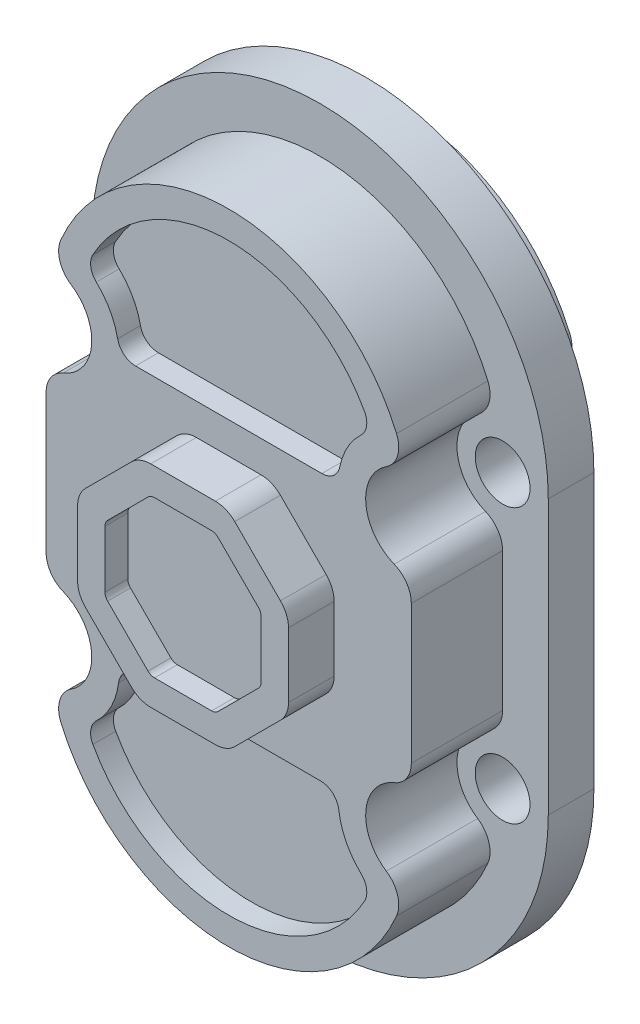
ISO-10303-21;
HEADER;
FILE_DESCRIPTION(('STEP AP214'),'2;1');
FILE_NAME('part.step','',(''),(''),'','','');
FILE_SCHEMA(('AUTOMOTIVE_DESIGN { 1 0 10303 214 1 1 1 1 }'));
ENDSEC;
DATA;
#1=APPLICATION_CONTEXT('core data for automotive mechanical design processes');
#2=APPLICATION_PROTOCOL_DEFINITION('international standard','automotive_design',2000,#1);
#3=PRODUCT_CONTEXT('',#1,'mechanical');
#4=PRODUCT('Part','Part','',(#3));
#5=PRODUCT_RELATED_PRODUCT_CATEGORY('part','',(#4));
#6=PRODUCT_DEFINITION_FORMATION('','',#4);
#7=PRODUCT_DEFINITION_CONTEXT('part definition',#1,'design');
#8=PRODUCT_DEFINITION('design','',#6,#7);
#9=PRODUCT_DEFINITION_SHAPE('','',#8);
#10=(LENGTH_UNIT() NAMED_UNIT(*) SI_UNIT(.MILLI.,.METRE.));
#11=(NAMED_UNIT(*) PLANE_ANGLE_UNIT() SI_UNIT($,.RADIAN.));
#12=(NAMED_UNIT(*) SI_UNIT($,.STERADIAN.) SOLID_ANGLE_UNIT());
#13=UNCERTAINTY_MEASURE_WITH_UNIT(LENGTH_MEASURE(1.E-05),#10,'distance_accuracy_value','');
#14=(GEOMETRIC_REPRESENTATION_CONTEXT(3) GLOBAL_UNCERTAINTY_ASSIGNED_CONTEXT((#13)) GLOBAL_UNIT_ASSIGNED_CONTEXT((#10,
#11,#12)) REPRESENTATION_CONTEXT('',''));
#15=CARTESIAN_POINT('',(0.,0.,0.));
#16=DIRECTION('',(0.,0.,1.));
#17=DIRECTION('',(1.,0.,0.));
#18=AXIS2_PLACEMENT_3D('',#15,#16,#17);
#19=CARTESIAN_POINT('',(40.,30.,25.));
#20=DIRECTION('',(0.,0.,1.));
#21=DIRECTION('',(1.,0.,0.));
#22=AXIS2_PLACEMENT_3D('',#19,#20,#21);
#23=PLANE('',#22);
#24=CARTESIAN_POINT('',(0.,30.,25.));
#25=DIRECTION('',(0.,0.,1.));
#26=DIRECTION('',(1.,0.,0.));
#27=AXIS2_PLACEMENT_3D('',#24,#25,#26);
#28=CIRCLE('',#27,34.);
#29=CARTESIAN_POINT('',(29.75,46.4601792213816,25.));
#30=VERTEX_POINT('',#29);
#31=CARTESIAN_POINT('',(-29.75,46.4601792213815,25.));
#32=VERTEX_POINT('',#31);
#33=EDGE_CURVE('E60',#30,#32,#28,.T.);
#34=ORIENTED_EDGE('',*,*,#33,.F.);
#35=CARTESIAN_POINT('',(26.25,44.5236875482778,25.));
#36=DIRECTION('',(0.,0.,1.));
#37=DIRECTION('',(1.,0.,0.));
#38=AXIS2_PLACEMENT_3D('',#35,#36,#37);
#39=CIRCLE('',#38,4.);
#40=CARTESIAN_POINT('',(29.,41.6189500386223,25.));
#41=VERTEX_POINT('',#40);
#42=EDGE_CURVE('E586',#41,#30,#39,.T.);
#43=ORIENTED_EDGE('',*,*,#42,.F.);
#44=CARTESIAN_POINT('',(40.,30.,25.));
#45=DIRECTION('',(0.,0.,-1.));
#46=DIRECTION('',(1.,0.,0.));
#47=AXIS2_PLACEMENT_3D('',#44,#45,#46);
#48=CIRCLE('',#47,16.);
#49=CARTESIAN_POINT('',(24.3232656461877,33.1999999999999,25.));
#50=VERTEX_POINT('',#49);
#51=EDGE_CURVE('E589',#50,#41,#48,.T.);
#52=ORIENTED_EDGE('',*,*,#51,.F.);
#53=CARTESIAN_POINT('',(20.4040820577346,33.9999999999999,25.));
#54=DIRECTION('',(0.,0.,1.));
#55=DIRECTION('',(1.,0.,0.));
#56=AXIS2_PLACEMENT_3D('',#53,#54,#55);
#57=CIRCLE('',#56,4.);
#58=CARTESIAN_POINT('',(20.4040820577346,29.9999999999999,25.));
#59=VERTEX_POINT('',#58);
#60=EDGE_CURVE('E621',#59,#50,#57,.T.);
#61=ORIENTED_EDGE('',*,*,#60,.F.);
#62=DIRECTION('',(1.,0.,0.));
#63=VECTOR('',#62,1.);
#64=CARTESIAN_POINT('',(-20.4040820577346,30.,25.));
#65=LINE('',#64,#63);
#66=CARTESIAN_POINT('',(-20.4040820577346,30.,25.));
#67=VERTEX_POINT('',#66);
#68=EDGE_CURVE('E618',#67,#59,#65,.T.);
#69=ORIENTED_EDGE('',*,*,#68,.F.);
#70=CARTESIAN_POINT('',(-20.4040820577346,34.,25.));
#71=DIRECTION('',(0.,0.,1.));
#72=DIRECTION('',(-1.,0.,0.));
#73=AXIS2_PLACEMENT_3D('',#70,#71,#72);
#74=CIRCLE('',#73,4.);
#75=CARTESIAN_POINT('',(-24.3232656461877,33.2,25.));
#76=VERTEX_POINT('',#75);
#77=EDGE_CURVE('E615',#76,#67,#74,.T.);
#78=ORIENTED_EDGE('',*,*,#77,.F.);
#79=CARTESIAN_POINT('',(-40.,30.,25.));
#80=DIRECTION('',(0.,0.,-1.));
#81=DIRECTION('',(1.,0.,0.));
#82=AXIS2_PLACEMENT_3D('',#79,#80,#81);
#83=CIRCLE('',#82,16.);
#84=CARTESIAN_POINT('',(-29.,41.6189500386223,25.));
#85=VERTEX_POINT('',#84);
#86=EDGE_CURVE('E612',#85,#76,#83,.T.);
#87=ORIENTED_EDGE('',*,*,#86,.F.);
#88=CARTESIAN_POINT('',(-26.25,44.5236875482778,25.));
#89=DIRECTION('',(0.,0.,1.));
#90=DIRECTION('',(1.,0.,0.));
#91=AXIS2_PLACEMENT_3D('',#88,#89,#90);
#92=CIRCLE('',#91,4.);
#93=EDGE_CURVE('E609',#32,#85,#92,.T.);
#94=ORIENTED_EDGE('',*,*,#93,.F.);
#95=EDGE_LOOP('',(#34,#43,#52,#61,#69,#78,#87,#94));
#96=FACE_BOUND('',#95,.T.);
#97=CARTESIAN_POINT('',(-40.,-30.,25.));
#98=DIRECTION('',(0.,0.,-1.));
#99=DIRECTION('',(1.,0.,0.));
#100=AXIS2_PLACEMENT_3D('',#97,#98,#99);
#101=CIRCLE('',#100,16.);
#102=CARTESIAN_POINT('',(-24.1203654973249,-31.9588792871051,25.));
#103=VERTEX_POINT('',#102);
#104=CARTESIAN_POINT('',(-29.,-41.6189500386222,25.));
#105=VERTEX_POINT('',#104);
#106=EDGE_CURVE('E68',#103,#105,#101,.T.);
#107=ORIENTED_EDGE('',*,*,#106,.F.);
#108=CARTESIAN_POINT('',(-20.1504568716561,-32.4485991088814,25.));
#109=DIRECTION('',(0.,0.,1.));
#110=DIRECTION('',(1.,0.,0.));
#111=AXIS2_PLACEMENT_3D('',#108,#109,#110);
#112=CIRCLE('',#111,4.);
#113=CARTESIAN_POINT('',(-20.1504568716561,-28.4485991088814,25.));
#114=VERTEX_POINT('',#113);
#115=EDGE_CURVE('E644',#114,#103,#112,.T.);
#116=ORIENTED_EDGE('',*,*,#115,.F.);
#117=DIRECTION('',(-1.,0.,0.));
#118=VECTOR('',#117,1.);
#119=CARTESIAN_POINT('',(-20.1504568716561,-28.4485991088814,25.));
#120=LINE('',#119,#118);
#121=CARTESIAN_POINT('',(20.1504568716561,-28.4485991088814,25.));
#122=VERTEX_POINT('',#121);
#123=EDGE_CURVE('E682',#122,#114,#120,.T.);
#124=ORIENTED_EDGE('',*,*,#123,.F.);
#125=CARTESIAN_POINT('',(20.1504568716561,-32.4485991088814,25.));
#126=DIRECTION('',(0.,0.,1.));
#127=DIRECTION('',(-1.,0.,0.));
#128=AXIS2_PLACEMENT_3D('',#125,#126,#127);
#129=CIRCLE('',#128,4.);
#130=CARTESIAN_POINT('',(24.1203654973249,-31.9588792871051,25.));
#131=VERTEX_POINT('',#130);
#132=EDGE_CURVE('E679',#131,#122,#129,.T.);
#133=ORIENTED_EDGE('',*,*,#132,.F.);
#134=CARTESIAN_POINT('',(40.,-30.,25.));
#135=DIRECTION('',(0.,0.,-1.));
#136=DIRECTION('',(1.,0.,0.));
#137=AXIS2_PLACEMENT_3D('',#134,#135,#136);
#138=CIRCLE('',#137,16.);
#139=CARTESIAN_POINT('',(29.,-41.6189500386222,25.));
#140=VERTEX_POINT('',#139);
#141=EDGE_CURVE('E676',#140,#131,#138,.T.);
#142=ORIENTED_EDGE('',*,*,#141,.F.);
#143=CARTESIAN_POINT('',(26.25,-44.5236875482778,25.));
#144=DIRECTION('',(0.,0.,1.));
#145=DIRECTION('',(1.,0.,0.));
#146=AXIS2_PLACEMENT_3D('',#143,#144,#145);
#147=CIRCLE('',#146,4.);
#148=CARTESIAN_POINT('',(29.75,-46.4601792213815,25.));
#149=VERTEX_POINT('',#148);
#150=EDGE_CURVE('E673',#149,#140,#147,.T.);
#151=ORIENTED_EDGE('',*,*,#150,.F.);
#152=CARTESIAN_POINT('',(0.,-30.,25.));
#153=DIRECTION('',(0.,0.,1.));
#154=DIRECTION('',(1.,0.,0.));
#155=AXIS2_PLACEMENT_3D('',#152,#153,#154);
#156=CIRCLE('',#155,34.);
#157=CARTESIAN_POINT('',(-29.75,-46.4601792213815,25.));
#158=VERTEX_POINT('',#157);
#159=EDGE_CURVE('E670',#158,#149,#156,.T.);
#160=ORIENTED_EDGE('',*,*,#159,.F.);
#161=CARTESIAN_POINT('',(-26.25,-44.5236875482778,25.));
#162=DIRECTION('',(0.,0.,1.));
#163=DIRECTION('',(1.,0.,0.));
#164=AXIS2_PLACEMENT_3D('',#161,#162,#163);
#165=CIRCLE('',#164,4.);
#166=EDGE_CURVE('E667',#105,#158,#165,.T.);
#167=ORIENTED_EDGE('',*,*,#166,.F.);
#168=EDGE_LOOP('',(#107,#116,#124,#133,#142,#151,#160,#167));
#169=FACE_BOUND('',#168,.T.);
#170=CARTESIAN_POINT('',(40.,30.,25.));
#171=DIRECTION('',(0.,0.,-1.));
#172=DIRECTION('',(1.,0.,0.));
#173=AXIS2_PLACEMENT_3D('',#170,#171,#172);
#174=CIRCLE('',#173,10.);
#175=CARTESIAN_POINT('',(36.25,20.7297518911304,25.));
#176=VERTEX_POINT('',#175);
#177=CARTESIAN_POINT('',(34.53125,38.3721427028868,25.));
#178=VERTEX_POINT('',#177);
#179=EDGE_CURVE('E1109',#176,#178,#174,.T.);
#180=ORIENTED_EDGE('',*,*,#179,.T.);
#181=CARTESIAN_POINT('',(31.25,43.3954283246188,25.));
#182=DIRECTION('',(0.,0.,1.));
#183=DIRECTION('',(1.,0.,0.));
#184=AXIS2_PLACEMENT_3D('',#181,#182,#183);
#185=CIRCLE('',#184,6.);
#186=CARTESIAN_POINT('',(36.764705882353,45.7593274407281,25.));
#187=VERTEX_POINT('',#186);
#188=EDGE_CURVE('E1112',#178,#187,#185,.T.);
#189=ORIENTED_EDGE('',*,*,#188,.T.);
#190=CARTESIAN_POINT('',(0.,30.,25.));
#191=DIRECTION('',(0.,0.,1.));
#192=DIRECTION('',(1.,0.,0.));
#193=AXIS2_PLACEMENT_3D('',#190,#191,#192);
#194=CIRCLE('',#193,40.);
#195=CARTESIAN_POINT('',(-36.764705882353,45.759327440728,25.));
#196=VERTEX_POINT('',#195);
#197=EDGE_CURVE('E1115',#187,#196,#194,.T.);
#198=ORIENTED_EDGE('',*,*,#197,.T.);
#199=CARTESIAN_POINT('',(-31.25,43.3954283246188,25.));
#200=DIRECTION('',(0.,0.,1.));
#201=DIRECTION('',(-1.,0.,0.));
#202=AXIS2_PLACEMENT_3D('',#199,#200,#201);
#203=CIRCLE('',#202,6.);
#204=CARTESIAN_POINT('',(-34.53125,38.3721427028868,25.));
#205=VERTEX_POINT('',#204);
#206=EDGE_CURVE('E1117',#196,#205,#203,.T.);
#207=ORIENTED_EDGE('',*,*,#206,.T.);
#208=CARTESIAN_POINT('',(-40.,30.,25.));
#209=DIRECTION('',(0.,0.,-1.));
#210=DIRECTION('',(1.,0.,0.));
#211=AXIS2_PLACEMENT_3D('',#208,#209,#210);
#212=CIRCLE('',#211,10.);
#213=CARTESIAN_POINT('',(-36.25,20.7297518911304,25.));
#214=VERTEX_POINT('',#213);
#215=EDGE_CURVE('E1119',#205,#214,#212,.T.);
#216=ORIENTED_EDGE('',*,*,#215,.T.);
#217=CARTESIAN_POINT('',(-34.,15.1676030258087,25.));
#218=DIRECTION('',(0.,0.,1.));
#219=DIRECTION('',(1.,0.,0.));
#220=AXIS2_PLACEMENT_3D('',#217,#218,#219);
#221=CIRCLE('',#220,6.);
#222=CARTESIAN_POINT('',(-40.,15.1676030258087,25.));
#223=VERTEX_POINT('',#222);
#224=EDGE_CURVE('E1121',#214,#223,#221,.T.);
#225=ORIENTED_EDGE('',*,*,#224,.T.);
#226=DIRECTION('',(0.,-1.,0.));
#227=VECTOR('',#226,1.);
#228=CARTESIAN_POINT('',(-40.,15.1676030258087,25.));
#229=LINE('',#228,#227);
#230=CARTESIAN_POINT('',(-40.,-15.1676030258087,25.));
#231=VERTEX_POINT('',#230);
#232=EDGE_CURVE('E1123',#223,#231,#229,.T.);
#233=ORIENTED_EDGE('',*,*,#232,.T.);
#234=CARTESIAN_POINT('',(-34.,-15.1676030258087,25.));
#235=DIRECTION('',(0.,0.,1.));
#236=DIRECTION('',(-1.,0.,0.));
#237=AXIS2_PLACEMENT_3D('',#234,#235,#236);
#238=CIRCLE('',#237,6.);
#239=CARTESIAN_POINT('',(-36.25,-20.7297518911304,25.));
#240=VERTEX_POINT('',#239);
#241=EDGE_CURVE('E1125',#231,#240,#238,.T.);
#242=ORIENTED_EDGE('',*,*,#241,.T.);
#243=CARTESIAN_POINT('',(-40.,-30.,25.));
#244=DIRECTION('',(0.,0.,-1.));
#245=DIRECTION('',(1.,0.,0.));
#246=AXIS2_PLACEMENT_3D('',#243,#244,#245);
#247=CIRCLE('',#246,10.);
#248=CARTESIAN_POINT('',(-34.53125,-38.3721427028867,25.));
#249=VERTEX_POINT('',#248);
#250=EDGE_CURVE('E1127',#240,#249,#247,.T.);
#251=ORIENTED_EDGE('',*,*,#250,.T.);
#252=CARTESIAN_POINT('',(-31.25,-43.3954283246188,25.));
#253=DIRECTION('',(0.,0.,1.));
#254=DIRECTION('',(1.,0.,0.));
#255=AXIS2_PLACEMENT_3D('',#252,#253,#254);
#256=CIRCLE('',#255,6.);
#257=CARTESIAN_POINT('',(-36.7647058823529,-45.759327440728,25.));
#258=VERTEX_POINT('',#257);
#259=EDGE_CURVE('E1129',#249,#258,#256,.T.);
#260=ORIENTED_EDGE('',*,*,#259,.T.);
#261=CARTESIAN_POINT('',(0.,-30.,25.));
#262=DIRECTION('',(0.,0.,1.));
#263=DIRECTION('',(1.,0.,0.));
#264=AXIS2_PLACEMENT_3D('',#261,#262,#263);
#265=CIRCLE('',#264,40.);
#266=CARTESIAN_POINT('',(36.7647058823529,-45.759327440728,25.));
#267=VERTEX_POINT('',#266);
#268=EDGE_CURVE('E1131',#258,#267,#265,.T.);
#269=ORIENTED_EDGE('',*,*,#268,.T.);
#270=CARTESIAN_POINT('',(31.25,-43.3954283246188,25.));
#271=DIRECTION('',(0.,0.,1.));
#272=DIRECTION('',(-1.,0.,0.));
#273=AXIS2_PLACEMENT_3D('',#270,#271,#272);
#274=CIRCLE('',#273,6.);
#275=CARTESIAN_POINT('',(34.53125,-38.3721427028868,25.));
#276=VERTEX_POINT('',#275);
#277=EDGE_CURVE('E1133',#267,#276,#274,.T.);
#278=ORIENTED_EDGE('',*,*,#277,.T.);
#279=CARTESIAN_POINT('',(40.,-30.,25.));
#280=DIRECTION('',(0.,0.,-1.));
#281=DIRECTION('',(1.,0.,0.));
#282=AXIS2_PLACEMENT_3D('',#279,#280,#281);
#283=CIRCLE('',#282,10.);
#284=CARTESIAN_POINT('',(36.25,-20.7297518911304,25.));
#285=VERTEX_POINT('',#284);
#286=EDGE_CURVE('E1135',#276,#285,#283,.T.);
#287=ORIENTED_EDGE('',*,*,#286,.T.);
#288=CARTESIAN_POINT('',(34.,-15.1676030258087,25.));
#289=DIRECTION('',(0.,0.,1.));
#290=DIRECTION('',(1.,0.,0.));
#291=AXIS2_PLACEMENT_3D('',#288,#289,#290);
#292=CIRCLE('',#291,6.);
#293=CARTESIAN_POINT('',(40.,-15.1676030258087,25.));
#294=VERTEX_POINT('',#293);
#295=EDGE_CURVE('E1137',#285,#294,#292,.T.);
#296=ORIENTED_EDGE('',*,*,#295,.T.);
#297=DIRECTION('',(0.,1.,0.));
#298=VECTOR('',#297,1.);
#299=CARTESIAN_POINT('',(40.,-15.1676030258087,25.));
#300=LINE('',#299,#298);
#301=CARTESIAN_POINT('',(40.,15.1676030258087,25.));
#302=VERTEX_POINT('',#301);
#303=EDGE_CURVE('E1139',#294,#302,#300,.T.);
#304=ORIENTED_EDGE('',*,*,#303,.T.);
#305=CARTESIAN_POINT('',(34.,15.1676030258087,25.));
#306=DIRECTION('',(0.,0.,1.));
#307=DIRECTION('',(-1.,0.,0.));
#308=AXIS2_PLACEMENT_3D('',#305,#306,#307);
#309=CIRCLE('',#308,6.);
#310=EDGE_CURVE('E1141',#302,#176,#309,.T.);
#311=ORIENTED_EDGE('',*,*,#310,.T.);
#312=EDGE_LOOP('',(#180,#189,#198,#207,#216,#225,#233,#242,#251,#260,#269,#278,#287,#296,#304,#311));
#313=FACE_BOUND('',#312,.T.);
#314=DIRECTION('',(0.707106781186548,-0.707106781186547,0.));
#315=VECTOR('',#314,1.);
#316=CARTESIAN_POINT('',(-21.3396289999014,-11.324445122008,25.));
#317=LINE('',#316,#315);
#318=CARTESIAN_POINT('',(-21.3396289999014,-11.324445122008,25.));
#319=VERTEX_POINT('',#318);
#320=CARTESIAN_POINT('',(-11.324445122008,-21.3396289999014,25.));
#321=VERTEX_POINT('',#320);
#322=EDGE_CURVE('E1270',#319,#321,#317,.T.);
#323=ORIENTED_EDGE('',*,*,#322,.F.);
#324=CARTESIAN_POINT('',(-17.0969883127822,-7.08180443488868,25.));
#325=DIRECTION('',(0.,0.,1.));
#326=DIRECTION('',(1.,0.,0.));
#327=AXIS2_PLACEMENT_3D('',#324,#325,#326);
#328=CIRCLE('',#327,6.);
#329=CARTESIAN_POINT('',(-23.0969883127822,-7.08180443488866,25.));
#330=VERTEX_POINT('',#329);
#331=EDGE_CURVE('E798',#330,#319,#328,.T.);
#332=ORIENTED_EDGE('',*,*,#331,.F.);
#333=DIRECTION('',(0.,-1.,0.));
#334=VECTOR('',#333,1.);
#335=CARTESIAN_POINT('',(-23.0969883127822,7.08180443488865,25.));
#336=LINE('',#335,#334);
#337=CARTESIAN_POINT('',(-23.0969883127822,7.08180443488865,25.));
#338=VERTEX_POINT('',#337);
#339=EDGE_CURVE('E833',#338,#330,#336,.T.);
#340=ORIENTED_EDGE('',*,*,#339,.F.);
#341=CARTESIAN_POINT('',(-17.0969883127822,7.08180443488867,25.));
#342=DIRECTION('',(0.,0.,1.));
#343=DIRECTION('',(1.,0.,0.));
#344=AXIS2_PLACEMENT_3D('',#341,#342,#343);
#345=CIRCLE('',#344,6.);
#346=CARTESIAN_POINT('',(-21.3396289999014,11.324445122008,25.));
#347=VERTEX_POINT('',#346);
#348=EDGE_CURVE('E1305',#347,#338,#345,.T.);
#349=ORIENTED_EDGE('',*,*,#348,.F.);
#350=DIRECTION('',(-0.707106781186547,-0.707106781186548,0.));
#351=VECTOR('',#350,1.);
#352=CARTESIAN_POINT('',(-11.324445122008,21.3396289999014,25.));
#353=LINE('',#352,#351);
#354=CARTESIAN_POINT('',(-11.324445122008,21.3396289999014,25.));
#355=VERTEX_POINT('',#354);
#356=EDGE_CURVE('E1303',#355,#347,#353,.T.);
#357=ORIENTED_EDGE('',*,*,#356,.F.);
#358=CARTESIAN_POINT('',(-7.08180443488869,17.0969883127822,25.));
#359=DIRECTION('',(0.,0.,1.));
#360=DIRECTION('',(1.,0.,0.));
#361=AXIS2_PLACEMENT_3D('',#358,#359,#360);
#362=CIRCLE('',#361,6.);
#363=CARTESIAN_POINT('',(-7.08180443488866,23.0969883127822,25.));
#364=VERTEX_POINT('',#363);
#365=EDGE_CURVE('E1301',#364,#355,#362,.T.);
#366=ORIENTED_EDGE('',*,*,#365,.F.);
#367=DIRECTION('',(-1.,0.,0.));
#368=VECTOR('',#367,1.);
#369=CARTESIAN_POINT('',(7.08180443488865,23.0969883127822,25.));
#370=LINE('',#369,#368);
#371=CARTESIAN_POINT('',(7.08180443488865,23.0969883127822,25.));
#372=VERTEX_POINT('',#371);
#373=EDGE_CURVE('E1299',#372,#364,#370,.T.);
#374=ORIENTED_EDGE('',*,*,#373,.F.);
#375=CARTESIAN_POINT('',(7.08180443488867,17.0969883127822,25.));
#376=DIRECTION('',(0.,0.,1.));
#377=DIRECTION('',(-1.,0.,0.));
#378=AXIS2_PLACEMENT_3D('',#375,#376,#377);
#379=CIRCLE('',#378,6.);
#380=CARTESIAN_POINT('',(11.324445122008,21.3396289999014,25.));
#381=VERTEX_POINT('',#380);
#382=EDGE_CURVE('E1297',#381,#372,#379,.T.);
#383=ORIENTED_EDGE('',*,*,#382,.F.);
#384=DIRECTION('',(-0.707106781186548,0.707106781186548,0.));
#385=VECTOR('',#384,1.);
#386=CARTESIAN_POINT('',(21.3396289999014,11.324445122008,25.));
#387=LINE('',#386,#385);
#388=CARTESIAN_POINT('',(21.3396289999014,11.324445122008,25.));
#389=VERTEX_POINT('',#388);
#390=EDGE_CURVE('E1295',#389,#381,#387,.T.);
#391=ORIENTED_EDGE('',*,*,#390,.F.);
#392=CARTESIAN_POINT('',(17.0969883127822,7.08180443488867,25.));
#393=DIRECTION('',(0.,0.,1.));
#394=DIRECTION('',(1.,0.,0.));
#395=AXIS2_PLACEMENT_3D('',#392,#393,#394);
#396=CIRCLE('',#395,6.);
#397=CARTESIAN_POINT('',(23.0969883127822,7.08180443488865,25.));
#398=VERTEX_POINT('',#397);
#399=EDGE_CURVE('E1293',#398,#389,#396,.T.);
#400=ORIENTED_EDGE('',*,*,#399,.F.);
#401=DIRECTION('',(0.,1.,0.));
#402=VECTOR('',#401,1.);
#403=CARTESIAN_POINT('',(23.0969883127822,-7.08180443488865,25.));
#404=LINE('',#403,#402);
#405=CARTESIAN_POINT('',(23.0969883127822,-7.08180443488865,25.));
#406=VERTEX_POINT('',#405);
#407=EDGE_CURVE('E1291',#406,#398,#404,.T.);
#408=ORIENTED_EDGE('',*,*,#407,.F.);
#409=CARTESIAN_POINT('',(17.0969883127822,-7.08180443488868,25.));
#410=DIRECTION('',(0.,0.,1.));
#411=DIRECTION('',(1.,0.,0.));
#412=AXIS2_PLACEMENT_3D('',#409,#410,#411);
#413=CIRCLE('',#412,6.);
#414=CARTESIAN_POINT('',(21.3396289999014,-11.324445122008,25.));
#415=VERTEX_POINT('',#414);
#416=EDGE_CURVE('E1289',#415,#406,#413,.T.);
#417=ORIENTED_EDGE('',*,*,#416,.F.);
#418=DIRECTION('',(0.707106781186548,0.707106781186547,0.));
#419=VECTOR('',#418,1.);
#420=CARTESIAN_POINT('',(11.324445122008,-21.3396289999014,25.));
#421=LINE('',#420,#419);
#422=CARTESIAN_POINT('',(11.324445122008,-21.3396289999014,25.));
#423=VERTEX_POINT('',#422);
#424=EDGE_CURVE('E1287',#423,#415,#421,.T.);
#425=ORIENTED_EDGE('',*,*,#424,.F.);
#426=CARTESIAN_POINT('',(7.08180443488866,-17.0969883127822,25.));
#427=DIRECTION('',(0.,0.,1.));
#428=DIRECTION('',(1.,0.,0.));
#429=AXIS2_PLACEMENT_3D('',#426,#427,#428);
#430=CIRCLE('',#429,6.);
#431=CARTESIAN_POINT('',(7.08180443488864,-23.0969883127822,25.));
#432=VERTEX_POINT('',#431);
#433=EDGE_CURVE('E1285',#432,#423,#430,.T.);
#434=ORIENTED_EDGE('',*,*,#433,.F.);
#435=DIRECTION('',(1.,0.,0.));
#436=VECTOR('',#435,1.);
#437=CARTESIAN_POINT('',(-7.08180443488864,-23.0969883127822,25.));
#438=LINE('',#437,#436);
#439=CARTESIAN_POINT('',(-7.08180443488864,-23.0969883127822,25.));
#440=VERTEX_POINT('',#439);
#441=EDGE_CURVE('E1279',#440,#432,#438,.T.);
#442=ORIENTED_EDGE('',*,*,#441,.F.);
#443=CARTESIAN_POINT('',(-7.08180443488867,-17.0969883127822,25.));
#444=DIRECTION('',(0.,0.,1.));
#445=DIRECTION('',(1.,0.,0.));
#446=AXIS2_PLACEMENT_3D('',#443,#444,#445);
#447=CIRCLE('',#446,6.);
#448=EDGE_CURVE('E1274',#321,#440,#447,.T.);
#449=ORIENTED_EDGE('',*,*,#448,.F.);
#450=EDGE_LOOP('',(#323,#332,#340,#349,#357,#366,#374,#383,#391,#400,#408,#417,#425,#434,#442,#449));
#451=FACE_BOUND('',#450,.T.);
#452=ADVANCED_FACE('F43',(#96,#169,#313,#451),#23,.T.);
#453=CARTESIAN_POINT('',(0.,-30.,-5.));
#454=DIRECTION('',(0.,0.,1.));
#455=DIRECTION('',(1.,0.,0.));
#456=AXIS2_PLACEMENT_3D('',#453,#454,#455);
#457=PLANE('',#456);
#458=CARTESIAN_POINT('',(-40.,30.,-5.));
#459=DIRECTION('',(0.,0.,1.));
#460=DIRECTION('',(1.,0.,0.));
#461=AXIS2_PLACEMENT_3D('',#458,#459,#460);
#462=CIRCLE('',#461,6.);
#463=CARTESIAN_POINT('',(-34.,30.,-5.));
#464=VERTEX_POINT('',#463);
#465=EDGE_CURVE('E47',#464,#464,#462,.T.);
#466=ORIENTED_EDGE('',*,*,#465,.T.);
#467=EDGE_LOOP('',(#466));
#468=FACE_BOUND('',#467,.T.);
#469=CARTESIAN_POINT('',(-40.,-30.,-5.));
#470=DIRECTION('',(0.,0.,1.));
#471=DIRECTION('',(1.,0.,0.));
#472=AXIS2_PLACEMENT_3D('',#469,#470,#471);
#473=CIRCLE('',#472,6.);
#474=CARTESIAN_POINT('',(-34.,-30.,-5.));
#475=VERTEX_POINT('',#474);
#476=EDGE_CURVE('E900',#475,#475,#473,.T.);
#477=ORIENTED_EDGE('',*,*,#476,.T.);
#478=EDGE_LOOP('',(#477));
#479=FACE_BOUND('',#478,.T.);
#480=CARTESIAN_POINT('',(40.,-30.,-5.));
#481=DIRECTION('',(0.,0.,1.));
#482=DIRECTION('',(1.,0.,0.));
#483=AXIS2_PLACEMENT_3D('',#480,#481,#482);
#484=CIRCLE('',#483,6.);
#485=CARTESIAN_POINT('',(46.,-30.,-5.));
#486=VERTEX_POINT('',#485);
#487=EDGE_CURVE('E892',#486,#486,#484,.T.);
#488=ORIENTED_EDGE('',*,*,#487,.T.);
#489=EDGE_LOOP('',(#488));
#490=FACE_BOUND('',#489,.T.);
#491=CARTESIAN_POINT('',(40.,30.,-5.));
#492=DIRECTION('',(0.,0.,1.));
#493=DIRECTION('',(1.,0.,0.));
#494=AXIS2_PLACEMENT_3D('',#491,#492,#493);
#495=CIRCLE('',#494,6.);
#496=CARTESIAN_POINT('',(46.,30.,-5.));
#497=VERTEX_POINT('',#496);
#498=EDGE_CURVE('E592',#497,#497,#495,.T.);
#499=ORIENTED_EDGE('',*,*,#498,.T.);
#500=EDGE_LOOP('',(#499));
#501=FACE_BOUND('',#500,.T.);
#502=CARTESIAN_POINT('',(0.,-30.,-5.));
#503=DIRECTION('',(0.,0.,1.));
#504=DIRECTION('',(1.,0.,0.));
#505=AXIS2_PLACEMENT_3D('',#502,#503,#504);
#506=CIRCLE('',#505,50.);
#507=CARTESIAN_POINT('',(-50.,-30.,-5.));
#508=VERTEX_POINT('',#507);
#509=CARTESIAN_POINT('',(50.,-30.,-5.));
#510=VERTEX_POINT('',#509);
#511=EDGE_CURVE('E873',#508,#510,#506,.T.);
#512=ORIENTED_EDGE('',*,*,#511,.F.);
#513=DIRECTION('',(0.,-1.,0.));
#514=VECTOR('',#513,1.);
#515=CARTESIAN_POINT('',(-50.,-30.,-5.));
#516=LINE('',#515,#514);
#517=CARTESIAN_POINT('',(-50.,30.,-5.));
#518=VERTEX_POINT('',#517);
#519=EDGE_CURVE('E885',#518,#508,#516,.T.);
#520=ORIENTED_EDGE('',*,*,#519,.F.);
#521=CARTESIAN_POINT('',(0.,30.,-5.));
#522=DIRECTION('',(0.,0.,1.));
#523=DIRECTION('',(1.,0.,0.));
#524=AXIS2_PLACEMENT_3D('',#521,#522,#523);
#525=CIRCLE('',#524,50.);
#526=CARTESIAN_POINT('',(50.,30.,-5.));
#527=VERTEX_POINT('',#526);
#528=EDGE_CURVE('E882',#527,#518,#525,.T.);
#529=ORIENTED_EDGE('',*,*,#528,.F.);
#530=DIRECTION('',(0.,1.,0.));
#531=VECTOR('',#530,1.);
#532=CARTESIAN_POINT('',(50.,-30.,-5.));
#533=LINE('',#532,#531);
#534=EDGE_CURVE('E879',#510,#527,#533,.T.);
#535=ORIENTED_EDGE('',*,*,#534,.F.);
#536=EDGE_LOOP('',(#512,#520,#529,#535));
#537=FACE_BOUND('',#536,.T.);
#538=CARTESIAN_POINT('',(34.,15.1676030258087,-5.));
#539=DIRECTION('',(0.,0.,-1.));
#540=DIRECTION('',(-1.,0.,0.));
#541=AXIS2_PLACEMENT_3D('',#538,#539,#540);
#542=CIRCLE('',#541,5.94999999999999);
#543=CARTESIAN_POINT('',(36.23125,20.6834006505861,-5.));
#544=VERTEX_POINT('',#543);
#545=CARTESIAN_POINT('',(39.95,15.1676030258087,-5.));
#546=VERTEX_POINT('',#545);
#547=EDGE_CURVE('E1035',#544,#546,#542,.T.);
#548=ORIENTED_EDGE('',*,*,#547,.F.);
#549=CARTESIAN_POINT('',(40.,30.,-5.));
#550=DIRECTION('',(0.,0.,1.));
#551=DIRECTION('',(-1.,0.,0.));
#552=AXIS2_PLACEMENT_3D('',#549,#550,#551);
#553=CIRCLE('',#552,10.05);
#554=CARTESIAN_POINT('',(34.50390625,38.4140034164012,-5.));
#555=VERTEX_POINT('',#554);
#556=EDGE_CURVE('E1037',#555,#544,#553,.T.);
#557=ORIENTED_EDGE('',*,*,#556,.F.);
#558=CARTESIAN_POINT('',(31.25,43.3954283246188,-5.));
#559=DIRECTION('',(0.,0.,-1.));
#560=DIRECTION('',(-1.,0.,0.));
#561=AXIS2_PLACEMENT_3D('',#558,#559,#560);
#562=CIRCLE('',#561,5.95);
#563=CARTESIAN_POINT('',(36.71875,45.7396282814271,-5.));
#564=VERTEX_POINT('',#563);
#565=EDGE_CURVE('E1057',#564,#555,#562,.T.);
#566=ORIENTED_EDGE('',*,*,#565,.F.);
#567=CARTESIAN_POINT('',(0.,30.,-5.));
#568=DIRECTION('',(0.,0.,-1.));
#569=DIRECTION('',(-1.,0.,0.));
#570=AXIS2_PLACEMENT_3D('',#567,#568,#569);
#571=CIRCLE('',#570,39.95);
#572=CARTESIAN_POINT('',(-36.71875,45.7396282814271,-5.));
#573=VERTEX_POINT('',#572);
#574=EDGE_CURVE('E1416',#573,#564,#571,.T.);
#575=ORIENTED_EDGE('',*,*,#574,.F.);
#576=CARTESIAN_POINT('',(-31.25,43.3954283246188,-5.));
#577=DIRECTION('',(0.,0.,-1.));
#578=DIRECTION('',(-1.,0.,0.));
#579=AXIS2_PLACEMENT_3D('',#576,#577,#578);
#580=CIRCLE('',#579,5.95);
#581=CARTESIAN_POINT('',(-34.50390625,38.4140034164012,-5.));
#582=VERTEX_POINT('',#581);
#583=EDGE_CURVE('E1413',#582,#573,#580,.T.);
#584=ORIENTED_EDGE('',*,*,#583,.F.);
#585=CARTESIAN_POINT('',(-40.,30.,-5.));
#586=DIRECTION('',(0.,0.,1.));
#587=DIRECTION('',(-1.,0.,0.));
#588=AXIS2_PLACEMENT_3D('',#585,#586,#587);
#589=CIRCLE('',#588,10.05);
#590=CARTESIAN_POINT('',(-36.23125,20.6834006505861,-5.));
#591=VERTEX_POINT('',#590);
#592=EDGE_CURVE('E1410',#591,#582,#589,.T.);
#593=ORIENTED_EDGE('',*,*,#592,.F.);
#594=CARTESIAN_POINT('',(-34.,15.1676030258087,-5.));
#595=DIRECTION('',(0.,0.,-1.));
#596=DIRECTION('',(-1.,0.,0.));
#597=AXIS2_PLACEMENT_3D('',#594,#595,#596);
#598=CIRCLE('',#597,5.95);
#599=CARTESIAN_POINT('',(-39.95,15.1676030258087,-5.));
#600=VERTEX_POINT('',#599);
#601=EDGE_CURVE('E1407',#600,#591,#598,.T.);
#602=ORIENTED_EDGE('',*,*,#601,.F.);
#603=DIRECTION('',(0.,1.,0.));
#604=VECTOR('',#603,1.);
#605=CARTESIAN_POINT('',(-39.95,-15.1676030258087,-5.));
#606=LINE('',#605,#604);
#607=CARTESIAN_POINT('',(-39.95,-15.1676030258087,-5.));
#608=VERTEX_POINT('',#607);
#609=EDGE_CURVE('E1404',#608,#600,#606,.T.);
#610=ORIENTED_EDGE('',*,*,#609,.F.);
#611=CARTESIAN_POINT('',(-34.,-15.1676030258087,-5.));
#612=DIRECTION('',(0.,0.,-1.));
#613=DIRECTION('',(-1.,0.,0.));
#614=AXIS2_PLACEMENT_3D('',#611,#612,#613);
#615=CIRCLE('',#614,5.95);
#616=CARTESIAN_POINT('',(-36.23125,-20.6834006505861,-5.));
#617=VERTEX_POINT('',#616);
#618=EDGE_CURVE('E1401',#617,#608,#615,.T.);
#619=ORIENTED_EDGE('',*,*,#618,.F.);
#620=CARTESIAN_POINT('',(-40.,-30.,-5.));
#621=DIRECTION('',(0.,0.,1.));
#622=DIRECTION('',(-1.,0.,0.));
#623=AXIS2_PLACEMENT_3D('',#620,#621,#622);
#624=CIRCLE('',#623,10.05);
#625=CARTESIAN_POINT('',(-34.50390625,-38.4140034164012,-5.));
#626=VERTEX_POINT('',#625);
#627=EDGE_CURVE('E1398',#626,#617,#624,.T.);
#628=ORIENTED_EDGE('',*,*,#627,.F.);
#629=CARTESIAN_POINT('',(-31.25,-43.3954283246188,-5.));
#630=DIRECTION('',(0.,0.,-1.));
#631=DIRECTION('',(-1.,0.,0.));
#632=AXIS2_PLACEMENT_3D('',#629,#630,#631);
#633=CIRCLE('',#632,5.95);
#634=CARTESIAN_POINT('',(-36.71875,-45.7396282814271,-5.));
#635=VERTEX_POINT('',#634);
#636=EDGE_CURVE('E1395',#635,#626,#633,.T.);
#637=ORIENTED_EDGE('',*,*,#636,.F.);
#638=CARTESIAN_POINT('',(0.,-30.,-5.));
#639=DIRECTION('',(0.,0.,-1.));
#640=DIRECTION('',(-1.,0.,0.));
#641=AXIS2_PLACEMENT_3D('',#638,#639,#640);
#642=CIRCLE('',#641,39.95);
#643=CARTESIAN_POINT('',(36.71875,-45.7396282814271,-5.));
#644=VERTEX_POINT('',#643);
#645=EDGE_CURVE('E1392',#644,#635,#642,.T.);
#646=ORIENTED_EDGE('',*,*,#645,.F.);
#647=CARTESIAN_POINT('',(31.25,-43.3954283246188,-5.));
#648=DIRECTION('',(0.,0.,-1.));
#649=DIRECTION('',(-1.,0.,0.));
#650=AXIS2_PLACEMENT_3D('',#647,#648,#649);
#651=CIRCLE('',#650,5.95);
#652=CARTESIAN_POINT('',(34.50390625,-38.4140034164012,-5.));
#653=VERTEX_POINT('',#652);
#654=EDGE_CURVE('E1389',#653,#644,#651,.T.);
#655=ORIENTED_EDGE('',*,*,#654,.F.);
#656=CARTESIAN_POINT('',(40.,-30.,-5.));
#657=DIRECTION('',(0.,0.,1.));
#658=DIRECTION('',(-1.,0.,0.));
#659=AXIS2_PLACEMENT_3D('',#656,#657,#658);
#660=CIRCLE('',#659,10.05);
#661=CARTESIAN_POINT('',(36.23125,-20.6834006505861,-5.));
#662=VERTEX_POINT('',#661);
#663=EDGE_CURVE('E1386',#662,#653,#660,.T.);
#664=ORIENTED_EDGE('',*,*,#663,.F.);
#665=CARTESIAN_POINT('',(34.,-15.1676030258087,-5.));
#666=DIRECTION('',(0.,0.,-1.));
#667=DIRECTION('',(-1.,0.,0.));
#668=AXIS2_PLACEMENT_3D('',#665,#666,#667);
#669=CIRCLE('',#668,5.95);
#670=CARTESIAN_POINT('',(39.95,-15.1676030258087,-5.));
#671=VERTEX_POINT('',#670);
#672=EDGE_CURVE('E1383',#671,#662,#669,.T.);
#673=ORIENTED_EDGE('',*,*,#672,.F.);
#674=DIRECTION('',(0.,-1.,0.));
#675=VECTOR('',#674,1.);
#676=CARTESIAN_POINT('',(39.95,15.1676030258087,-5.));
#677=LINE('',#676,#675);
#678=EDGE_CURVE('E1040',#546,#671,#677,.T.);
#679=ORIENTED_EDGE('',*,*,#678,.F.);
#680=EDGE_LOOP('',(#548,#557,#566,#575,#584,#593,#602,#610,#619,#628,#637,#646,#655,#664,#673,#679));
#681=FACE_BOUND('',#680,.T.);
#682=ADVANCED_FACE('F917',(#468,#479,#490,#501,#537,#681),#457,.F.);
#683=CARTESIAN_POINT('',(0.,-30.,-5.));
#684=DIRECTION('',(0.,0.,1.));
#685=DIRECTION('',(1.,0.,0.));
#686=AXIS2_PLACEMENT_3D('',#683,#684,#685);
#687=CYLINDRICAL_SURFACE('',#686,50.);
#688=DIRECTION('',(0.,0.,1.));
#689=VECTOR('',#688,1.);
#690=CARTESIAN_POINT('',(50.,-30.,-5.));
#691=LINE('',#690,#689);
#692=CARTESIAN_POINT('',(50.,-30.,5.));
#693=VERTEX_POINT('',#692);
#694=EDGE_CURVE('E887',#510,#693,#691,.T.);
#695=ORIENTED_EDGE('',*,*,#694,.T.);
#696=CARTESIAN_POINT('',(0.,-30.,5.));
#697=DIRECTION('',(0.,0.,1.));
#698=DIRECTION('',(1.,0.,0.));
#699=AXIS2_PLACEMENT_3D('',#696,#697,#698);
#700=CIRCLE('',#699,50.);
#701=CARTESIAN_POINT('',(-50.,-30.,5.));
#702=VERTEX_POINT('',#701);
#703=EDGE_CURVE('E856',#702,#693,#700,.T.);
#704=ORIENTED_EDGE('',*,*,#703,.F.);
#705=DIRECTION('',(0.,0.,1.));
#706=VECTOR('',#705,1.);
#707=CARTESIAN_POINT('',(-50.,-30.,-5.));
#708=LINE('',#707,#706);
#709=EDGE_CURVE('E12',#508,#702,#708,.T.);
#710=ORIENTED_EDGE('',*,*,#709,.F.);
#711=ORIENTED_EDGE('',*,*,#511,.T.);
#712=EDGE_LOOP('',(#695,#704,#710,#711));
#713=FACE_BOUND('',#712,.T.);
#714=ADVANCED_FACE('F45',(#713),#687,.T.);
#715=CARTESIAN_POINT('',(-50.,-30.,-5.));
#716=DIRECTION('',(-1.,0.,0.));
#717=DIRECTION('',(0.,-1.,0.));
#718=AXIS2_PLACEMENT_3D('',#715,#716,#717);
#719=PLANE('',#718);
#720=ORIENTED_EDGE('',*,*,#709,.T.);
#721=DIRECTION('',(0.,-1.,0.));
#722=VECTOR('',#721,1.);
#723=CARTESIAN_POINT('',(-50.,-30.,5.));
#724=LINE('',#723,#722);
#725=CARTESIAN_POINT('',(-50.,30.,5.));
#726=VERTEX_POINT('',#725);
#727=EDGE_CURVE('E869',#726,#702,#724,.T.);
#728=ORIENTED_EDGE('',*,*,#727,.F.);
#729=DIRECTION('',(0.,0.,1.));
#730=VECTOR('',#729,1.);
#731=CARTESIAN_POINT('',(-50.,30.,-5.));
#732=LINE('',#731,#730);
#733=EDGE_CURVE('E52',#518,#726,#732,.T.);
#734=ORIENTED_EDGE('',*,*,#733,.F.);
#735=ORIENTED_EDGE('',*,*,#519,.T.);
#736=EDGE_LOOP('',(#720,#728,#734,#735));
#737=FACE_BOUND('',#736,.T.);
#738=ADVANCED_FACE('F1011',(#737),#719,.T.);
#739=CARTESIAN_POINT('',(0.,30.,-5.));
#740=DIRECTION('',(0.,0.,1.));
#741=DIRECTION('',(1.,0.,0.));
#742=AXIS2_PLACEMENT_3D('',#739,#740,#741);
#743=CYLINDRICAL_SURFACE('',#742,50.);
#744=ORIENTED_EDGE('',*,*,#733,.T.);
#745=CARTESIAN_POINT('',(0.,30.,5.));
#746=DIRECTION('',(0.,0.,1.));
#747=DIRECTION('',(1.,0.,0.));
#748=AXIS2_PLACEMENT_3D('',#745,#746,#747);
#749=CIRCLE('',#748,50.);
#750=CARTESIAN_POINT('',(50.,30.,5.));
#751=VERTEX_POINT('',#750);
#752=EDGE_CURVE('E867',#751,#726,#749,.T.);
#753=ORIENTED_EDGE('',*,*,#752,.F.);
#754=DIRECTION('',(0.,0.,1.));
#755=VECTOR('',#754,1.);
#756=CARTESIAN_POINT('',(50.,30.,-5.));
#757=LINE('',#756,#755);
#758=EDGE_CURVE('E890',#527,#751,#757,.T.);
#759=ORIENTED_EDGE('',*,*,#758,.F.);
#760=ORIENTED_EDGE('',*,*,#528,.T.);
#761=EDGE_LOOP('',(#744,#753,#759,#760));
#762=FACE_BOUND('',#761,.T.);
#763=ADVANCED_FACE('F1014',(#762),#743,.T.);
#764=CARTESIAN_POINT('',(50.,-30.,-5.));
#765=DIRECTION('',(1.,0.,0.));
#766=DIRECTION('',(0.,1.,0.));
#767=AXIS2_PLACEMENT_3D('',#764,#765,#766);
#768=PLANE('',#767);
#769=ORIENTED_EDGE('',*,*,#758,.T.);
#770=DIRECTION('',(0.,1.,0.));
#771=VECTOR('',#770,1.);
#772=CARTESIAN_POINT('',(50.,-30.,5.));
#773=LINE('',#772,#771);
#774=EDGE_CURVE('E862',#693,#751,#773,.T.);
#775=ORIENTED_EDGE('',*,*,#774,.F.);
#776=ORIENTED_EDGE('',*,*,#694,.F.);
#777=ORIENTED_EDGE('',*,*,#534,.T.);
#778=EDGE_LOOP('',(#769,#775,#776,#777));
#779=FACE_BOUND('',#778,.T.);
#780=ADVANCED_FACE('F1008',(#779),#768,.T.);
#781=CARTESIAN_POINT('',(0.,-30.,5.));
#782=DIRECTION('',(0.,0.,1.));
#783=DIRECTION('',(1.,0.,0.));
#784=AXIS2_PLACEMENT_3D('',#781,#782,#783);
#785=PLANE('',#784);
#786=CARTESIAN_POINT('',(-40.,30.,5.));
#787=DIRECTION('',(0.,0.,1.));
#788=DIRECTION('',(1.,0.,0.));
#789=AXIS2_PLACEMENT_3D('',#786,#787,#788);
#790=CIRCLE('',#789,6.);
#791=CARTESIAN_POINT('',(-34.,30.,5.));
#792=VERTEX_POINT('',#791);
#793=EDGE_CURVE('E910',#792,#792,#790,.T.);
#794=ORIENTED_EDGE('',*,*,#793,.F.);
#795=EDGE_LOOP('',(#794));
#796=FACE_BOUND('',#795,.T.);
#797=CARTESIAN_POINT('',(-40.,-30.,5.));
#798=DIRECTION('',(0.,0.,1.));
#799=DIRECTION('',(1.,0.,0.));
#800=AXIS2_PLACEMENT_3D('',#797,#798,#799);
#801=CIRCLE('',#800,6.);
#802=CARTESIAN_POINT('',(-34.,-30.,5.));
#803=VERTEX_POINT('',#802);
#804=EDGE_CURVE('E905',#803,#803,#801,.T.);
#805=ORIENTED_EDGE('',*,*,#804,.F.);
#806=EDGE_LOOP('',(#805));
#807=FACE_BOUND('',#806,.T.);
#808=CARTESIAN_POINT('',(40.,-30.,5.));
#809=DIRECTION('',(0.,0.,1.));
#810=DIRECTION('',(1.,0.,0.));
#811=AXIS2_PLACEMENT_3D('',#808,#809,#810);
#812=CIRCLE('',#811,6.);
#813=CARTESIAN_POINT('',(46.,-30.,5.));
#814=VERTEX_POINT('',#813);
#815=EDGE_CURVE('E895',#814,#814,#812,.T.);
#816=ORIENTED_EDGE('',*,*,#815,.F.);
#817=EDGE_LOOP('',(#816));
#818=FACE_BOUND('',#817,.T.);
#819=CARTESIAN_POINT('',(40.,30.,5.));
#820=DIRECTION('',(0.,0.,1.));
#821=DIRECTION('',(1.,0.,0.));
#822=AXIS2_PLACEMENT_3D('',#819,#820,#821);
#823=CIRCLE('',#822,6.);
#824=CARTESIAN_POINT('',(46.,30.,5.));
#825=VERTEX_POINT('',#824);
#826=EDGE_CURVE('E894',#825,#825,#823,.T.);
#827=ORIENTED_EDGE('',*,*,#826,.F.);
#828=EDGE_LOOP('',(#827));
#829=FACE_BOUND('',#828,.T.);
#830=CARTESIAN_POINT('',(40.,30.,5.));
#831=DIRECTION('',(0.,0.,-1.));
#832=DIRECTION('',(1.,0.,0.));
#833=AXIS2_PLACEMENT_3D('',#830,#831,#832);
#834=CIRCLE('',#833,10.);
#835=CARTESIAN_POINT('',(36.25,20.7297518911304,5.));
#836=VERTEX_POINT('',#835);
#837=CARTESIAN_POINT('',(34.53125,38.3721427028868,5.));
#838=VERTEX_POINT('',#837);
#839=EDGE_CURVE('E1108',#836,#838,#834,.T.);
#840=ORIENTED_EDGE('',*,*,#839,.F.);
#841=CARTESIAN_POINT('',(34.,15.1676030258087,5.));
#842=DIRECTION('',(0.,0.,1.));
#843=DIRECTION('',(-1.,0.,0.));
#844=AXIS2_PLACEMENT_3D('',#841,#842,#843);
#845=CIRCLE('',#844,6.);
#846=CARTESIAN_POINT('',(40.,15.1676030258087,5.));
#847=VERTEX_POINT('',#846);
#848=EDGE_CURVE('E1113',#847,#836,#845,.T.);
#849=ORIENTED_EDGE('',*,*,#848,.F.);
#850=DIRECTION('',(0.,1.,0.));
#851=VECTOR('',#850,1.);
#852=CARTESIAN_POINT('',(40.,-15.1676030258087,5.));
#853=LINE('',#852,#851);
#854=CARTESIAN_POINT('',(40.,-15.1676030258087,5.));
#855=VERTEX_POINT('',#854);
#856=EDGE_CURVE('E1185',#855,#847,#853,.T.);
#857=ORIENTED_EDGE('',*,*,#856,.F.);
#858=CARTESIAN_POINT('',(34.,-15.1676030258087,5.));
#859=DIRECTION('',(0.,0.,1.));
#860=DIRECTION('',(1.,0.,0.));
#861=AXIS2_PLACEMENT_3D('',#858,#859,#860);
#862=CIRCLE('',#861,6.);
#863=CARTESIAN_POINT('',(36.25,-20.7297518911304,5.));
#864=VERTEX_POINT('',#863);
#865=EDGE_CURVE('E1182',#864,#855,#862,.T.);
#866=ORIENTED_EDGE('',*,*,#865,.F.);
#867=CARTESIAN_POINT('',(40.,-30.,5.));
#868=DIRECTION('',(0.,0.,-1.));
#869=DIRECTION('',(1.,0.,0.));
#870=AXIS2_PLACEMENT_3D('',#867,#868,#869);
#871=CIRCLE('',#870,10.);
#872=CARTESIAN_POINT('',(34.53125,-38.3721427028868,5.));
#873=VERTEX_POINT('',#872);
#874=EDGE_CURVE('E1179',#873,#864,#871,.T.);
#875=ORIENTED_EDGE('',*,*,#874,.F.);
#876=CARTESIAN_POINT('',(31.25,-43.3954283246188,5.));
#877=DIRECTION('',(0.,0.,1.));
#878=DIRECTION('',(-1.,0.,0.));
#879=AXIS2_PLACEMENT_3D('',#876,#877,#878);
#880=CIRCLE('',#879,6.);
#881=CARTESIAN_POINT('',(36.7647058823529,-45.759327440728,5.));
#882=VERTEX_POINT('',#881);
#883=EDGE_CURVE('E1176',#882,#873,#880,.T.);
#884=ORIENTED_EDGE('',*,*,#883,.F.);
#885=CARTESIAN_POINT('',(0.,-30.,5.));
#886=DIRECTION('',(0.,0.,1.));
#887=DIRECTION('',(1.,0.,0.));
#888=AXIS2_PLACEMENT_3D('',#885,#886,#887);
#889=CIRCLE('',#888,40.);
#890=CARTESIAN_POINT('',(-36.7647058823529,-45.759327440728,5.));
#891=VERTEX_POINT('',#890);
#892=EDGE_CURVE('E1173',#891,#882,#889,.T.);
#893=ORIENTED_EDGE('',*,*,#892,.F.);
#894=CARTESIAN_POINT('',(-31.25,-43.3954283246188,5.));
#895=DIRECTION('',(0.,0.,1.));
#896=DIRECTION('',(1.,0.,0.));
#897=AXIS2_PLACEMENT_3D('',#894,#895,#896);
#898=CIRCLE('',#897,6.);
#899=CARTESIAN_POINT('',(-34.53125,-38.3721427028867,5.));
#900=VERTEX_POINT('',#899);
#901=EDGE_CURVE('E1170',#900,#891,#898,.T.);
#902=ORIENTED_EDGE('',*,*,#901,.F.);
#903=CARTESIAN_POINT('',(-40.,-30.,5.));
#904=DIRECTION('',(0.,0.,-1.));
#905=DIRECTION('',(1.,0.,0.));
#906=AXIS2_PLACEMENT_3D('',#903,#904,#905);
#907=CIRCLE('',#906,10.);
#908=CARTESIAN_POINT('',(-36.25,-20.7297518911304,5.));
#909=VERTEX_POINT('',#908);
#910=EDGE_CURVE('E1167',#909,#900,#907,.T.);
#911=ORIENTED_EDGE('',*,*,#910,.F.);
#912=CARTESIAN_POINT('',(-34.,-15.1676030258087,5.));
#913=DIRECTION('',(0.,0.,1.));
#914=DIRECTION('',(-1.,0.,0.));
#915=AXIS2_PLACEMENT_3D('',#912,#913,#914);
#916=CIRCLE('',#915,6.);
#917=CARTESIAN_POINT('',(-40.,-15.1676030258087,5.));
#918=VERTEX_POINT('',#917);
#919=EDGE_CURVE('E1164',#918,#909,#916,.T.);
#920=ORIENTED_EDGE('',*,*,#919,.F.);
#921=DIRECTION('',(0.,-1.,0.));
#922=VECTOR('',#921,1.);
#923=CARTESIAN_POINT('',(-40.,15.1676030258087,5.));
#924=LINE('',#923,#922);
#925=CARTESIAN_POINT('',(-40.,15.1676030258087,5.));
#926=VERTEX_POINT('',#925);
#927=EDGE_CURVE('E1161',#926,#918,#924,.T.);
#928=ORIENTED_EDGE('',*,*,#927,.F.);
#929=CARTESIAN_POINT('',(-34.,15.1676030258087,5.));
#930=DIRECTION('',(0.,0.,1.));
#931=DIRECTION('',(1.,0.,0.));
#932=AXIS2_PLACEMENT_3D('',#929,#930,#931);
#933=CIRCLE('',#932,6.);
#934=CARTESIAN_POINT('',(-36.25,20.7297518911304,5.));
#935=VERTEX_POINT('',#934);
#936=EDGE_CURVE('E1158',#935,#926,#933,.T.);
#937=ORIENTED_EDGE('',*,*,#936,.F.);
#938=CARTESIAN_POINT('',(-40.,30.,5.));
#939=DIRECTION('',(0.,0.,-1.));
#940=DIRECTION('',(1.,0.,0.));
#941=AXIS2_PLACEMENT_3D('',#938,#939,#940);
#942=CIRCLE('',#941,10.);
#943=CARTESIAN_POINT('',(-34.53125,38.3721427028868,5.));
#944=VERTEX_POINT('',#943);
#945=EDGE_CURVE('E1155',#944,#935,#942,.T.);
#946=ORIENTED_EDGE('',*,*,#945,.F.);
#947=CARTESIAN_POINT('',(-31.25,43.3954283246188,5.));
#948=DIRECTION('',(0.,0.,1.));
#949=DIRECTION('',(-1.,0.,0.));
#950=AXIS2_PLACEMENT_3D('',#947,#948,#949);
#951=CIRCLE('',#950,6.);
#952=CARTESIAN_POINT('',(-36.764705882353,45.759327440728,5.));
#953=VERTEX_POINT('',#952);
#954=EDGE_CURVE('E1152',#953,#944,#951,.T.);
#955=ORIENTED_EDGE('',*,*,#954,.F.);
#956=CARTESIAN_POINT('',(0.,30.,5.));
#957=DIRECTION('',(0.,0.,1.));
#958=DIRECTION('',(1.,0.,0.));
#959=AXIS2_PLACEMENT_3D('',#956,#957,#958);
#960=CIRCLE('',#959,40.);
#961=CARTESIAN_POINT('',(36.764705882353,45.7593274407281,5.));
#962=VERTEX_POINT('',#961);
#963=EDGE_CURVE('E1149',#962,#953,#960,.T.);
#964=ORIENTED_EDGE('',*,*,#963,.F.);
#965=CARTESIAN_POINT('',(31.25,43.3954283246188,5.));
#966=DIRECTION('',(0.,0.,1.));
#967=DIRECTION('',(1.,0.,0.));
#968=AXIS2_PLACEMENT_3D('',#965,#966,#967);
#969=CIRCLE('',#968,6.);
#970=EDGE_CURVE('E1146',#838,#962,#969,.T.);
#971=ORIENTED_EDGE('',*,*,#970,.F.);
#972=EDGE_LOOP('',(#840,#849,#857,#866,#875,#884,#893,#902,#911,#920,#928,#937,#946,#955,#964,#971));
#973=FACE_BOUND('',#972,.T.);
#974=ORIENTED_EDGE('',*,*,#703,.T.);
#975=ORIENTED_EDGE('',*,*,#774,.T.);
#976=ORIENTED_EDGE('',*,*,#752,.T.);
#977=ORIENTED_EDGE('',*,*,#727,.T.);
#978=EDGE_LOOP('',(#974,#975,#976,#977));
#979=FACE_BOUND('',#978,.T.);
#980=ADVANCED_FACE('F1005',(#796,#807,#818,#829,#973,#979),#785,.T.);
#981=CARTESIAN_POINT('',(40.,30.,25.));
#982=DIRECTION('',(0.,0.,-1.));
#983=DIRECTION('',(-1.,0.,0.));
#984=AXIS2_PLACEMENT_3D('',#981,#982,#983);
#985=CYLINDRICAL_SURFACE('',#984,10.);
#986=ORIENTED_EDGE('',*,*,#839,.T.);
#987=DIRECTION('',(0.,0.,-1.));
#988=VECTOR('',#987,1.);
#989=CARTESIAN_POINT('',(34.53125,38.3721427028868,25.));
#990=LINE('',#989,#988);
#991=EDGE_CURVE('E863',#178,#838,#990,.T.);
#992=ORIENTED_EDGE('',*,*,#991,.F.);
#993=ORIENTED_EDGE('',*,*,#179,.F.);
#994=DIRECTION('',(0.,0.,-1.));
#995=VECTOR('',#994,1.);
#996=CARTESIAN_POINT('',(36.25,20.7297518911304,25.));
#997=LINE('',#996,#995);
#998=EDGE_CURVE('E1143',#176,#836,#997,.T.);
#999=ORIENTED_EDGE('',*,*,#998,.T.);
#1000=EDGE_LOOP('',(#986,#992,#993,#999));
#1001=FACE_BOUND('',#1000,.T.);
#1002=ADVANCED_FACE('F1001',(#1001),#985,.F.);
#1003=CARTESIAN_POINT('',(31.25,43.3954283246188,25.));
#1004=DIRECTION('',(0.,0.,-1.));
#1005=DIRECTION('',(-1.,0.,0.));
#1006=AXIS2_PLACEMENT_3D('',#1003,#1004,#1005);
#1007=CYLINDRICAL_SURFACE('',#1006,6.);
#1008=ORIENTED_EDGE('',*,*,#970,.T.);
#1009=DIRECTION('',(0.,0.,-1.));
#1010=VECTOR('',#1009,1.);
#1011=CARTESIAN_POINT('',(36.764705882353,45.7593274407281,25.));
#1012=LINE('',#1011,#1010);
#1013=EDGE_CURVE('E1230',#187,#962,#1012,.T.);
#1014=ORIENTED_EDGE('',*,*,#1013,.F.);
#1015=ORIENTED_EDGE('',*,*,#188,.F.);
#1016=ORIENTED_EDGE('',*,*,#991,.T.);
#1017=EDGE_LOOP('',(#1008,#1014,#1015,#1016));
#1018=FACE_BOUND('',#1017,.T.);
#1019=ADVANCED_FACE('F997',(#1018),#1007,.T.);
#1020=CARTESIAN_POINT('',(0.,30.,25.));
#1021=DIRECTION('',(0.,0.,-1.));
#1022=DIRECTION('',(-1.,0.,0.));
#1023=AXIS2_PLACEMENT_3D('',#1020,#1021,#1022);
#1024=CYLINDRICAL_SURFACE('',#1023,40.);
#1025=ORIENTED_EDGE('',*,*,#963,.T.);
#1026=DIRECTION('',(0.,0.,-1.));
#1027=VECTOR('',#1026,1.);
#1028=CARTESIAN_POINT('',(-36.764705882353,45.759327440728,25.));
#1029=LINE('',#1028,#1027);
#1030=EDGE_CURVE('E1228',#196,#953,#1029,.T.);
#1031=ORIENTED_EDGE('',*,*,#1030,.F.);
#1032=ORIENTED_EDGE('',*,*,#197,.F.);
#1033=ORIENTED_EDGE('',*,*,#1013,.T.);
#1034=EDGE_LOOP('',(#1025,#1031,#1032,#1033));
#1035=FACE_BOUND('',#1034,.T.);
#1036=ADVANCED_FACE('F993',(#1035),#1024,.T.);
#1037=CARTESIAN_POINT('',(-31.25,43.3954283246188,25.));
#1038=DIRECTION('',(0.,0.,-1.));
#1039=DIRECTION('',(-1.,0.,0.));
#1040=AXIS2_PLACEMENT_3D('',#1037,#1038,#1039);
#1041=CYLINDRICAL_SURFACE('',#1040,6.);
#1042=ORIENTED_EDGE('',*,*,#954,.T.);
#1043=DIRECTION('',(0.,0.,-1.));
#1044=VECTOR('',#1043,1.);
#1045=CARTESIAN_POINT('',(-34.53125,38.3721427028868,25.));
#1046=LINE('',#1045,#1044);
#1047=EDGE_CURVE('E1225',#205,#944,#1046,.T.);
#1048=ORIENTED_EDGE('',*,*,#1047,.F.);
#1049=ORIENTED_EDGE('',*,*,#206,.F.);
#1050=ORIENTED_EDGE('',*,*,#1030,.T.);
#1051=EDGE_LOOP('',(#1042,#1048,#1049,#1050));
#1052=FACE_BOUND('',#1051,.T.);
#1053=ADVANCED_FACE('F989',(#1052),#1041,.T.);
#1054=CARTESIAN_POINT('',(-40.,30.,25.));
#1055=DIRECTION('',(0.,0.,-1.));
#1056=DIRECTION('',(-1.,0.,0.));
#1057=AXIS2_PLACEMENT_3D('',#1054,#1055,#1056);
#1058=CYLINDRICAL_SURFACE('',#1057,10.);
#1059=ORIENTED_EDGE('',*,*,#945,.T.);
#1060=DIRECTION('',(0.,0.,-1.));
#1061=VECTOR('',#1060,1.);
#1062=CARTESIAN_POINT('',(-36.25,20.7297518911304,25.));
#1063=LINE('',#1062,#1061);
#1064=EDGE_CURVE('E1222',#214,#935,#1063,.T.);
#1065=ORIENTED_EDGE('',*,*,#1064,.F.);
#1066=ORIENTED_EDGE('',*,*,#215,.F.);
#1067=ORIENTED_EDGE('',*,*,#1047,.T.);
#1068=EDGE_LOOP('',(#1059,#1065,#1066,#1067));
#1069=FACE_BOUND('',#1068,.T.);
#1070=ADVANCED_FACE('F985',(#1069),#1058,.F.);
#1071=CARTESIAN_POINT('',(-34.,15.1676030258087,25.));
#1072=DIRECTION('',(0.,0.,-1.));
#1073=DIRECTION('',(-1.,0.,0.));
#1074=AXIS2_PLACEMENT_3D('',#1071,#1072,#1073);
#1075=CYLINDRICAL_SURFACE('',#1074,6.);
#1076=ORIENTED_EDGE('',*,*,#936,.T.);
#1077=DIRECTION('',(0.,0.,-1.));
#1078=VECTOR('',#1077,1.);
#1079=CARTESIAN_POINT('',(-40.,15.1676030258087,25.));
#1080=LINE('',#1079,#1078);
#1081=EDGE_CURVE('E1219',#223,#926,#1080,.T.);
#1082=ORIENTED_EDGE('',*,*,#1081,.F.);
#1083=ORIENTED_EDGE('',*,*,#224,.F.);
#1084=ORIENTED_EDGE('',*,*,#1064,.T.);
#1085=EDGE_LOOP('',(#1076,#1082,#1083,#1084));
#1086=FACE_BOUND('',#1085,.T.);
#1087=ADVANCED_FACE('F981',(#1086),#1075,.T.);
#1088=CARTESIAN_POINT('',(-40.,15.1676030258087,25.));
#1089=DIRECTION('',(1.,0.,0.));
#1090=DIRECTION('',(0.,1.,0.));
#1091=AXIS2_PLACEMENT_3D('',#1088,#1089,#1090);
#1092=PLANE('',#1091);
#1093=ORIENTED_EDGE('',*,*,#927,.T.);
#1094=DIRECTION('',(0.,0.,-1.));
#1095=VECTOR('',#1094,1.);
#1096=CARTESIAN_POINT('',(-40.,-15.1676030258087,25.));
#1097=LINE('',#1096,#1095);
#1098=EDGE_CURVE('E1216',#231,#918,#1097,.T.);
#1099=ORIENTED_EDGE('',*,*,#1098,.F.);
#1100=ORIENTED_EDGE('',*,*,#232,.F.);
#1101=ORIENTED_EDGE('',*,*,#1081,.T.);
#1102=EDGE_LOOP('',(#1093,#1099,#1100,#1101));
#1103=FACE_BOUND('',#1102,.T.);
#1104=ADVANCED_FACE('F977',(#1103),#1092,.F.);
#1105=CARTESIAN_POINT('',(-34.,-15.1676030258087,25.));
#1106=DIRECTION('',(0.,0.,-1.));
#1107=DIRECTION('',(-1.,0.,0.));
#1108=AXIS2_PLACEMENT_3D('',#1105,#1106,#1107);
#1109=CYLINDRICAL_SURFACE('',#1108,6.);
#1110=ORIENTED_EDGE('',*,*,#919,.T.);
#1111=DIRECTION('',(0.,0.,-1.));
#1112=VECTOR('',#1111,1.);
#1113=CARTESIAN_POINT('',(-36.25,-20.7297518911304,25.));
#1114=LINE('',#1113,#1112);
#1115=EDGE_CURVE('E1213',#240,#909,#1114,.T.);
#1116=ORIENTED_EDGE('',*,*,#1115,.F.);
#1117=ORIENTED_EDGE('',*,*,#241,.F.);
#1118=ORIENTED_EDGE('',*,*,#1098,.T.);
#1119=EDGE_LOOP('',(#1110,#1116,#1117,#1118));
#1120=FACE_BOUND('',#1119,.T.);
#1121=ADVANCED_FACE('F973',(#1120),#1109,.T.);
#1122=CARTESIAN_POINT('',(-40.,-30.,25.));
#1123=DIRECTION('',(0.,0.,-1.));
#1124=DIRECTION('',(-1.,0.,0.));
#1125=AXIS2_PLACEMENT_3D('',#1122,#1123,#1124);
#1126=CYLINDRICAL_SURFACE('',#1125,10.);
#1127=ORIENTED_EDGE('',*,*,#910,.T.);
#1128=DIRECTION('',(0.,0.,-1.));
#1129=VECTOR('',#1128,1.);
#1130=CARTESIAN_POINT('',(-34.53125,-38.3721427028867,25.));
#1131=LINE('',#1130,#1129);
#1132=EDGE_CURVE('E1210',#249,#900,#1131,.T.);
#1133=ORIENTED_EDGE('',*,*,#1132,.F.);
#1134=ORIENTED_EDGE('',*,*,#250,.F.);
#1135=ORIENTED_EDGE('',*,*,#1115,.T.);
#1136=EDGE_LOOP('',(#1127,#1133,#1134,#1135));
#1137=FACE_BOUND('',#1136,.T.);
#1138=ADVANCED_FACE('F969',(#1137),#1126,.F.);
#1139=CARTESIAN_POINT('',(-31.25,-43.3954283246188,25.));
#1140=DIRECTION('',(0.,0.,-1.));
#1141=DIRECTION('',(-1.,0.,0.));
#1142=AXIS2_PLACEMENT_3D('',#1139,#1140,#1141);
#1143=CYLINDRICAL_SURFACE('',#1142,6.);
#1144=ORIENTED_EDGE('',*,*,#901,.T.);
#1145=DIRECTION('',(0.,0.,-1.));
#1146=VECTOR('',#1145,1.);
#1147=CARTESIAN_POINT('',(-36.7647058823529,-45.759327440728,25.));
#1148=LINE('',#1147,#1146);
#1149=EDGE_CURVE('E1207',#258,#891,#1148,.T.);
#1150=ORIENTED_EDGE('',*,*,#1149,.F.);
#1151=ORIENTED_EDGE('',*,*,#259,.F.);
#1152=ORIENTED_EDGE('',*,*,#1132,.T.);
#1153=EDGE_LOOP('',(#1144,#1150,#1151,#1152));
#1154=FACE_BOUND('',#1153,.T.);
#1155=ADVANCED_FACE('F965',(#1154),#1143,.T.);
#1156=CARTESIAN_POINT('',(0.,-30.,25.));
#1157=DIRECTION('',(0.,0.,-1.));
#1158=DIRECTION('',(-1.,0.,0.));
#1159=AXIS2_PLACEMENT_3D('',#1156,#1157,#1158);
#1160=CYLINDRICAL_SURFACE('',#1159,40.);
#1161=ORIENTED_EDGE('',*,*,#892,.T.);
#1162=DIRECTION('',(0.,0.,-1.));
#1163=VECTOR('',#1162,1.);
#1164=CARTESIAN_POINT('',(36.7647058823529,-45.759327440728,25.));
#1165=LINE('',#1164,#1163);
#1166=EDGE_CURVE('E1204',#267,#882,#1165,.T.);
#1167=ORIENTED_EDGE('',*,*,#1166,.F.);
#1168=ORIENTED_EDGE('',*,*,#268,.F.);
#1169=ORIENTED_EDGE('',*,*,#1149,.T.);
#1170=EDGE_LOOP('',(#1161,#1167,#1168,#1169));
#1171=FACE_BOUND('',#1170,.T.);
#1172=ADVANCED_FACE('F961',(#1171),#1160,.T.);
#1173=CARTESIAN_POINT('',(31.25,-43.3954283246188,25.));
#1174=DIRECTION('',(0.,0.,-1.));
#1175=DIRECTION('',(-1.,0.,0.));
#1176=AXIS2_PLACEMENT_3D('',#1173,#1174,#1175);
#1177=CYLINDRICAL_SURFACE('',#1176,6.);
#1178=ORIENTED_EDGE('',*,*,#883,.T.);
#1179=DIRECTION('',(0.,0.,-1.));
#1180=VECTOR('',#1179,1.);
#1181=CARTESIAN_POINT('',(34.53125,-38.3721427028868,25.));
#1182=LINE('',#1181,#1180);
#1183=EDGE_CURVE('E1201',#276,#873,#1182,.T.);
#1184=ORIENTED_EDGE('',*,*,#1183,.F.);
#1185=ORIENTED_EDGE('',*,*,#277,.F.);
#1186=ORIENTED_EDGE('',*,*,#1166,.T.);
#1187=EDGE_LOOP('',(#1178,#1184,#1185,#1186));
#1188=FACE_BOUND('',#1187,.T.);
#1189=ADVANCED_FACE('F957',(#1188),#1177,.T.);
#1190=CARTESIAN_POINT('',(40.,-30.,25.));
#1191=DIRECTION('',(0.,0.,-1.));
#1192=DIRECTION('',(-1.,0.,0.));
#1193=AXIS2_PLACEMENT_3D('',#1190,#1191,#1192);
#1194=CYLINDRICAL_SURFACE('',#1193,10.);
#1195=ORIENTED_EDGE('',*,*,#874,.T.);
#1196=DIRECTION('',(0.,0.,-1.));
#1197=VECTOR('',#1196,1.);
#1198=CARTESIAN_POINT('',(36.25,-20.7297518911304,25.));
#1199=LINE('',#1198,#1197);
#1200=EDGE_CURVE('E1198',#285,#864,#1199,.T.);
#1201=ORIENTED_EDGE('',*,*,#1200,.F.);
#1202=ORIENTED_EDGE('',*,*,#286,.F.);
#1203=ORIENTED_EDGE('',*,*,#1183,.T.);
#1204=EDGE_LOOP('',(#1195,#1201,#1202,#1203));
#1205=FACE_BOUND('',#1204,.T.);
#1206=ADVANCED_FACE('F953',(#1205),#1194,.F.);
#1207=CARTESIAN_POINT('',(34.,-15.1676030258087,25.));
#1208=DIRECTION('',(0.,0.,-1.));
#1209=DIRECTION('',(-1.,0.,0.));
#1210=AXIS2_PLACEMENT_3D('',#1207,#1208,#1209);
#1211=CYLINDRICAL_SURFACE('',#1210,6.);
#1212=ORIENTED_EDGE('',*,*,#865,.T.);
#1213=DIRECTION('',(0.,0.,-1.));
#1214=VECTOR('',#1213,1.);
#1215=CARTESIAN_POINT('',(40.,-15.1676030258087,25.));
#1216=LINE('',#1215,#1214);
#1217=EDGE_CURVE('E1195',#294,#855,#1216,.T.);
#1218=ORIENTED_EDGE('',*,*,#1217,.F.);
#1219=ORIENTED_EDGE('',*,*,#295,.F.);
#1220=ORIENTED_EDGE('',*,*,#1200,.T.);
#1221=EDGE_LOOP('',(#1212,#1218,#1219,#1220));
#1222=FACE_BOUND('',#1221,.T.);
#1223=ADVANCED_FACE('F949',(#1222),#1211,.T.);
#1224=CARTESIAN_POINT('',(40.,-15.1676030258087,25.));
#1225=DIRECTION('',(-1.,0.,0.));
#1226=DIRECTION('',(0.,0.,1.));
#1227=AXIS2_PLACEMENT_3D('',#1224,#1225,#1226);
#1228=PLANE('',#1227);
#1229=ORIENTED_EDGE('',*,*,#856,.T.);
#1230=DIRECTION('',(0.,0.,-1.));
#1231=VECTOR('',#1230,1.);
#1232=CARTESIAN_POINT('',(40.,15.1676030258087,25.));
#1233=LINE('',#1232,#1231);
#1234=EDGE_CURVE('E1192',#302,#847,#1233,.T.);
#1235=ORIENTED_EDGE('',*,*,#1234,.F.);
#1236=ORIENTED_EDGE('',*,*,#303,.F.);
#1237=ORIENTED_EDGE('',*,*,#1217,.T.);
#1238=EDGE_LOOP('',(#1229,#1235,#1236,#1237));
#1239=FACE_BOUND('',#1238,.T.);
#1240=ADVANCED_FACE('F945',(#1239),#1228,.F.);
#1241=CARTESIAN_POINT('',(34.,15.1676030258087,25.));
#1242=DIRECTION('',(0.,0.,-1.));
#1243=DIRECTION('',(-1.,0.,0.));
#1244=AXIS2_PLACEMENT_3D('',#1241,#1242,#1243);
#1245=CYLINDRICAL_SURFACE('',#1244,6.);
#1246=ORIENTED_EDGE('',*,*,#848,.T.);
#1247=ORIENTED_EDGE('',*,*,#998,.F.);
#1248=ORIENTED_EDGE('',*,*,#310,.F.);
#1249=ORIENTED_EDGE('',*,*,#1234,.T.);
#1250=EDGE_LOOP('',(#1246,#1247,#1248,#1249));
#1251=FACE_BOUND('',#1250,.T.);
#1252=ADVANCED_FACE('F942',(#1251),#1245,.T.);
#1253=CARTESIAN_POINT('',(34.,15.1676030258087,-13.));
#1254=DIRECTION('',(0.,0.,1.));
#1255=DIRECTION('',(1.,0.,0.));
#1256=AXIS2_PLACEMENT_3D('',#1253,#1254,#1255);
#1257=CYLINDRICAL_SURFACE('',#1256,5.94999999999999);
#1258=ORIENTED_EDGE('',*,*,#547,.T.);
#1259=DIRECTION('',(0.,0.,1.));
#1260=VECTOR('',#1259,1.);
#1261=CARTESIAN_POINT('',(39.95,15.1676030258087,-13.));
#1262=LINE('',#1261,#1260);
#1263=CARTESIAN_POINT('',(39.95,15.1676030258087,-13.));
#1264=VERTEX_POINT('',#1263);
#1265=EDGE_CURVE('E1106',#1264,#546,#1262,.T.);
#1266=ORIENTED_EDGE('',*,*,#1265,.F.);
#1267=CARTESIAN_POINT('',(34.,15.1676030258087,-13.));
#1268=DIRECTION('',(0.,0.,-1.));
#1269=DIRECTION('',(-1.,0.,0.));
#1270=AXIS2_PLACEMENT_3D('',#1267,#1268,#1269);
#1271=CIRCLE('',#1270,5.94999999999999);
#1272=CARTESIAN_POINT('',(36.23125,20.6834006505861,-13.));
#1273=VERTEX_POINT('',#1272);
#1274=EDGE_CURVE('E1056',#1273,#1264,#1271,.T.);
#1275=ORIENTED_EDGE('',*,*,#1274,.F.);
#1276=DIRECTION('',(0.,0.,1.));
#1277=VECTOR('',#1276,1.);
#1278=CARTESIAN_POINT('',(36.23125,20.6834006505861,-13.));
#1279=LINE('',#1278,#1277);
#1280=EDGE_CURVE('E1052',#1273,#544,#1279,.T.);
#1281=ORIENTED_EDGE('',*,*,#1280,.T.);
#1282=EDGE_LOOP('',(#1258,#1266,#1275,#1281));
#1283=FACE_BOUND('',#1282,.T.);
#1284=ADVANCED_FACE('F940',(#1283),#1257,.T.);
#1285=CARTESIAN_POINT('',(39.95,15.1676030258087,-13.));
#1286=DIRECTION('',(-1.,0.,0.));
#1287=DIRECTION('',(0.,0.,1.));
#1288=AXIS2_PLACEMENT_3D('',#1285,#1286,#1287);
#1289=PLANE('',#1288);
#1290=ORIENTED_EDGE('',*,*,#678,.T.);
#1291=DIRECTION('',(0.,0.,1.));
#1292=VECTOR('',#1291,1.);
#1293=CARTESIAN_POINT('',(39.95,-15.1676030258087,-13.));
#1294=LINE('',#1293,#1292);
#1295=CARTESIAN_POINT('',(39.95,-15.1676030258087,-13.));
#1296=VERTEX_POINT('',#1295);
#1297=EDGE_CURVE('E1103',#1296,#671,#1294,.T.);
#1298=ORIENTED_EDGE('',*,*,#1297,.F.);
#1299=DIRECTION('',(0.,-1.,0.));
#1300=VECTOR('',#1299,1.);
#1301=CARTESIAN_POINT('',(39.95,15.1676030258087,-13.));
#1302=LINE('',#1301,#1300);
#1303=EDGE_CURVE('E1355',#1264,#1296,#1302,.T.);
#1304=ORIENTED_EDGE('',*,*,#1303,.F.);
#1305=ORIENTED_EDGE('',*,*,#1265,.T.);
#1306=EDGE_LOOP('',(#1290,#1298,#1304,#1305));
#1307=FACE_BOUND('',#1306,.T.);
#1308=ADVANCED_FACE('F1471',(#1307),#1289,.F.);
#1309=CARTESIAN_POINT('',(34.,-15.1676030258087,-13.));
#1310=DIRECTION('',(0.,0.,1.));
#1311=DIRECTION('',(1.,0.,0.));
#1312=AXIS2_PLACEMENT_3D('',#1309,#1310,#1311);
#1313=CYLINDRICAL_SURFACE('',#1312,5.95);
#1314=ORIENTED_EDGE('',*,*,#672,.T.);
#1315=DIRECTION('',(0.,0.,1.));
#1316=VECTOR('',#1315,1.);
#1317=CARTESIAN_POINT('',(36.23125,-20.6834006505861,-13.));
#1318=LINE('',#1317,#1316);
#1319=CARTESIAN_POINT('',(36.23125,-20.6834006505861,-13.));
#1320=VERTEX_POINT('',#1319);
#1321=EDGE_CURVE('E1100',#1320,#662,#1318,.T.);
#1322=ORIENTED_EDGE('',*,*,#1321,.F.);
#1323=CARTESIAN_POINT('',(34.,-15.1676030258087,-13.));
#1324=DIRECTION('',(0.,0.,-1.));
#1325=DIRECTION('',(-1.,0.,0.));
#1326=AXIS2_PLACEMENT_3D('',#1323,#1324,#1325);
#1327=CIRCLE('',#1326,5.95);
#1328=EDGE_CURVE('E1357',#1296,#1320,#1327,.T.);
#1329=ORIENTED_EDGE('',*,*,#1328,.F.);
#1330=ORIENTED_EDGE('',*,*,#1297,.T.);
#1331=EDGE_LOOP('',(#1314,#1322,#1329,#1330));
#1332=FACE_BOUND('',#1331,.T.);
#1333=ADVANCED_FACE('F1468',(#1332),#1313,.T.);
#1334=CARTESIAN_POINT('',(40.,-30.,-13.));
#1335=DIRECTION('',(0.,0.,1.));
#1336=DIRECTION('',(1.,0.,0.));
#1337=AXIS2_PLACEMENT_3D('',#1334,#1335,#1336);
#1338=CYLINDRICAL_SURFACE('',#1337,10.05);
#1339=ORIENTED_EDGE('',*,*,#663,.T.);
#1340=DIRECTION('',(0.,0.,1.));
#1341=VECTOR('',#1340,1.);
#1342=CARTESIAN_POINT('',(34.50390625,-38.4140034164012,-13.));
#1343=LINE('',#1342,#1341);
#1344=CARTESIAN_POINT('',(34.50390625,-38.4140034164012,-13.));
#1345=VERTEX_POINT('',#1344);
#1346=EDGE_CURVE('E1097',#1345,#653,#1343,.T.);
#1347=ORIENTED_EDGE('',*,*,#1346,.F.);
#1348=CARTESIAN_POINT('',(40.,-30.,-13.));
#1349=DIRECTION('',(0.,0.,1.));
#1350=DIRECTION('',(-1.,0.,0.));
#1351=AXIS2_PLACEMENT_3D('',#1348,#1349,#1350);
#1352=CIRCLE('',#1351,10.05);
#1353=EDGE_CURVE('E1359',#1320,#1345,#1352,.T.);
#1354=ORIENTED_EDGE('',*,*,#1353,.F.);
#1355=ORIENTED_EDGE('',*,*,#1321,.T.);
#1356=EDGE_LOOP('',(#1339,#1347,#1354,#1355));
#1357=FACE_BOUND('',#1356,.T.);
#1358=ADVANCED_FACE('F1463',(#1357),#1338,.F.);
#1359=CARTESIAN_POINT('',(31.25,-43.3954283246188,-13.));
#1360=DIRECTION('',(0.,0.,1.));
#1361=DIRECTION('',(1.,0.,0.));
#1362=AXIS2_PLACEMENT_3D('',#1359,#1360,#1361);
#1363=CYLINDRICAL_SURFACE('',#1362,5.95);
#1364=ORIENTED_EDGE('',*,*,#654,.T.);
#1365=DIRECTION('',(0.,0.,1.));
#1366=VECTOR('',#1365,1.);
#1367=CARTESIAN_POINT('',(36.71875,-45.7396282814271,-13.));
#1368=LINE('',#1367,#1366);
#1369=CARTESIAN_POINT('',(36.71875,-45.7396282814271,-13.));
#1370=VERTEX_POINT('',#1369);
#1371=EDGE_CURVE('E1094',#1370,#644,#1368,.T.);
#1372=ORIENTED_EDGE('',*,*,#1371,.F.);
#1373=CARTESIAN_POINT('',(31.25,-43.3954283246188,-13.));
#1374=DIRECTION('',(0.,0.,-1.));
#1375=DIRECTION('',(-1.,0.,0.));
#1376=AXIS2_PLACEMENT_3D('',#1373,#1374,#1375);
#1377=CIRCLE('',#1376,5.95);
#1378=EDGE_CURVE('E1361',#1345,#1370,#1377,.T.);
#1379=ORIENTED_EDGE('',*,*,#1378,.F.);
#1380=ORIENTED_EDGE('',*,*,#1346,.T.);
#1381=EDGE_LOOP('',(#1364,#1372,#1379,#1380));
#1382=FACE_BOUND('',#1381,.T.);
#1383=ADVANCED_FACE('F1460',(#1382),#1363,.T.);
#1384=CARTESIAN_POINT('',(0.,-30.,-13.));
#1385=DIRECTION('',(0.,0.,1.));
#1386=DIRECTION('',(1.,0.,0.));
#1387=AXIS2_PLACEMENT_3D('',#1384,#1385,#1386);
#1388=CYLINDRICAL_SURFACE('',#1387,39.95);
#1389=ORIENTED_EDGE('',*,*,#645,.T.);
#1390=DIRECTION('',(0.,0.,1.));
#1391=VECTOR('',#1390,1.);
#1392=CARTESIAN_POINT('',(-36.71875,-45.7396282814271,-13.));
#1393=LINE('',#1392,#1391);
#1394=CARTESIAN_POINT('',(-36.71875,-45.7396282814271,-13.));
#1395=VERTEX_POINT('',#1394);
#1396=EDGE_CURVE('E1091',#1395,#635,#1393,.T.);
#1397=ORIENTED_EDGE('',*,*,#1396,.F.);
#1398=CARTESIAN_POINT('',(0.,-30.,-13.));
#1399=DIRECTION('',(0.,0.,-1.));
#1400=DIRECTION('',(-1.,0.,0.));
#1401=AXIS2_PLACEMENT_3D('',#1398,#1399,#1400);
#1402=CIRCLE('',#1401,39.95);
#1403=EDGE_CURVE('E1363',#1370,#1395,#1402,.T.);
#1404=ORIENTED_EDGE('',*,*,#1403,.F.);
#1405=ORIENTED_EDGE('',*,*,#1371,.T.);
#1406=EDGE_LOOP('',(#1389,#1397,#1404,#1405));
#1407=FACE_BOUND('',#1406,.T.);
#1408=ADVANCED_FACE('F1455',(#1407),#1388,.T.);
#1409=CARTESIAN_POINT('',(-31.25,-43.3954283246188,-13.));
#1410=DIRECTION('',(0.,0.,1.));
#1411=DIRECTION('',(1.,0.,0.));
#1412=AXIS2_PLACEMENT_3D('',#1409,#1410,#1411);
#1413=CYLINDRICAL_SURFACE('',#1412,5.95);
#1414=ORIENTED_EDGE('',*,*,#636,.T.);
#1415=DIRECTION('',(0.,0.,1.));
#1416=VECTOR('',#1415,1.);
#1417=CARTESIAN_POINT('',(-34.50390625,-38.4140034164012,-13.));
#1418=LINE('',#1417,#1416);
#1419=CARTESIAN_POINT('',(-34.50390625,-38.4140034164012,-13.));
#1420=VERTEX_POINT('',#1419);
#1421=EDGE_CURVE('E1088',#1420,#626,#1418,.T.);
#1422=ORIENTED_EDGE('',*,*,#1421,.F.);
#1423=CARTESIAN_POINT('',(-31.25,-43.3954283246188,-13.));
#1424=DIRECTION('',(0.,0.,-1.));
#1425=DIRECTION('',(-1.,0.,0.));
#1426=AXIS2_PLACEMENT_3D('',#1423,#1424,#1425);
#1427=CIRCLE('',#1426,5.95);
#1428=EDGE_CURVE('E1365',#1395,#1420,#1427,.T.);
#1429=ORIENTED_EDGE('',*,*,#1428,.F.);
#1430=ORIENTED_EDGE('',*,*,#1396,.T.);
#1431=EDGE_LOOP('',(#1414,#1422,#1429,#1430));
#1432=FACE_BOUND('',#1431,.T.);
#1433=ADVANCED_FACE('F1452',(#1432),#1413,.T.);
#1434=CARTESIAN_POINT('',(-40.,-30.,-13.));
#1435=DIRECTION('',(0.,0.,1.));
#1436=DIRECTION('',(1.,0.,0.));
#1437=AXIS2_PLACEMENT_3D('',#1434,#1435,#1436);
#1438=CYLINDRICAL_SURFACE('',#1437,10.05);
#1439=ORIENTED_EDGE('',*,*,#627,.T.);
#1440=DIRECTION('',(0.,0.,1.));
#1441=VECTOR('',#1440,1.);
#1442=CARTESIAN_POINT('',(-36.23125,-20.6834006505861,-13.));
#1443=LINE('',#1442,#1441);
#1444=CARTESIAN_POINT('',(-36.23125,-20.6834006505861,-13.));
#1445=VERTEX_POINT('',#1444);
#1446=EDGE_CURVE('E1085',#1445,#617,#1443,.T.);
#1447=ORIENTED_EDGE('',*,*,#1446,.F.);
#1448=CARTESIAN_POINT('',(-40.,-30.,-13.));
#1449=DIRECTION('',(0.,0.,1.));
#1450=DIRECTION('',(-1.,0.,0.));
#1451=AXIS2_PLACEMENT_3D('',#1448,#1449,#1450);
#1452=CIRCLE('',#1451,10.05);
#1453=EDGE_CURVE('E1367',#1420,#1445,#1452,.T.);
#1454=ORIENTED_EDGE('',*,*,#1453,.F.);
#1455=ORIENTED_EDGE('',*,*,#1421,.T.);
#1456=EDGE_LOOP('',(#1439,#1447,#1454,#1455));
#1457=FACE_BOUND('',#1456,.T.);
#1458=ADVANCED_FACE('F1447',(#1457),#1438,.F.);
#1459=CARTESIAN_POINT('',(-34.,-15.1676030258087,-13.));
#1460=DIRECTION('',(0.,0.,1.));
#1461=DIRECTION('',(1.,0.,0.));
#1462=AXIS2_PLACEMENT_3D('',#1459,#1460,#1461);
#1463=CYLINDRICAL_SURFACE('',#1462,5.95);
#1464=ORIENTED_EDGE('',*,*,#618,.T.);
#1465=DIRECTION('',(0.,0.,1.));
#1466=VECTOR('',#1465,1.);
#1467=CARTESIAN_POINT('',(-39.95,-15.1676030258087,-13.));
#1468=LINE('',#1467,#1466);
#1469=CARTESIAN_POINT('',(-39.95,-15.1676030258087,-13.));
#1470=VERTEX_POINT('',#1469);
#1471=EDGE_CURVE('E1082',#1470,#608,#1468,.T.);
#1472=ORIENTED_EDGE('',*,*,#1471,.F.);
#1473=CARTESIAN_POINT('',(-34.,-15.1676030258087,-13.));
#1474=DIRECTION('',(0.,0.,-1.));
#1475=DIRECTION('',(-1.,0.,0.));
#1476=AXIS2_PLACEMENT_3D('',#1473,#1474,#1475);
#1477=CIRCLE('',#1476,5.95);
#1478=EDGE_CURVE('E1369',#1445,#1470,#1477,.T.);
#1479=ORIENTED_EDGE('',*,*,#1478,.F.);
#1480=ORIENTED_EDGE('',*,*,#1446,.T.);
#1481=EDGE_LOOP('',(#1464,#1472,#1479,#1480));
#1482=FACE_BOUND('',#1481,.T.);
#1483=ADVANCED_FACE('F1444',(#1482),#1463,.T.);
#1484=CARTESIAN_POINT('',(-39.95,-15.1676030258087,-13.));
#1485=DIRECTION('',(1.,0.,0.));
#1486=DIRECTION('',(0.,1.,0.));
#1487=AXIS2_PLACEMENT_3D('',#1484,#1485,#1486);
#1488=PLANE('',#1487);
#1489=ORIENTED_EDGE('',*,*,#609,.T.);
#1490=DIRECTION('',(0.,0.,1.));
#1491=VECTOR('',#1490,1.);
#1492=CARTESIAN_POINT('',(-39.95,15.1676030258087,-13.));
#1493=LINE('',#1492,#1491);
#1494=CARTESIAN_POINT('',(-39.95,15.1676030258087,-13.));
#1495=VERTEX_POINT('',#1494);
#1496=EDGE_CURVE('E1079',#1495,#600,#1493,.T.);
#1497=ORIENTED_EDGE('',*,*,#1496,.F.);
#1498=DIRECTION('',(0.,1.,0.));
#1499=VECTOR('',#1498,1.);
#1500=CARTESIAN_POINT('',(-39.95,-15.1676030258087,-13.));
#1501=LINE('',#1500,#1499);
#1502=EDGE_CURVE('E1371',#1470,#1495,#1501,.T.);
#1503=ORIENTED_EDGE('',*,*,#1502,.F.);
#1504=ORIENTED_EDGE('',*,*,#1471,.T.);
#1505=EDGE_LOOP('',(#1489,#1497,#1503,#1504));
#1506=FACE_BOUND('',#1505,.T.);
#1507=ADVANCED_FACE('F1439',(#1506),#1488,.F.);
#1508=CARTESIAN_POINT('',(-34.,15.1676030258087,-13.));
#1509=DIRECTION('',(0.,0.,1.));
#1510=DIRECTION('',(1.,0.,0.));
#1511=AXIS2_PLACEMENT_3D('',#1508,#1509,#1510);
#1512=CYLINDRICAL_SURFACE('',#1511,5.95);
#1513=ORIENTED_EDGE('',*,*,#601,.T.);
#1514=DIRECTION('',(0.,0.,1.));
#1515=VECTOR('',#1514,1.);
#1516=CARTESIAN_POINT('',(-36.23125,20.6834006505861,-13.));
#1517=LINE('',#1516,#1515);
#1518=CARTESIAN_POINT('',(-36.23125,20.6834006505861,-13.));
#1519=VERTEX_POINT('',#1518);
#1520=EDGE_CURVE('E1076',#1519,#591,#1517,.T.);
#1521=ORIENTED_EDGE('',*,*,#1520,.F.);
#1522=CARTESIAN_POINT('',(-34.,15.1676030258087,-13.));
#1523=DIRECTION('',(0.,0.,-1.));
#1524=DIRECTION('',(-1.,0.,0.));
#1525=AXIS2_PLACEMENT_3D('',#1522,#1523,#1524);
#1526=CIRCLE('',#1525,5.95);
#1527=EDGE_CURVE('E1373',#1495,#1519,#1526,.T.);
#1528=ORIENTED_EDGE('',*,*,#1527,.F.);
#1529=ORIENTED_EDGE('',*,*,#1496,.T.);
#1530=EDGE_LOOP('',(#1513,#1521,#1528,#1529));
#1531=FACE_BOUND('',#1530,.T.);
#1532=ADVANCED_FACE('F1436',(#1531),#1512,.T.);
#1533=CARTESIAN_POINT('',(-40.,30.,-13.));
#1534=DIRECTION('',(0.,0.,1.));
#1535=DIRECTION('',(1.,0.,0.));
#1536=AXIS2_PLACEMENT_3D('',#1533,#1534,#1535);
#1537=CYLINDRICAL_SURFACE('',#1536,10.05);
#1538=ORIENTED_EDGE('',*,*,#592,.T.);
#1539=DIRECTION('',(0.,0.,1.));
#1540=VECTOR('',#1539,1.);
#1541=CARTESIAN_POINT('',(-34.50390625,38.4140034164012,-13.));
#1542=LINE('',#1541,#1540);
#1543=CARTESIAN_POINT('',(-34.50390625,38.4140034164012,-13.));
#1544=VERTEX_POINT('',#1543);
#1545=EDGE_CURVE('E1073',#1544,#582,#1542,.T.);
#1546=ORIENTED_EDGE('',*,*,#1545,.F.);
#1547=CARTESIAN_POINT('',(-40.,30.,-13.));
#1548=DIRECTION('',(0.,0.,1.));
#1549=DIRECTION('',(-1.,0.,0.));
#1550=AXIS2_PLACEMENT_3D('',#1547,#1548,#1549);
#1551=CIRCLE('',#1550,10.05);
#1552=EDGE_CURVE('E1375',#1519,#1544,#1551,.T.);
#1553=ORIENTED_EDGE('',*,*,#1552,.F.);
#1554=ORIENTED_EDGE('',*,*,#1520,.T.);
#1555=EDGE_LOOP('',(#1538,#1546,#1553,#1554));
#1556=FACE_BOUND('',#1555,.T.);
#1557=ADVANCED_FACE('F1431',(#1556),#1537,.F.);
#1558=CARTESIAN_POINT('',(-31.25,43.3954283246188,-13.));
#1559=DIRECTION('',(0.,0.,1.));
#1560=DIRECTION('',(1.,0.,0.));
#1561=AXIS2_PLACEMENT_3D('',#1558,#1559,#1560);
#1562=CYLINDRICAL_SURFACE('',#1561,5.95);
#1563=ORIENTED_EDGE('',*,*,#583,.T.);
#1564=DIRECTION('',(0.,0.,1.));
#1565=VECTOR('',#1564,1.);
#1566=CARTESIAN_POINT('',(-36.71875,45.7396282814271,-13.));
#1567=LINE('',#1566,#1565);
#1568=CARTESIAN_POINT('',(-36.71875,45.7396282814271,-13.));
#1569=VERTEX_POINT('',#1568);
#1570=EDGE_CURVE('E1070',#1569,#573,#1567,.T.);
#1571=ORIENTED_EDGE('',*,*,#1570,.F.);
#1572=CARTESIAN_POINT('',(-31.25,43.3954283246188,-13.));
#1573=DIRECTION('',(0.,0.,-1.));
#1574=DIRECTION('',(-1.,0.,0.));
#1575=AXIS2_PLACEMENT_3D('',#1572,#1573,#1574);
#1576=CIRCLE('',#1575,5.95);
#1577=EDGE_CURVE('E1377',#1544,#1569,#1576,.T.);
#1578=ORIENTED_EDGE('',*,*,#1577,.F.);
#1579=ORIENTED_EDGE('',*,*,#1545,.T.);
#1580=EDGE_LOOP('',(#1563,#1571,#1578,#1579));
#1581=FACE_BOUND('',#1580,.T.);
#1582=ADVANCED_FACE('F1428',(#1581),#1562,.T.);
#1583=CARTESIAN_POINT('',(0.,30.,-13.));
#1584=DIRECTION('',(0.,0.,1.));
#1585=DIRECTION('',(1.,0.,0.));
#1586=AXIS2_PLACEMENT_3D('',#1583,#1584,#1585);
#1587=CYLINDRICAL_SURFACE('',#1586,39.95);
#1588=ORIENTED_EDGE('',*,*,#574,.T.);
#1589=DIRECTION('',(0.,0.,1.));
#1590=VECTOR('',#1589,1.);
#1591=CARTESIAN_POINT('',(36.71875,45.7396282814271,-13.));
#1592=LINE('',#1591,#1590);
#1593=CARTESIAN_POINT('',(36.71875,45.7396282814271,-13.));
#1594=VERTEX_POINT('',#1593);
#1595=EDGE_CURVE('E1062',#1594,#564,#1592,.T.);
#1596=ORIENTED_EDGE('',*,*,#1595,.F.);
#1597=CARTESIAN_POINT('',(0.,30.,-13.));
#1598=DIRECTION('',(0.,0.,-1.));
#1599=DIRECTION('',(-1.,0.,0.));
#1600=AXIS2_PLACEMENT_3D('',#1597,#1598,#1599);
#1601=CIRCLE('',#1600,39.95);
#1602=EDGE_CURVE('E1379',#1569,#1594,#1601,.T.);
#1603=ORIENTED_EDGE('',*,*,#1602,.F.);
#1604=ORIENTED_EDGE('',*,*,#1570,.T.);
#1605=EDGE_LOOP('',(#1588,#1596,#1603,#1604));
#1606=FACE_BOUND('',#1605,.T.);
#1607=ADVANCED_FACE('F1423',(#1606),#1587,.T.);
#1608=CARTESIAN_POINT('',(31.25,43.3954283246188,-13.));
#1609=DIRECTION('',(0.,0.,1.));
#1610=DIRECTION('',(1.,0.,0.));
#1611=AXIS2_PLACEMENT_3D('',#1608,#1609,#1610);
#1612=CYLINDRICAL_SURFACE('',#1611,5.95);
#1613=ORIENTED_EDGE('',*,*,#565,.T.);
#1614=DIRECTION('',(0.,0.,1.));
#1615=VECTOR('',#1614,1.);
#1616=CARTESIAN_POINT('',(34.50390625,38.4140034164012,-13.));
#1617=LINE('',#1616,#1615);
#1618=CARTESIAN_POINT('',(34.50390625,38.4140034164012,-13.));
#1619=VERTEX_POINT('',#1618);
#1620=EDGE_CURVE('E1055',#1619,#555,#1617,.T.);
#1621=ORIENTED_EDGE('',*,*,#1620,.F.);
#1622=CARTESIAN_POINT('',(31.25,43.3954283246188,-13.));
#1623=DIRECTION('',(0.,0.,-1.));
#1624=DIRECTION('',(-1.,0.,0.));
#1625=AXIS2_PLACEMENT_3D('',#1622,#1623,#1624);
#1626=CIRCLE('',#1625,5.95);
#1627=EDGE_CURVE('E1064',#1594,#1619,#1626,.T.);
#1628=ORIENTED_EDGE('',*,*,#1627,.F.);
#1629=ORIENTED_EDGE('',*,*,#1595,.T.);
#1630=EDGE_LOOP('',(#1613,#1621,#1628,#1629));
#1631=FACE_BOUND('',#1630,.T.);
#1632=ADVANCED_FACE('F1419',(#1631),#1612,.T.);
#1633=CARTESIAN_POINT('',(40.,30.,-13.));
#1634=DIRECTION('',(0.,0.,1.));
#1635=DIRECTION('',(1.,0.,0.));
#1636=AXIS2_PLACEMENT_3D('',#1633,#1634,#1635);
#1637=CYLINDRICAL_SURFACE('',#1636,10.05);
#1638=ORIENTED_EDGE('',*,*,#556,.T.);
#1639=ORIENTED_EDGE('',*,*,#1280,.F.);
#1640=CARTESIAN_POINT('',(40.,30.,-13.));
#1641=DIRECTION('',(0.,0.,1.));
#1642=DIRECTION('',(-1.,0.,0.));
#1643=AXIS2_PLACEMENT_3D('',#1640,#1641,#1642);
#1644=CIRCLE('',#1643,10.05);
#1645=EDGE_CURVE('E1060',#1619,#1273,#1644,.T.);
#1646=ORIENTED_EDGE('',*,*,#1645,.F.);
#1647=ORIENTED_EDGE('',*,*,#1620,.T.);
#1648=EDGE_LOOP('',(#1638,#1639,#1646,#1647));
#1649=FACE_BOUND('',#1648,.T.);
#1650=ADVANCED_FACE('F1050',(#1649),#1637,.F.);
#1651=CARTESIAN_POINT('',(34.,15.1676030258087,-13.));
#1652=DIRECTION('',(0.,0.,-1.));
#1653=DIRECTION('',(-1.,0.,0.));
#1654=AXIS2_PLACEMENT_3D('',#1651,#1652,#1653);
#1655=PLANE('',#1654);
#1656=ORIENTED_EDGE('',*,*,#1274,.T.);
#1657=ORIENTED_EDGE('',*,*,#1303,.T.);
#1658=ORIENTED_EDGE('',*,*,#1328,.T.);
#1659=ORIENTED_EDGE('',*,*,#1353,.T.);
#1660=ORIENTED_EDGE('',*,*,#1378,.T.);
#1661=ORIENTED_EDGE('',*,*,#1403,.T.);
#1662=ORIENTED_EDGE('',*,*,#1428,.T.);
#1663=ORIENTED_EDGE('',*,*,#1453,.T.);
#1664=ORIENTED_EDGE('',*,*,#1478,.T.);
#1665=ORIENTED_EDGE('',*,*,#1502,.T.);
#1666=ORIENTED_EDGE('',*,*,#1527,.T.);
#1667=ORIENTED_EDGE('',*,*,#1552,.T.);
#1668=ORIENTED_EDGE('',*,*,#1577,.T.);
#1669=ORIENTED_EDGE('',*,*,#1602,.T.);
#1670=ORIENTED_EDGE('',*,*,#1627,.T.);
#1671=ORIENTED_EDGE('',*,*,#1645,.T.);
#1672=EDGE_LOOP('',(#1656,#1657,#1658,#1659,#1660,#1661,#1662,#1663,#1664,#1665,#1666,#1667,
#1668,#1669,#1670,#1671));
#1673=FACE_BOUND('',#1672,.T.);
#1674=ADVANCED_FACE('F1473',(#1673),#1655,.T.);
#1675=CARTESIAN_POINT('',(-17.0969883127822,-7.08180443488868,35.));
#1676=DIRECTION('',(0.,0.,-1.));
#1677=DIRECTION('',(-1.,0.,0.));
#1678=AXIS2_PLACEMENT_3D('',#1675,#1676,#1677);
#1679=CYLINDRICAL_SURFACE('',#1678,6.);
#1680=ORIENTED_EDGE('',*,*,#331,.T.);
#1681=DIRECTION('',(0.,0.,-1.));
#1682=VECTOR('',#1681,1.);
#1683=CARTESIAN_POINT('',(-21.3396289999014,-11.324445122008,35.));
#1684=LINE('',#1683,#1682);
#1685=CARTESIAN_POINT('',(-21.3396289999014,-11.324445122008,35.));
#1686=VERTEX_POINT('',#1685);
#1687=EDGE_CURVE('E1045',#1686,#319,#1684,.T.);
#1688=ORIENTED_EDGE('',*,*,#1687,.F.);
#1689=CARTESIAN_POINT('',(-17.0969883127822,-7.08180443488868,35.));
#1690=DIRECTION('',(0.,0.,1.));
#1691=DIRECTION('',(1.,0.,0.));
#1692=AXIS2_PLACEMENT_3D('',#1689,#1690,#1691);
#1693=CIRCLE('',#1692,6.);
#1694=CARTESIAN_POINT('',(-23.0969883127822,-7.08180443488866,35.));
#1695=VERTEX_POINT('',#1694);
#1696=EDGE_CURVE('E829',#1695,#1686,#1693,.T.);
#1697=ORIENTED_EDGE('',*,*,#1696,.F.);
#1698=DIRECTION('',(0.,0.,-1.));
#1699=VECTOR('',#1698,1.);
#1700=CARTESIAN_POINT('',(-23.0969883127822,-7.08180443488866,35.));
#1701=LINE('',#1700,#1699);
#1702=EDGE_CURVE('E1309',#1695,#330,#1701,.T.);
#1703=ORIENTED_EDGE('',*,*,#1702,.T.);
#1704=EDGE_LOOP('',(#1680,#1688,#1697,#1703));
#1705=FACE_BOUND('',#1704,.T.);
#1706=ADVANCED_FACE('F1475',(#1705),#1679,.T.);
#1707=CARTESIAN_POINT('',(-21.3396289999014,-11.324445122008,35.));
#1708=DIRECTION('',(0.707106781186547,0.707106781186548,0.));
#1709=DIRECTION('',(-0.707106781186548,0.707106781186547,0.));
#1710=AXIS2_PLACEMENT_3D('',#1707,#1708,#1709);
#1711=PLANE('',#1710);
#1712=ORIENTED_EDGE('',*,*,#322,.T.);
#1713=DIRECTION('',(0.,0.,-1.));
#1714=VECTOR('',#1713,1.);
#1715=CARTESIAN_POINT('',(-11.324445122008,-21.3396289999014,35.));
#1716=LINE('',#1715,#1714);
#1717=CARTESIAN_POINT('',(-11.324445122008,-21.3396289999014,35.));
#1718=VERTEX_POINT('',#1717);
#1719=EDGE_CURVE('E1351',#1718,#321,#1716,.T.);
#1720=ORIENTED_EDGE('',*,*,#1719,.F.);
#1721=DIRECTION('',(0.707106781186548,-0.707106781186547,0.));
#1722=VECTOR('',#1721,1.);
#1723=CARTESIAN_POINT('',(-21.3396289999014,-11.324445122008,35.));
#1724=LINE('',#1723,#1722);
#1725=EDGE_CURVE('E832',#1686,#1718,#1724,.T.);
#1726=ORIENTED_EDGE('',*,*,#1725,.F.);
#1727=ORIENTED_EDGE('',*,*,#1687,.T.);
#1728=EDGE_LOOP('',(#1712,#1720,#1726,#1727));
#1729=FACE_BOUND('',#1728,.T.);
#1730=ADVANCED_FACE('F1481',(#1729),#1711,.F.);
#1731=CARTESIAN_POINT('',(-7.08180443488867,-17.0969883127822,35.));
#1732=DIRECTION('',(0.,0.,-1.));
#1733=DIRECTION('',(-1.,0.,0.));
#1734=AXIS2_PLACEMENT_3D('',#1731,#1732,#1733);
#1735=CYLINDRICAL_SURFACE('',#1734,6.);
#1736=ORIENTED_EDGE('',*,*,#448,.T.);
#1737=DIRECTION('',(0.,0.,-1.));
#1738=VECTOR('',#1737,1.);
#1739=CARTESIAN_POINT('',(-7.08180443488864,-23.0969883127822,35.));
#1740=LINE('',#1739,#1738);
#1741=CARTESIAN_POINT('',(-7.08180443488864,-23.0969883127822,35.));
#1742=VERTEX_POINT('',#1741);
#1743=EDGE_CURVE('E1348',#1742,#440,#1740,.T.);
#1744=ORIENTED_EDGE('',*,*,#1743,.F.);
#1745=CARTESIAN_POINT('',(-7.08180443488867,-17.0969883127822,35.));
#1746=DIRECTION('',(0.,0.,1.));
#1747=DIRECTION('',(1.,0.,0.));
#1748=AXIS2_PLACEMENT_3D('',#1745,#1746,#1747);
#1749=CIRCLE('',#1748,6.);
#1750=EDGE_CURVE('E835',#1718,#1742,#1749,.T.);
#1751=ORIENTED_EDGE('',*,*,#1750,.F.);
#1752=ORIENTED_EDGE('',*,*,#1719,.T.);
#1753=EDGE_LOOP('',(#1736,#1744,#1751,#1752));
#1754=FACE_BOUND('',#1753,.T.);
#1755=ADVANCED_FACE('F1914',(#1754),#1735,.T.);
#1756=CARTESIAN_POINT('',(-7.08180443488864,-23.0969883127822,35.));
#1757=DIRECTION('',(0.,1.,0.));
#1758=DIRECTION('',(-1.,0.,0.));
#1759=AXIS2_PLACEMENT_3D('',#1756,#1757,#1758);
#1760=PLANE('',#1759);
#1761=ORIENTED_EDGE('',*,*,#441,.T.);
#1762=DIRECTION('',(0.,0.,-1.));
#1763=VECTOR('',#1762,1.);
#1764=CARTESIAN_POINT('',(7.08180443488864,-23.0969883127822,35.));
#1765=LINE('',#1764,#1763);
#1766=CARTESIAN_POINT('',(7.08180443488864,-23.0969883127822,35.));
#1767=VERTEX_POINT('',#1766);
#1768=EDGE_CURVE('E1345',#1767,#432,#1765,.T.);
#1769=ORIENTED_EDGE('',*,*,#1768,.F.);
#1770=DIRECTION('',(1.,0.,0.));
#1771=VECTOR('',#1770,1.);
#1772=CARTESIAN_POINT('',(-7.08180443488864,-23.0969883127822,35.));
#1773=LINE('',#1772,#1771);
#1774=EDGE_CURVE('E837',#1742,#1767,#1773,.T.);
#1775=ORIENTED_EDGE('',*,*,#1774,.F.);
#1776=ORIENTED_EDGE('',*,*,#1743,.T.);
#1777=EDGE_LOOP('',(#1761,#1769,#1775,#1776));
#1778=FACE_BOUND('',#1777,.T.);
#1779=ADVANCED_FACE('F1922',(#1778),#1760,.F.);
#1780=CARTESIAN_POINT('',(7.08180443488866,-17.0969883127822,35.));
#1781=DIRECTION('',(0.,0.,-1.));
#1782=DIRECTION('',(-1.,0.,0.));
#1783=AXIS2_PLACEMENT_3D('',#1780,#1781,#1782);
#1784=CYLINDRICAL_SURFACE('',#1783,6.);
#1785=ORIENTED_EDGE('',*,*,#433,.T.);
#1786=DIRECTION('',(0.,0.,-1.));
#1787=VECTOR('',#1786,1.);
#1788=CARTESIAN_POINT('',(11.324445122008,-21.3396289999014,35.));
#1789=LINE('',#1788,#1787);
#1790=CARTESIAN_POINT('',(11.324445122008,-21.3396289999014,35.));
#1791=VERTEX_POINT('',#1790);
#1792=EDGE_CURVE('E1342',#1791,#423,#1789,.T.);
#1793=ORIENTED_EDGE('',*,*,#1792,.F.);
#1794=CARTESIAN_POINT('',(7.08180443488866,-17.0969883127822,35.));
#1795=DIRECTION('',(0.,0.,1.));
#1796=DIRECTION('',(1.,0.,0.));
#1797=AXIS2_PLACEMENT_3D('',#1794,#1795,#1796);
#1798=CIRCLE('',#1797,6.);
#1799=EDGE_CURVE('E839',#1767,#1791,#1798,.T.);
#1800=ORIENTED_EDGE('',*,*,#1799,.F.);
#1801=ORIENTED_EDGE('',*,*,#1768,.T.);
#1802=EDGE_LOOP('',(#1785,#1793,#1800,#1801));
#1803=FACE_BOUND('',#1802,.T.);
#1804=ADVANCED_FACE('F1932',(#1803),#1784,.T.);
#1805=CARTESIAN_POINT('',(11.324445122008,-21.3396289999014,35.));
#1806=DIRECTION('',(-0.707106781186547,0.707106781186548,0.));
#1807=DIRECTION('',(-0.707106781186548,-0.707106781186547,0.));
#1808=AXIS2_PLACEMENT_3D('',#1805,#1806,#1807);
#1809=PLANE('',#1808);
#1810=ORIENTED_EDGE('',*,*,#424,.T.);
#1811=DIRECTION('',(0.,0.,-1.));
#1812=VECTOR('',#1811,1.);
#1813=CARTESIAN_POINT('',(21.3396289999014,-11.324445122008,35.));
#1814=LINE('',#1813,#1812);
#1815=CARTESIAN_POINT('',(21.3396289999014,-11.324445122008,35.));
#1816=VERTEX_POINT('',#1815);
#1817=EDGE_CURVE('E1339',#1816,#415,#1814,.T.);
#1818=ORIENTED_EDGE('',*,*,#1817,.F.);
#1819=DIRECTION('',(0.707106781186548,0.707106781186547,0.));
#1820=VECTOR('',#1819,1.);
#1821=CARTESIAN_POINT('',(11.324445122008,-21.3396289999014,35.));
#1822=LINE('',#1821,#1820);
#1823=EDGE_CURVE('E841',#1791,#1816,#1822,.T.);
#1824=ORIENTED_EDGE('',*,*,#1823,.F.);
#1825=ORIENTED_EDGE('',*,*,#1792,.T.);
#1826=EDGE_LOOP('',(#1810,#1818,#1824,#1825));
#1827=FACE_BOUND('',#1826,.T.);
#1828=ADVANCED_FACE('F1942',(#1827),#1809,.F.);
#1829=CARTESIAN_POINT('',(17.0969883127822,-7.08180443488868,35.));
#1830=DIRECTION('',(0.,0.,-1.));
#1831=DIRECTION('',(-1.,0.,0.));
#1832=AXIS2_PLACEMENT_3D('',#1829,#1830,#1831);
#1833=CYLINDRICAL_SURFACE('',#1832,6.);
#1834=ORIENTED_EDGE('',*,*,#416,.T.);
#1835=DIRECTION('',(0.,0.,-1.));
#1836=VECTOR('',#1835,1.);
#1837=CARTESIAN_POINT('',(23.0969883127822,-7.08180443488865,35.));
#1838=LINE('',#1837,#1836);
#1839=CARTESIAN_POINT('',(23.0969883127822,-7.08180443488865,35.));
#1840=VERTEX_POINT('',#1839);
#1841=EDGE_CURVE('E1336',#1840,#406,#1838,.T.);
#1842=ORIENTED_EDGE('',*,*,#1841,.F.);
#1843=CARTESIAN_POINT('',(17.0969883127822,-7.08180443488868,35.));
#1844=DIRECTION('',(0.,0.,1.));
#1845=DIRECTION('',(1.,0.,0.));
#1846=AXIS2_PLACEMENT_3D('',#1843,#1844,#1845);
#1847=CIRCLE('',#1846,6.);
#1848=EDGE_CURVE('E843',#1816,#1840,#1847,.T.);
#1849=ORIENTED_EDGE('',*,*,#1848,.F.);
#1850=ORIENTED_EDGE('',*,*,#1817,.T.);
#1851=EDGE_LOOP('',(#1834,#1842,#1849,#1850));
#1852=FACE_BOUND('',#1851,.T.);
#1853=ADVANCED_FACE('F1952',(#1852),#1833,.T.);
#1854=CARTESIAN_POINT('',(23.0969883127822,-7.08180443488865,35.));
#1855=DIRECTION('',(-1.,0.,0.));
#1856=DIRECTION('',(0.,0.,1.));
#1857=AXIS2_PLACEMENT_3D('',#1854,#1855,#1856);
#1858=PLANE('',#1857);
#1859=ORIENTED_EDGE('',*,*,#407,.T.);
#1860=DIRECTION('',(0.,0.,-1.));
#1861=VECTOR('',#1860,1.);
#1862=CARTESIAN_POINT('',(23.0969883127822,7.08180443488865,35.));
#1863=LINE('',#1862,#1861);
#1864=CARTESIAN_POINT('',(23.0969883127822,7.08180443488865,35.));
#1865=VERTEX_POINT('',#1864);
#1866=EDGE_CURVE('E1333',#1865,#398,#1863,.T.);
#1867=ORIENTED_EDGE('',*,*,#1866,.F.);
#1868=DIRECTION('',(0.,1.,0.));
#1869=VECTOR('',#1868,1.);
#1870=CARTESIAN_POINT('',(23.0969883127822,-7.08180443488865,35.));
#1871=LINE('',#1870,#1869);
#1872=EDGE_CURVE('E845',#1840,#1865,#1871,.T.);
#1873=ORIENTED_EDGE('',*,*,#1872,.F.);
#1874=ORIENTED_EDGE('',*,*,#1841,.T.);
#1875=EDGE_LOOP('',(#1859,#1867,#1873,#1874));
#1876=FACE_BOUND('',#1875,.T.);
#1877=ADVANCED_FACE('F1962',(#1876),#1858,.F.);
#1878=CARTESIAN_POINT('',(17.0969883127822,7.08180443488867,35.));
#1879=DIRECTION('',(0.,0.,-1.));
#1880=DIRECTION('',(-1.,0.,0.));
#1881=AXIS2_PLACEMENT_3D('',#1878,#1879,#1880);
#1882=CYLINDRICAL_SURFACE('',#1881,6.);
#1883=ORIENTED_EDGE('',*,*,#399,.T.);
#1884=DIRECTION('',(0.,0.,-1.));
#1885=VECTOR('',#1884,1.);
#1886=CARTESIAN_POINT('',(21.3396289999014,11.324445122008,35.));
#1887=LINE('',#1886,#1885);
#1888=CARTESIAN_POINT('',(21.3396289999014,11.324445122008,35.));
#1889=VERTEX_POINT('',#1888);
#1890=EDGE_CURVE('E1330',#1889,#389,#1887,.T.);
#1891=ORIENTED_EDGE('',*,*,#1890,.F.);
#1892=CARTESIAN_POINT('',(17.0969883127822,7.08180443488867,35.));
#1893=DIRECTION('',(0.,0.,1.));
#1894=DIRECTION('',(1.,0.,0.));
#1895=AXIS2_PLACEMENT_3D('',#1892,#1893,#1894);
#1896=CIRCLE('',#1895,6.);
#1897=EDGE_CURVE('E849',#1865,#1889,#1896,.T.);
#1898=ORIENTED_EDGE('',*,*,#1897,.F.);
#1899=ORIENTED_EDGE('',*,*,#1866,.T.);
#1900=EDGE_LOOP('',(#1883,#1891,#1898,#1899));
#1901=FACE_BOUND('',#1900,.T.);
#1902=ADVANCED_FACE('F1972',(#1901),#1882,.T.);
#1903=CARTESIAN_POINT('',(21.3396289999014,11.324445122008,35.));
#1904=DIRECTION('',(-0.707106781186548,-0.707106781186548,0.));
#1905=DIRECTION('',(0.707106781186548,-0.707106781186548,0.));
#1906=AXIS2_PLACEMENT_3D('',#1903,#1904,#1905);
#1907=PLANE('',#1906);
#1908=ORIENTED_EDGE('',*,*,#390,.T.);
#1909=DIRECTION('',(0.,0.,-1.));
#1910=VECTOR('',#1909,1.);
#1911=CARTESIAN_POINT('',(11.324445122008,21.3396289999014,35.));
#1912=LINE('',#1911,#1910);
#1913=CARTESIAN_POINT('',(11.324445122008,21.3396289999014,35.));
#1914=VERTEX_POINT('',#1913);
#1915=EDGE_CURVE('E1327',#1914,#381,#1912,.T.);
#1916=ORIENTED_EDGE('',*,*,#1915,.F.);
#1917=DIRECTION('',(-0.707106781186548,0.707106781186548,0.));
#1918=VECTOR('',#1917,1.);
#1919=CARTESIAN_POINT('',(21.3396289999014,11.324445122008,35.));
#1920=LINE('',#1919,#1918);
#1921=EDGE_CURVE('E2312',#1889,#1914,#1920,.T.);
#1922=ORIENTED_EDGE('',*,*,#1921,.F.);
#1923=ORIENTED_EDGE('',*,*,#1890,.T.);
#1924=EDGE_LOOP('',(#1908,#1916,#1922,#1923));
#1925=FACE_BOUND('',#1924,.T.);
#1926=ADVANCED_FACE('F1982',(#1925),#1907,.F.);
#1927=CARTESIAN_POINT('',(7.08180443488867,17.0969883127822,35.));
#1928=DIRECTION('',(0.,0.,-1.));
#1929=DIRECTION('',(-1.,0.,0.));
#1930=AXIS2_PLACEMENT_3D('',#1927,#1928,#1929);
#1931=CYLINDRICAL_SURFACE('',#1930,6.);
#1932=ORIENTED_EDGE('',*,*,#382,.T.);
#1933=DIRECTION('',(0.,0.,-1.));
#1934=VECTOR('',#1933,1.);
#1935=CARTESIAN_POINT('',(7.08180443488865,23.0969883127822,35.));
#1936=LINE('',#1935,#1934);
#1937=CARTESIAN_POINT('',(7.08180443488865,23.0969883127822,35.));
#1938=VERTEX_POINT('',#1937);
#1939=EDGE_CURVE('E1324',#1938,#372,#1936,.T.);
#1940=ORIENTED_EDGE('',*,*,#1939,.F.);
#1941=CARTESIAN_POINT('',(7.08180443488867,17.0969883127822,35.));
#1942=DIRECTION('',(0.,0.,1.));
#1943=DIRECTION('',(-1.,0.,0.));
#1944=AXIS2_PLACEMENT_3D('',#1941,#1942,#1943);
#1945=CIRCLE('',#1944,6.);
#1946=EDGE_CURVE('E2313',#1914,#1938,#1945,.T.);
#1947=ORIENTED_EDGE('',*,*,#1946,.F.);
#1948=ORIENTED_EDGE('',*,*,#1915,.T.);
#1949=EDGE_LOOP('',(#1932,#1940,#1947,#1948));
#1950=FACE_BOUND('',#1949,.T.);
#1951=ADVANCED_FACE('F1992',(#1950),#1931,.T.);
#1952=CARTESIAN_POINT('',(7.08180443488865,23.0969883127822,35.));
#1953=DIRECTION('',(0.,-1.,0.));
#1954=DIRECTION('',(0.,0.,-1.));
#1955=AXIS2_PLACEMENT_3D('',#1952,#1953,#1954);
#1956=PLANE('',#1955);
#1957=ORIENTED_EDGE('',*,*,#373,.T.);
#1958=DIRECTION('',(0.,0.,-1.));
#1959=VECTOR('',#1958,1.);
#1960=CARTESIAN_POINT('',(-7.08180443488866,23.0969883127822,35.));
#1961=LINE('',#1960,#1959);
#1962=CARTESIAN_POINT('',(-7.08180443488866,23.0969883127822,35.));
#1963=VERTEX_POINT('',#1962);
#1964=EDGE_CURVE('E1321',#1963,#364,#1961,.T.);
#1965=ORIENTED_EDGE('',*,*,#1964,.F.);
#1966=DIRECTION('',(-1.,0.,0.));
#1967=VECTOR('',#1966,1.);
#1968=CARTESIAN_POINT('',(7.08180443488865,23.0969883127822,35.));
#1969=LINE('',#1968,#1967);
#1970=EDGE_CURVE('E2315',#1938,#1963,#1969,.T.);
#1971=ORIENTED_EDGE('',*,*,#1970,.F.);
#1972=ORIENTED_EDGE('',*,*,#1939,.T.);
#1973=EDGE_LOOP('',(#1957,#1965,#1971,#1972));
#1974=FACE_BOUND('',#1973,.T.);
#1975=ADVANCED_FACE('F2002',(#1974),#1956,.F.);
#1976=CARTESIAN_POINT('',(-7.08180443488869,17.0969883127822,35.));
#1977=DIRECTION('',(0.,0.,-1.));
#1978=DIRECTION('',(-1.,0.,0.));
#1979=AXIS2_PLACEMENT_3D('',#1976,#1977,#1978);
#1980=CYLINDRICAL_SURFACE('',#1979,6.);
#1981=ORIENTED_EDGE('',*,*,#365,.T.);
#1982=DIRECTION('',(0.,0.,-1.));
#1983=VECTOR('',#1982,1.);
#1984=CARTESIAN_POINT('',(-11.324445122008,21.3396289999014,35.));
#1985=LINE('',#1984,#1983);
#1986=CARTESIAN_POINT('',(-11.324445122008,21.3396289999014,35.));
#1987=VERTEX_POINT('',#1986);
#1988=EDGE_CURVE('E1318',#1987,#355,#1985,.T.);
#1989=ORIENTED_EDGE('',*,*,#1988,.F.);
#1990=CARTESIAN_POINT('',(-7.08180443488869,17.0969883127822,35.));
#1991=DIRECTION('',(0.,0.,1.));
#1992=DIRECTION('',(1.,0.,0.));
#1993=AXIS2_PLACEMENT_3D('',#1990,#1991,#1992);
#1994=CIRCLE('',#1993,6.);
#1995=EDGE_CURVE('E2319',#1963,#1987,#1994,.T.);
#1996=ORIENTED_EDGE('',*,*,#1995,.F.);
#1997=ORIENTED_EDGE('',*,*,#1964,.T.);
#1998=EDGE_LOOP('',(#1981,#1989,#1996,#1997));
#1999=FACE_BOUND('',#1998,.T.);
#2000=ADVANCED_FACE('F2012',(#1999),#1980,.T.);
#2001=CARTESIAN_POINT('',(-11.324445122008,21.3396289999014,35.));
#2002=DIRECTION('',(0.707106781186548,-0.707106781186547,0.));
#2003=DIRECTION('',(0.707106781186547,0.707106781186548,0.));
#2004=AXIS2_PLACEMENT_3D('',#2001,#2002,#2003);
#2005=PLANE('',#2004);
#2006=ORIENTED_EDGE('',*,*,#356,.T.);
#2007=DIRECTION('',(0.,0.,-1.));
#2008=VECTOR('',#2007,1.);
#2009=CARTESIAN_POINT('',(-21.3396289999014,11.324445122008,35.));
#2010=LINE('',#2009,#2008);
#2011=CARTESIAN_POINT('',(-21.3396289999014,11.324445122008,35.));
#2012=VERTEX_POINT('',#2011);
#2013=EDGE_CURVE('E1315',#2012,#347,#2010,.T.);
#2014=ORIENTED_EDGE('',*,*,#2013,.F.);
#2015=DIRECTION('',(-0.707106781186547,-0.707106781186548,0.));
#2016=VECTOR('',#2015,1.);
#2017=CARTESIAN_POINT('',(-11.324445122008,21.3396289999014,35.));
#2018=LINE('',#2017,#2016);
#2019=EDGE_CURVE('E2321',#1987,#2012,#2018,.T.);
#2020=ORIENTED_EDGE('',*,*,#2019,.F.);
#2021=ORIENTED_EDGE('',*,*,#1988,.T.);
#2022=EDGE_LOOP('',(#2006,#2014,#2020,#2021));
#2023=FACE_BOUND('',#2022,.T.);
#2024=ADVANCED_FACE('F2022',(#2023),#2005,.F.);
#2025=CARTESIAN_POINT('',(-17.0969883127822,7.08180443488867,35.));
#2026=DIRECTION('',(0.,0.,-1.));
#2027=DIRECTION('',(-1.,0.,0.));
#2028=AXIS2_PLACEMENT_3D('',#2025,#2026,#2027);
#2029=CYLINDRICAL_SURFACE('',#2028,6.);
#2030=ORIENTED_EDGE('',*,*,#348,.T.);
#2031=DIRECTION('',(0.,0.,-1.));
#2032=VECTOR('',#2031,1.);
#2033=CARTESIAN_POINT('',(-23.0969883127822,7.08180443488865,35.));
#2034=LINE('',#2033,#2032);
#2035=CARTESIAN_POINT('',(-23.0969883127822,7.08180443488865,35.));
#2036=VERTEX_POINT('',#2035);
#2037=EDGE_CURVE('E1312',#2036,#338,#2034,.T.);
#2038=ORIENTED_EDGE('',*,*,#2037,.F.);
#2039=CARTESIAN_POINT('',(-17.0969883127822,7.08180443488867,35.));
#2040=DIRECTION('',(0.,0.,1.));
#2041=DIRECTION('',(1.,0.,0.));
#2042=AXIS2_PLACEMENT_3D('',#2039,#2040,#2041);
#2043=CIRCLE('',#2042,6.);
#2044=EDGE_CURVE('E2323',#2012,#2036,#2043,.T.);
#2045=ORIENTED_EDGE('',*,*,#2044,.F.);
#2046=ORIENTED_EDGE('',*,*,#2013,.T.);
#2047=EDGE_LOOP('',(#2030,#2038,#2045,#2046));
#2048=FACE_BOUND('',#2047,.T.);
#2049=ADVANCED_FACE('F2032',(#2048),#2029,.T.);
#2050=CARTESIAN_POINT('',(-23.0969883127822,7.08180443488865,35.));
#2051=DIRECTION('',(1.,0.,0.));
#2052=DIRECTION('',(0.,1.,0.));
#2053=AXIS2_PLACEMENT_3D('',#2050,#2051,#2052);
#2054=PLANE('',#2053);
#2055=ORIENTED_EDGE('',*,*,#339,.T.);
#2056=ORIENTED_EDGE('',*,*,#1702,.F.);
#2057=DIRECTION('',(0.,-1.,0.));
#2058=VECTOR('',#2057,1.);
#2059=CARTESIAN_POINT('',(-23.0969883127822,7.08180443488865,35.));
#2060=LINE('',#2059,#2058);
#2061=EDGE_CURVE('E1313',#2036,#1695,#2060,.T.);
#2062=ORIENTED_EDGE('',*,*,#2061,.F.);
#2063=ORIENTED_EDGE('',*,*,#2037,.T.);
#2064=EDGE_LOOP('',(#2055,#2056,#2062,#2063));
#2065=FACE_BOUND('',#2064,.T.);
#2066=ADVANCED_FACE('F2042',(#2065),#2054,.F.);
#2067=CARTESIAN_POINT('',(-17.0969883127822,-7.08180443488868,35.));
#2068=DIRECTION('',(0.,0.,1.));
#2069=DIRECTION('',(1.,0.,0.));
#2070=AXIS2_PLACEMENT_3D('',#2067,#2068,#2069);
#2071=PLANE('',#2070);
#2072=CARTESIAN_POINT('',(-15.0969883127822,6.25337731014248,35.));
#2073=DIRECTION('',(0.,0.,1.));
#2074=DIRECTION('',(1.,0.,0.));
#2075=AXIS2_PLACEMENT_3D('',#2072,#2073,#2074);
#2076=CIRCLE('',#2075,2.);
#2077=CARTESIAN_POINT('',(-16.5112018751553,7.66759087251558,35.));
#2078=VERTEX_POINT('',#2077);
#2079=CARTESIAN_POINT('',(-17.0969883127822,6.25337731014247,35.));
#2080=VERTEX_POINT('',#2079);
#2081=EDGE_CURVE('E628',#2078,#2080,#2076,.T.);
#2082=ORIENTED_EDGE('',*,*,#2081,.F.);
#2083=DIRECTION('',(-0.707106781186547,-0.707106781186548,0.));
#2084=VECTOR('',#2083,1.);
#2085=CARTESIAN_POINT('',(-7.6675908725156,16.5112018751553,35.));
#2086=LINE('',#2085,#2084);
#2087=CARTESIAN_POINT('',(-7.6675908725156,16.5112018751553,35.));
#2088=VERTEX_POINT('',#2087);
#2089=EDGE_CURVE('E705',#2088,#2078,#2086,.T.);
#2090=ORIENTED_EDGE('',*,*,#2089,.F.);
#2091=CARTESIAN_POINT('',(-6.2533773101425,15.0969883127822,35.));
#2092=DIRECTION('',(0.,0.,1.));
#2093=DIRECTION('',(1.,0.,0.));
#2094=AXIS2_PLACEMENT_3D('',#2091,#2092,#2093);
#2095=CIRCLE('',#2094,2.);
#2096=CARTESIAN_POINT('',(-6.25337731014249,17.0969883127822,35.));
#2097=VERTEX_POINT('',#2096);
#2098=EDGE_CURVE('E791',#2097,#2088,#2095,.T.);
#2099=ORIENTED_EDGE('',*,*,#2098,.F.);
#2100=DIRECTION('',(-1.,0.,0.));
#2101=VECTOR('',#2100,1.);
#2102=CARTESIAN_POINT('',(6.25337731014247,17.0969883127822,35.));
#2103=LINE('',#2102,#2101);
#2104=CARTESIAN_POINT('',(6.25337731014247,17.0969883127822,35.));
#2105=VERTEX_POINT('',#2104);
#2106=EDGE_CURVE('E788',#2105,#2097,#2103,.T.);
#2107=ORIENTED_EDGE('',*,*,#2106,.F.);
#2108=CARTESIAN_POINT('',(6.25337731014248,15.0969883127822,35.));
#2109=DIRECTION('',(0.,0.,1.));
#2110=DIRECTION('',(1.,0.,0.));
#2111=AXIS2_PLACEMENT_3D('',#2108,#2109,#2110);
#2112=CIRCLE('',#2111,2.);
#2113=CARTESIAN_POINT('',(7.66759087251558,16.5112018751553,35.));
#2114=VERTEX_POINT('',#2113);
#2115=EDGE_CURVE('E785',#2114,#2105,#2112,.T.);
#2116=ORIENTED_EDGE('',*,*,#2115,.F.);
#2117=DIRECTION('',(-0.707106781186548,0.707106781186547,0.));
#2118=VECTOR('',#2117,1.);
#2119=CARTESIAN_POINT('',(16.5112018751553,7.66759087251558,35.));
#2120=LINE('',#2119,#2118);
#2121=CARTESIAN_POINT('',(16.5112018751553,7.66759087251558,35.));
#2122=VERTEX_POINT('',#2121);
#2123=EDGE_CURVE('E782',#2122,#2114,#2120,.T.);
#2124=ORIENTED_EDGE('',*,*,#2123,.F.);
#2125=CARTESIAN_POINT('',(15.0969883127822,6.25337731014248,35.));
#2126=DIRECTION('',(0.,0.,1.));
#2127=DIRECTION('',(1.,0.,0.));
#2128=AXIS2_PLACEMENT_3D('',#2125,#2126,#2127);
#2129=CIRCLE('',#2128,2.);
#2130=CARTESIAN_POINT('',(17.0969883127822,6.25337731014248,35.));
#2131=VERTEX_POINT('',#2130);
#2132=EDGE_CURVE('E779',#2131,#2122,#2129,.T.);
#2133=ORIENTED_EDGE('',*,*,#2132,.F.);
#2134=DIRECTION('',(0.,1.,0.));
#2135=VECTOR('',#2134,1.);
#2136=CARTESIAN_POINT('',(17.0969883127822,-6.25337731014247,35.));
#2137=LINE('',#2136,#2135);
#2138=CARTESIAN_POINT('',(17.0969883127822,-6.25337731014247,35.));
#2139=VERTEX_POINT('',#2138);
#2140=EDGE_CURVE('E776',#2139,#2131,#2137,.T.);
#2141=ORIENTED_EDGE('',*,*,#2140,.F.);
#2142=CARTESIAN_POINT('',(15.0969883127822,-6.25337731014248,35.));
#2143=DIRECTION('',(0.,0.,1.));
#2144=DIRECTION('',(1.,0.,0.));
#2145=AXIS2_PLACEMENT_3D('',#2142,#2143,#2144);
#2146=CIRCLE('',#2145,2.);
#2147=CARTESIAN_POINT('',(16.5112018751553,-7.66759087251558,35.));
#2148=VERTEX_POINT('',#2147);
#2149=EDGE_CURVE('E773',#2148,#2139,#2146,.T.);
#2150=ORIENTED_EDGE('',*,*,#2149,.F.);
#2151=DIRECTION('',(0.707106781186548,0.707106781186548,0.));
#2152=VECTOR('',#2151,1.);
#2153=CARTESIAN_POINT('',(7.66759087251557,-16.5112018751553,35.));
#2154=LINE('',#2153,#2152);
#2155=CARTESIAN_POINT('',(7.66759087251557,-16.5112018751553,35.));
#2156=VERTEX_POINT('',#2155);
#2157=EDGE_CURVE('E770',#2156,#2148,#2154,.T.);
#2158=ORIENTED_EDGE('',*,*,#2157,.F.);
#2159=CARTESIAN_POINT('',(6.25337731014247,-15.0969883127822,35.));
#2160=DIRECTION('',(0.,0.,1.));
#2161=DIRECTION('',(1.,0.,0.));
#2162=AXIS2_PLACEMENT_3D('',#2159,#2160,#2161);
#2163=CIRCLE('',#2162,2.);
#2164=CARTESIAN_POINT('',(6.25337731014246,-17.0969883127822,35.));
#2165=VERTEX_POINT('',#2164);
#2166=EDGE_CURVE('E767',#2165,#2156,#2163,.T.);
#2167=ORIENTED_EDGE('',*,*,#2166,.F.);
#2168=DIRECTION('',(1.,0.,0.));
#2169=VECTOR('',#2168,1.);
#2170=CARTESIAN_POINT('',(-6.25337731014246,-17.0969883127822,35.));
#2171=LINE('',#2170,#2169);
#2172=CARTESIAN_POINT('',(-6.25337731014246,-17.0969883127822,35.));
#2173=VERTEX_POINT('',#2172);
#2174=EDGE_CURVE('E764',#2173,#2165,#2171,.T.);
#2175=ORIENTED_EDGE('',*,*,#2174,.F.);
#2176=CARTESIAN_POINT('',(-6.25337731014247,-15.0969883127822,35.));
#2177=DIRECTION('',(0.,0.,1.));
#2178=DIRECTION('',(1.,0.,0.));
#2179=AXIS2_PLACEMENT_3D('',#2176,#2177,#2178);
#2180=CIRCLE('',#2179,2.);
#2181=CARTESIAN_POINT('',(-7.66759087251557,-16.5112018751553,35.));
#2182=VERTEX_POINT('',#2181);
#2183=EDGE_CURVE('E761',#2182,#2173,#2180,.T.);
#2184=ORIENTED_EDGE('',*,*,#2183,.F.);
#2185=DIRECTION('',(0.707106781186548,-0.707106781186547,0.));
#2186=VECTOR('',#2185,1.);
#2187=CARTESIAN_POINT('',(-16.5112018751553,-7.66759087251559,35.));
#2188=LINE('',#2187,#2186);
#2189=CARTESIAN_POINT('',(-16.5112018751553,-7.66759087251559,35.));
#2190=VERTEX_POINT('',#2189);
#2191=EDGE_CURVE('E758',#2190,#2182,#2188,.T.);
#2192=ORIENTED_EDGE('',*,*,#2191,.F.);
#2193=CARTESIAN_POINT('',(-15.0969883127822,-6.25337731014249,35.));
#2194=DIRECTION('',(0.,0.,1.));
#2195=DIRECTION('',(-1.,0.,0.));
#2196=AXIS2_PLACEMENT_3D('',#2193,#2194,#2195);
#2197=CIRCLE('',#2196,2.);
#2198=CARTESIAN_POINT('',(-17.0969883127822,-6.25337731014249,35.));
#2199=VERTEX_POINT('',#2198);
#2200=EDGE_CURVE('E755',#2199,#2190,#2197,.T.);
#2201=ORIENTED_EDGE('',*,*,#2200,.F.);
#2202=DIRECTION('',(0.,-1.,0.));
#2203=VECTOR('',#2202,1.);
#2204=CARTESIAN_POINT('',(-17.0969883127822,6.25337731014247,35.));
#2205=LINE('',#2204,#2203);
#2206=EDGE_CURVE('E752',#2080,#2199,#2205,.T.);
#2207=ORIENTED_EDGE('',*,*,#2206,.F.);
#2208=EDGE_LOOP('',(#2082,#2090,#2099,#2107,#2116,#2124,#2133,#2141,#2150,#2158,#2167,#2175,
#2184,#2192,#2201,#2207));
#2209=FACE_BOUND('',#2208,.T.);
#2210=ORIENTED_EDGE('',*,*,#1696,.T.);
#2211=ORIENTED_EDGE('',*,*,#1725,.T.);
#2212=ORIENTED_EDGE('',*,*,#1750,.T.);
#2213=ORIENTED_EDGE('',*,*,#1774,.T.);
#2214=ORIENTED_EDGE('',*,*,#1799,.T.);
#2215=ORIENTED_EDGE('',*,*,#1823,.T.);
#2216=ORIENTED_EDGE('',*,*,#1848,.T.);
#2217=ORIENTED_EDGE('',*,*,#1872,.T.);
#2218=ORIENTED_EDGE('',*,*,#1897,.T.);
#2219=ORIENTED_EDGE('',*,*,#1921,.T.);
#2220=ORIENTED_EDGE('',*,*,#1946,.T.);
#2221=ORIENTED_EDGE('',*,*,#1970,.T.);
#2222=ORIENTED_EDGE('',*,*,#1995,.T.);
#2223=ORIENTED_EDGE('',*,*,#2019,.T.);
#2224=ORIENTED_EDGE('',*,*,#2044,.T.);
#2225=ORIENTED_EDGE('',*,*,#2061,.T.);
#2226=EDGE_LOOP('',(#2210,#2211,#2212,#2213,#2214,#2215,#2216,#2217,#2218,#2219,#2220,#2221,
#2222,#2223,#2224,#2225));
#2227=FACE_BOUND('',#2226,.T.);
#2228=ADVANCED_FACE('F1595',(#2209,#2227),#2071,.T.);
#2229=CARTESIAN_POINT('',(-15.0969883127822,6.25337731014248,30.));
#2230=DIRECTION('',(0.,0.,1.));
#2231=DIRECTION('',(1.,0.,0.));
#2232=AXIS2_PLACEMENT_3D('',#2229,#2230,#2231);
#2233=CYLINDRICAL_SURFACE('',#2232,2.);
#2234=ORIENTED_EDGE('',*,*,#2081,.T.);
#2235=DIRECTION('',(0.,0.,1.));
#2236=VECTOR('',#2235,1.);
#2237=CARTESIAN_POINT('',(-17.0969883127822,6.25337731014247,30.));
#2238=LINE('',#2237,#2236);
#2239=CARTESIAN_POINT('',(-17.0969883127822,6.25337731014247,30.));
#2240=VERTEX_POINT('',#2239);
#2241=EDGE_CURVE('E750',#2240,#2080,#2238,.T.);
#2242=ORIENTED_EDGE('',*,*,#2241,.F.);
#2243=CARTESIAN_POINT('',(-15.0969883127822,6.25337731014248,30.));
#2244=DIRECTION('',(0.,0.,1.));
#2245=DIRECTION('',(1.,0.,0.));
#2246=AXIS2_PLACEMENT_3D('',#2243,#2244,#2245);
#2247=CIRCLE('',#2246,2.);
#2248=CARTESIAN_POINT('',(-16.5112018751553,7.66759087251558,30.));
#2249=VERTEX_POINT('',#2248);
#2250=EDGE_CURVE('E701',#2249,#2240,#2247,.T.);
#2251=ORIENTED_EDGE('',*,*,#2250,.F.);
#2252=DIRECTION('',(0.,0.,1.));
#2253=VECTOR('',#2252,1.);
#2254=CARTESIAN_POINT('',(-16.5112018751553,7.66759087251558,30.));
#2255=LINE('',#2254,#2253);
#2256=EDGE_CURVE('E796',#2249,#2078,#2255,.T.);
#2257=ORIENTED_EDGE('',*,*,#2256,.T.);
#2258=EDGE_LOOP('',(#2234,#2242,#2251,#2257));
#2259=FACE_BOUND('',#2258,.T.);
#2260=ADVANCED_FACE('F2059',(#2259),#2233,.F.);
#2261=CARTESIAN_POINT('',(-7.6675908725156,16.5112018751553,30.));
#2262=DIRECTION('',(-0.707106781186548,0.707106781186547,0.));
#2263=DIRECTION('',(-0.707106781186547,-0.707106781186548,0.));
#2264=AXIS2_PLACEMENT_3D('',#2261,#2262,#2263);
#2265=PLANE('',#2264);
#2266=ORIENTED_EDGE('',*,*,#2089,.T.);
#2267=ORIENTED_EDGE('',*,*,#2256,.F.);
#2268=DIRECTION('',(-0.707106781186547,-0.707106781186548,0.));
#2269=VECTOR('',#2268,1.);
#2270=CARTESIAN_POINT('',(-7.6675908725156,16.5112018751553,30.));
#2271=LINE('',#2270,#2269);
#2272=CARTESIAN_POINT('',(-7.6675908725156,16.5112018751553,30.));
#2273=VERTEX_POINT('',#2272);
#2274=EDGE_CURVE('E747',#2273,#2249,#2271,.T.);
#2275=ORIENTED_EDGE('',*,*,#2274,.F.);
#2276=DIRECTION('',(0.,0.,1.));
#2277=VECTOR('',#2276,1.);
#2278=CARTESIAN_POINT('',(-7.6675908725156,16.5112018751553,30.));
#2279=LINE('',#2278,#2277);
#2280=EDGE_CURVE('E799',#2273,#2088,#2279,.T.);
#2281=ORIENTED_EDGE('',*,*,#2280,.T.);
#2282=EDGE_LOOP('',(#2266,#2267,#2275,#2281));
#2283=FACE_BOUND('',#2282,.T.);
#2284=ADVANCED_FACE('F2068',(#2283),#2265,.F.);
#2285=CARTESIAN_POINT('',(-6.2533773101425,15.0969883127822,30.));
#2286=DIRECTION('',(0.,0.,1.));
#2287=DIRECTION('',(1.,0.,0.));
#2288=AXIS2_PLACEMENT_3D('',#2285,#2286,#2287);
#2289=CYLINDRICAL_SURFACE('',#2288,2.);
#2290=ORIENTED_EDGE('',*,*,#2098,.T.);
#2291=ORIENTED_EDGE('',*,*,#2280,.F.);
#2292=CARTESIAN_POINT('',(-6.2533773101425,15.0969883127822,30.));
#2293=DIRECTION('',(0.,0.,1.));
#2294=DIRECTION('',(1.,0.,0.));
#2295=AXIS2_PLACEMENT_3D('',#2292,#2293,#2294);
#2296=CIRCLE('',#2295,2.);
#2297=CARTESIAN_POINT('',(-6.25337731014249,17.0969883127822,30.));
#2298=VERTEX_POINT('',#2297);
#2299=EDGE_CURVE('E744',#2298,#2273,#2296,.T.);
#2300=ORIENTED_EDGE('',*,*,#2299,.F.);
#2301=DIRECTION('',(0.,0.,1.));
#2302=VECTOR('',#2301,1.);
#2303=CARTESIAN_POINT('',(-6.25337731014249,17.0969883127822,30.));
#2304=LINE('',#2303,#2302);
#2305=EDGE_CURVE('E801',#2298,#2097,#2304,.T.);
#2306=ORIENTED_EDGE('',*,*,#2305,.T.);
#2307=EDGE_LOOP('',(#2290,#2291,#2300,#2306));
#2308=FACE_BOUND('',#2307,.T.);
#2309=ADVANCED_FACE('F2078',(#2308),#2289,.F.);
#2310=CARTESIAN_POINT('',(6.25337731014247,17.0969883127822,30.));
#2311=DIRECTION('',(0.,1.,0.));
#2312=DIRECTION('',(0.,0.,1.));
#2313=AXIS2_PLACEMENT_3D('',#2310,#2311,#2312);
#2314=PLANE('',#2313);
#2315=ORIENTED_EDGE('',*,*,#2106,.T.);
#2316=ORIENTED_EDGE('',*,*,#2305,.F.);
#2317=DIRECTION('',(-1.,0.,0.));
#2318=VECTOR('',#2317,1.);
#2319=CARTESIAN_POINT('',(6.25337731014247,17.0969883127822,30.));
#2320=LINE('',#2319,#2318);
#2321=CARTESIAN_POINT('',(6.25337731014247,17.0969883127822,30.));
#2322=VERTEX_POINT('',#2321);
#2323=EDGE_CURVE('E741',#2322,#2298,#2320,.T.);
#2324=ORIENTED_EDGE('',*,*,#2323,.F.);
#2325=DIRECTION('',(0.,0.,1.));
#2326=VECTOR('',#2325,1.);
#2327=CARTESIAN_POINT('',(6.25337731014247,17.0969883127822,30.));
#2328=LINE('',#2327,#2326);
#2329=EDGE_CURVE('E803',#2322,#2105,#2328,.T.);
#2330=ORIENTED_EDGE('',*,*,#2329,.T.);
#2331=EDGE_LOOP('',(#2315,#2316,#2324,#2330));
#2332=FACE_BOUND('',#2331,.T.);
#2333=ADVANCED_FACE('F2088',(#2332),#2314,.F.);
#2334=CARTESIAN_POINT('',(6.25337731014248,15.0969883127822,30.));
#2335=DIRECTION('',(0.,0.,1.));
#2336=DIRECTION('',(1.,0.,0.));
#2337=AXIS2_PLACEMENT_3D('',#2334,#2335,#2336);
#2338=CYLINDRICAL_SURFACE('',#2337,2.);
#2339=ORIENTED_EDGE('',*,*,#2115,.T.);
#2340=ORIENTED_EDGE('',*,*,#2329,.F.);
#2341=CARTESIAN_POINT('',(6.25337731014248,15.0969883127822,30.));
#2342=DIRECTION('',(0.,0.,1.));
#2343=DIRECTION('',(1.,0.,0.));
#2344=AXIS2_PLACEMENT_3D('',#2341,#2342,#2343);
#2345=CIRCLE('',#2344,2.);
#2346=CARTESIAN_POINT('',(7.66759087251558,16.5112018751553,30.));
#2347=VERTEX_POINT('',#2346);
#2348=EDGE_CURVE('E738',#2347,#2322,#2345,.T.);
#2349=ORIENTED_EDGE('',*,*,#2348,.F.);
#2350=DIRECTION('',(0.,0.,1.));
#2351=VECTOR('',#2350,1.);
#2352=CARTESIAN_POINT('',(7.66759087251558,16.5112018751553,30.));
#2353=LINE('',#2352,#2351);
#2354=EDGE_CURVE('E805',#2347,#2114,#2353,.T.);
#2355=ORIENTED_EDGE('',*,*,#2354,.T.);
#2356=EDGE_LOOP('',(#2339,#2340,#2349,#2355));
#2357=FACE_BOUND('',#2356,.T.);
#2358=ADVANCED_FACE('F2098',(#2357),#2338,.F.);
#2359=CARTESIAN_POINT('',(16.5112018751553,7.66759087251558,30.));
#2360=DIRECTION('',(0.707106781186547,0.707106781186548,0.));
#2361=DIRECTION('',(-0.707106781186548,0.707106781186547,0.));
#2362=AXIS2_PLACEMENT_3D('',#2359,#2360,#2361);
#2363=PLANE('',#2362);
#2364=ORIENTED_EDGE('',*,*,#2123,.T.);
#2365=ORIENTED_EDGE('',*,*,#2354,.F.);
#2366=DIRECTION('',(-0.707106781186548,0.707106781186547,0.));
#2367=VECTOR('',#2366,1.);
#2368=CARTESIAN_POINT('',(16.5112018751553,7.66759087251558,30.));
#2369=LINE('',#2368,#2367);
#2370=CARTESIAN_POINT('',(16.5112018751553,7.66759087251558,30.));
#2371=VERTEX_POINT('',#2370);
#2372=EDGE_CURVE('E735',#2371,#2347,#2369,.T.);
#2373=ORIENTED_EDGE('',*,*,#2372,.F.);
#2374=DIRECTION('',(0.,0.,1.));
#2375=VECTOR('',#2374,1.);
#2376=CARTESIAN_POINT('',(16.5112018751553,7.66759087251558,30.));
#2377=LINE('',#2376,#2375);
#2378=EDGE_CURVE('E807',#2371,#2122,#2377,.T.);
#2379=ORIENTED_EDGE('',*,*,#2378,.T.);
#2380=EDGE_LOOP('',(#2364,#2365,#2373,#2379));
#2381=FACE_BOUND('',#2380,.T.);
#2382=ADVANCED_FACE('F2108',(#2381),#2363,.F.);
#2383=CARTESIAN_POINT('',(15.0969883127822,6.25337731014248,30.));
#2384=DIRECTION('',(0.,0.,1.));
#2385=DIRECTION('',(1.,0.,0.));
#2386=AXIS2_PLACEMENT_3D('',#2383,#2384,#2385);
#2387=CYLINDRICAL_SURFACE('',#2386,2.);
#2388=ORIENTED_EDGE('',*,*,#2132,.T.);
#2389=ORIENTED_EDGE('',*,*,#2378,.F.);
#2390=CARTESIAN_POINT('',(15.0969883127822,6.25337731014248,30.));
#2391=DIRECTION('',(0.,0.,1.));
#2392=DIRECTION('',(1.,0.,0.));
#2393=AXIS2_PLACEMENT_3D('',#2390,#2391,#2392);
#2394=CIRCLE('',#2393,2.);
#2395=CARTESIAN_POINT('',(17.0969883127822,6.25337731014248,30.));
#2396=VERTEX_POINT('',#2395);
#2397=EDGE_CURVE('E732',#2396,#2371,#2394,.T.);
#2398=ORIENTED_EDGE('',*,*,#2397,.F.);
#2399=DIRECTION('',(0.,0.,1.));
#2400=VECTOR('',#2399,1.);
#2401=CARTESIAN_POINT('',(17.0969883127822,6.25337731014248,30.));
#2402=LINE('',#2401,#2400);
#2403=EDGE_CURVE('E809',#2396,#2131,#2402,.T.);
#2404=ORIENTED_EDGE('',*,*,#2403,.T.);
#2405=EDGE_LOOP('',(#2388,#2389,#2398,#2404));
#2406=FACE_BOUND('',#2405,.T.);
#2407=ADVANCED_FACE('F2118',(#2406),#2387,.F.);
#2408=CARTESIAN_POINT('',(17.0969883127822,-6.25337731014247,30.));
#2409=DIRECTION('',(1.,0.,0.));
#2410=DIRECTION('',(0.,0.,-1.));
#2411=AXIS2_PLACEMENT_3D('',#2408,#2409,#2410);
#2412=PLANE('',#2411);
#2413=ORIENTED_EDGE('',*,*,#2140,.T.);
#2414=ORIENTED_EDGE('',*,*,#2403,.F.);
#2415=DIRECTION('',(0.,1.,0.));
#2416=VECTOR('',#2415,1.);
#2417=CARTESIAN_POINT('',(17.0969883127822,-6.25337731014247,30.));
#2418=LINE('',#2417,#2416);
#2419=CARTESIAN_POINT('',(17.0969883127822,-6.25337731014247,30.));
#2420=VERTEX_POINT('',#2419);
#2421=EDGE_CURVE('E729',#2420,#2396,#2418,.T.);
#2422=ORIENTED_EDGE('',*,*,#2421,.F.);
#2423=DIRECTION('',(0.,0.,1.));
#2424=VECTOR('',#2423,1.);
#2425=CARTESIAN_POINT('',(17.0969883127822,-6.25337731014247,30.));
#2426=LINE('',#2425,#2424);
#2427=EDGE_CURVE('E811',#2420,#2139,#2426,.T.);
#2428=ORIENTED_EDGE('',*,*,#2427,.T.);
#2429=EDGE_LOOP('',(#2413,#2414,#2422,#2428));
#2430=FACE_BOUND('',#2429,.T.);
#2431=ADVANCED_FACE('F2128',(#2430),#2412,.F.);
#2432=CARTESIAN_POINT('',(15.0969883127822,-6.25337731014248,30.));
#2433=DIRECTION('',(0.,0.,1.));
#2434=DIRECTION('',(1.,0.,0.));
#2435=AXIS2_PLACEMENT_3D('',#2432,#2433,#2434);
#2436=CYLINDRICAL_SURFACE('',#2435,2.);
#2437=ORIENTED_EDGE('',*,*,#2149,.T.);
#2438=ORIENTED_EDGE('',*,*,#2427,.F.);
#2439=CARTESIAN_POINT('',(15.0969883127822,-6.25337731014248,30.));
#2440=DIRECTION('',(0.,0.,1.));
#2441=DIRECTION('',(1.,0.,0.));
#2442=AXIS2_PLACEMENT_3D('',#2439,#2440,#2441);
#2443=CIRCLE('',#2442,2.);
#2444=CARTESIAN_POINT('',(16.5112018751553,-7.66759087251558,30.));
#2445=VERTEX_POINT('',#2444);
#2446=EDGE_CURVE('E726',#2445,#2420,#2443,.T.);
#2447=ORIENTED_EDGE('',*,*,#2446,.F.);
#2448=DIRECTION('',(0.,0.,1.));
#2449=VECTOR('',#2448,1.);
#2450=CARTESIAN_POINT('',(16.5112018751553,-7.66759087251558,30.));
#2451=LINE('',#2450,#2449);
#2452=EDGE_CURVE('E813',#2445,#2148,#2451,.T.);
#2453=ORIENTED_EDGE('',*,*,#2452,.T.);
#2454=EDGE_LOOP('',(#2437,#2438,#2447,#2453));
#2455=FACE_BOUND('',#2454,.T.);
#2456=ADVANCED_FACE('F2138',(#2455),#2436,.F.);
#2457=CARTESIAN_POINT('',(7.66759087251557,-16.5112018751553,30.));
#2458=DIRECTION('',(0.707106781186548,-0.707106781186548,0.));
#2459=DIRECTION('',(0.707106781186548,0.707106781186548,0.));
#2460=AXIS2_PLACEMENT_3D('',#2457,#2458,#2459);
#2461=PLANE('',#2460);
#2462=ORIENTED_EDGE('',*,*,#2157,.T.);
#2463=ORIENTED_EDGE('',*,*,#2452,.F.);
#2464=DIRECTION('',(0.707106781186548,0.707106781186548,0.));
#2465=VECTOR('',#2464,1.);
#2466=CARTESIAN_POINT('',(7.66759087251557,-16.5112018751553,30.));
#2467=LINE('',#2466,#2465);
#2468=CARTESIAN_POINT('',(7.66759087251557,-16.5112018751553,30.));
#2469=VERTEX_POINT('',#2468);
#2470=EDGE_CURVE('E723',#2469,#2445,#2467,.T.);
#2471=ORIENTED_EDGE('',*,*,#2470,.F.);
#2472=DIRECTION('',(0.,0.,1.));
#2473=VECTOR('',#2472,1.);
#2474=CARTESIAN_POINT('',(7.66759087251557,-16.5112018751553,30.));
#2475=LINE('',#2474,#2473);
#2476=EDGE_CURVE('E815',#2469,#2156,#2475,.T.);
#2477=ORIENTED_EDGE('',*,*,#2476,.T.);
#2478=EDGE_LOOP('',(#2462,#2463,#2471,#2477));
#2479=FACE_BOUND('',#2478,.T.);
#2480=ADVANCED_FACE('F2148',(#2479),#2461,.F.);
#2481=CARTESIAN_POINT('',(6.25337731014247,-15.0969883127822,30.));
#2482=DIRECTION('',(0.,0.,1.));
#2483=DIRECTION('',(1.,0.,0.));
#2484=AXIS2_PLACEMENT_3D('',#2481,#2482,#2483);
#2485=CYLINDRICAL_SURFACE('',#2484,2.);
#2486=ORIENTED_EDGE('',*,*,#2166,.T.);
#2487=ORIENTED_EDGE('',*,*,#2476,.F.);
#2488=CARTESIAN_POINT('',(6.25337731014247,-15.0969883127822,30.));
#2489=DIRECTION('',(0.,0.,1.));
#2490=DIRECTION('',(1.,0.,0.));
#2491=AXIS2_PLACEMENT_3D('',#2488,#2489,#2490);
#2492=CIRCLE('',#2491,2.);
#2493=CARTESIAN_POINT('',(6.25337731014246,-17.0969883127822,30.));
#2494=VERTEX_POINT('',#2493);
#2495=EDGE_CURVE('E720',#2494,#2469,#2492,.T.);
#2496=ORIENTED_EDGE('',*,*,#2495,.F.);
#2497=DIRECTION('',(0.,0.,1.));
#2498=VECTOR('',#2497,1.);
#2499=CARTESIAN_POINT('',(6.25337731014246,-17.0969883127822,30.));
#2500=LINE('',#2499,#2498);
#2501=EDGE_CURVE('E817',#2494,#2165,#2500,.T.);
#2502=ORIENTED_EDGE('',*,*,#2501,.T.);
#2503=EDGE_LOOP('',(#2486,#2487,#2496,#2502));
#2504=FACE_BOUND('',#2503,.T.);
#2505=ADVANCED_FACE('F2158',(#2504),#2485,.F.);
#2506=CARTESIAN_POINT('',(-6.25337731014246,-17.0969883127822,30.));
#2507=DIRECTION('',(0.,-1.,0.));
#2508=DIRECTION('',(1.,0.,0.));
#2509=AXIS2_PLACEMENT_3D('',#2506,#2507,#2508);
#2510=PLANE('',#2509);
#2511=ORIENTED_EDGE('',*,*,#2174,.T.);
#2512=ORIENTED_EDGE('',*,*,#2501,.F.);
#2513=DIRECTION('',(1.,0.,0.));
#2514=VECTOR('',#2513,1.);
#2515=CARTESIAN_POINT('',(-6.25337731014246,-17.0969883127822,30.));
#2516=LINE('',#2515,#2514);
#2517=CARTESIAN_POINT('',(-6.25337731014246,-17.0969883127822,30.));
#2518=VERTEX_POINT('',#2517);
#2519=EDGE_CURVE('E717',#2518,#2494,#2516,.T.);
#2520=ORIENTED_EDGE('',*,*,#2519,.F.);
#2521=DIRECTION('',(0.,0.,1.));
#2522=VECTOR('',#2521,1.);
#2523=CARTESIAN_POINT('',(-6.25337731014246,-17.0969883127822,30.));
#2524=LINE('',#2523,#2522);
#2525=EDGE_CURVE('E819',#2518,#2173,#2524,.T.);
#2526=ORIENTED_EDGE('',*,*,#2525,.T.);
#2527=EDGE_LOOP('',(#2511,#2512,#2520,#2526));
#2528=FACE_BOUND('',#2527,.T.);
#2529=ADVANCED_FACE('F2168',(#2528),#2510,.F.);
#2530=CARTESIAN_POINT('',(-6.25337731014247,-15.0969883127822,30.));
#2531=DIRECTION('',(0.,0.,1.));
#2532=DIRECTION('',(1.,0.,0.));
#2533=AXIS2_PLACEMENT_3D('',#2530,#2531,#2532);
#2534=CYLINDRICAL_SURFACE('',#2533,2.);
#2535=ORIENTED_EDGE('',*,*,#2183,.T.);
#2536=ORIENTED_EDGE('',*,*,#2525,.F.);
#2537=CARTESIAN_POINT('',(-6.25337731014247,-15.0969883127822,30.));
#2538=DIRECTION('',(0.,0.,1.));
#2539=DIRECTION('',(1.,0.,0.));
#2540=AXIS2_PLACEMENT_3D('',#2537,#2538,#2539);
#2541=CIRCLE('',#2540,2.);
#2542=CARTESIAN_POINT('',(-7.66759087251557,-16.5112018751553,30.));
#2543=VERTEX_POINT('',#2542);
#2544=EDGE_CURVE('E714',#2543,#2518,#2541,.T.);
#2545=ORIENTED_EDGE('',*,*,#2544,.F.);
#2546=DIRECTION('',(0.,0.,1.));
#2547=VECTOR('',#2546,1.);
#2548=CARTESIAN_POINT('',(-7.66759087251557,-16.5112018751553,30.));
#2549=LINE('',#2548,#2547);
#2550=EDGE_CURVE('E821',#2543,#2182,#2549,.T.);
#2551=ORIENTED_EDGE('',*,*,#2550,.T.);
#2552=EDGE_LOOP('',(#2535,#2536,#2545,#2551));
#2553=FACE_BOUND('',#2552,.T.);
#2554=ADVANCED_FACE('F2178',(#2553),#2534,.F.);
#2555=CARTESIAN_POINT('',(-16.5112018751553,-7.66759087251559,30.));
#2556=DIRECTION('',(-0.707106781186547,-0.707106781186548,0.));
#2557=DIRECTION('',(0.707106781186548,-0.707106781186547,0.));
#2558=AXIS2_PLACEMENT_3D('',#2555,#2556,#2557);
#2559=PLANE('',#2558);
#2560=ORIENTED_EDGE('',*,*,#2191,.T.);
#2561=ORIENTED_EDGE('',*,*,#2550,.F.);
#2562=DIRECTION('',(0.707106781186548,-0.707106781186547,0.));
#2563=VECTOR('',#2562,1.);
#2564=CARTESIAN_POINT('',(-16.5112018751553,-7.66759087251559,30.));
#2565=LINE('',#2564,#2563);
#2566=CARTESIAN_POINT('',(-16.5112018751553,-7.66759087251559,30.));
#2567=VERTEX_POINT('',#2566);
#2568=EDGE_CURVE('E711',#2567,#2543,#2565,.T.);
#2569=ORIENTED_EDGE('',*,*,#2568,.F.);
#2570=DIRECTION('',(0.,0.,1.));
#2571=VECTOR('',#2570,1.);
#2572=CARTESIAN_POINT('',(-16.5112018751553,-7.66759087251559,30.));
#2573=LINE('',#2572,#2571);
#2574=EDGE_CURVE('E823',#2567,#2190,#2573,.T.);
#2575=ORIENTED_EDGE('',*,*,#2574,.T.);
#2576=EDGE_LOOP('',(#2560,#2561,#2569,#2575));
#2577=FACE_BOUND('',#2576,.T.);
#2578=ADVANCED_FACE('F2188',(#2577),#2559,.F.);
#2579=CARTESIAN_POINT('',(-15.0969883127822,-6.25337731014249,30.));
#2580=DIRECTION('',(0.,0.,1.));
#2581=DIRECTION('',(1.,0.,0.));
#2582=AXIS2_PLACEMENT_3D('',#2579,#2580,#2581);
#2583=CYLINDRICAL_SURFACE('',#2582,2.);
#2584=ORIENTED_EDGE('',*,*,#2200,.T.);
#2585=ORIENTED_EDGE('',*,*,#2574,.F.);
#2586=CARTESIAN_POINT('',(-15.0969883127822,-6.25337731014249,30.));
#2587=DIRECTION('',(0.,0.,1.));
#2588=DIRECTION('',(-1.,0.,0.));
#2589=AXIS2_PLACEMENT_3D('',#2586,#2587,#2588);
#2590=CIRCLE('',#2589,2.);
#2591=CARTESIAN_POINT('',(-17.0969883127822,-6.25337731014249,30.));
#2592=VERTEX_POINT('',#2591);
#2593=EDGE_CURVE('E708',#2592,#2567,#2590,.T.);
#2594=ORIENTED_EDGE('',*,*,#2593,.F.);
#2595=DIRECTION('',(0.,0.,1.));
#2596=VECTOR('',#2595,1.);
#2597=CARTESIAN_POINT('',(-17.0969883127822,-6.25337731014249,30.));
#2598=LINE('',#2597,#2596);
#2599=EDGE_CURVE('E825',#2592,#2199,#2598,.T.);
#2600=ORIENTED_EDGE('',*,*,#2599,.T.);
#2601=EDGE_LOOP('',(#2584,#2585,#2594,#2600));
#2602=FACE_BOUND('',#2601,.T.);
#2603=ADVANCED_FACE('F2198',(#2602),#2583,.F.);
#2604=CARTESIAN_POINT('',(-17.0969883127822,6.25337731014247,30.));
#2605=DIRECTION('',(-1.,0.,0.));
#2606=DIRECTION('',(0.,-1.,0.));
#2607=AXIS2_PLACEMENT_3D('',#2604,#2605,#2606);
#2608=PLANE('',#2607);
#2609=ORIENTED_EDGE('',*,*,#2206,.T.);
#2610=ORIENTED_EDGE('',*,*,#2599,.F.);
#2611=DIRECTION('',(0.,-1.,0.));
#2612=VECTOR('',#2611,1.);
#2613=CARTESIAN_POINT('',(-17.0969883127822,6.25337731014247,30.));
#2614=LINE('',#2613,#2612);
#2615=EDGE_CURVE('E704',#2240,#2592,#2614,.T.);
#2616=ORIENTED_EDGE('',*,*,#2615,.F.);
#2617=ORIENTED_EDGE('',*,*,#2241,.T.);
#2618=EDGE_LOOP('',(#2609,#2610,#2616,#2617));
#2619=FACE_BOUND('',#2618,.T.);
#2620=ADVANCED_FACE('F2207',(#2619),#2608,.F.);
#2621=CARTESIAN_POINT('',(-15.0969883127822,6.25337731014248,30.));
#2622=DIRECTION('',(0.,0.,1.));
#2623=DIRECTION('',(1.,0.,0.));
#2624=AXIS2_PLACEMENT_3D('',#2621,#2622,#2623);
#2625=PLANE('',#2624);
#2626=ORIENTED_EDGE('',*,*,#2250,.T.);
#2627=ORIENTED_EDGE('',*,*,#2615,.T.);
#2628=ORIENTED_EDGE('',*,*,#2593,.T.);
#2629=ORIENTED_EDGE('',*,*,#2568,.T.);
#2630=ORIENTED_EDGE('',*,*,#2544,.T.);
#2631=ORIENTED_EDGE('',*,*,#2519,.T.);
#2632=ORIENTED_EDGE('',*,*,#2495,.T.);
#2633=ORIENTED_EDGE('',*,*,#2470,.T.);
#2634=ORIENTED_EDGE('',*,*,#2446,.T.);
#2635=ORIENTED_EDGE('',*,*,#2421,.T.);
#2636=ORIENTED_EDGE('',*,*,#2397,.T.);
#2637=ORIENTED_EDGE('',*,*,#2372,.T.);
#2638=ORIENTED_EDGE('',*,*,#2348,.T.);
#2639=ORIENTED_EDGE('',*,*,#2323,.T.);
#2640=ORIENTED_EDGE('',*,*,#2299,.T.);
#2641=ORIENTED_EDGE('',*,*,#2274,.T.);
#2642=EDGE_LOOP('',(#2626,#2627,#2628,#2629,#2630,#2631,#2632,#2633,#2634,#2635,#2636,#2637,
#2638,#2639,#2640,#2641));
#2643=FACE_BOUND('',#2642,.T.);
#2644=ADVANCED_FACE('F1610',(#2643),#2625,.T.);
#2645=CARTESIAN_POINT('',(-40.,-30.,20.));
#2646=DIRECTION('',(0.,0.,1.));
#2647=DIRECTION('',(1.,0.,0.));
#2648=AXIS2_PLACEMENT_3D('',#2645,#2646,#2647);
#2649=CYLINDRICAL_SURFACE('',#2648,16.);
#2650=ORIENTED_EDGE('',*,*,#106,.T.);
#2651=DIRECTION('',(0.,0.,1.));
#2652=VECTOR('',#2651,1.);
#2653=CARTESIAN_POINT('',(-29.,-41.6189500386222,20.));
#2654=LINE('',#2653,#2652);
#2655=CARTESIAN_POINT('',(-29.,-41.6189500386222,20.));
#2656=VERTEX_POINT('',#2655);
#2657=EDGE_CURVE('E665',#2656,#105,#2654,.T.);
#2658=ORIENTED_EDGE('',*,*,#2657,.F.);
#2659=CARTESIAN_POINT('',(-40.,-30.,20.));
#2660=DIRECTION('',(0.,0.,-1.));
#2661=DIRECTION('',(1.,0.,0.));
#2662=AXIS2_PLACEMENT_3D('',#2659,#2660,#2661);
#2663=CIRCLE('',#2662,16.);
#2664=CARTESIAN_POINT('',(-24.1203654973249,-31.9588792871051,20.));
#2665=VERTEX_POINT('',#2664);
#2666=EDGE_CURVE('E640',#2665,#2656,#2663,.T.);
#2667=ORIENTED_EDGE('',*,*,#2666,.F.);
#2668=DIRECTION('',(0.,0.,1.));
#2669=VECTOR('',#2668,1.);
#2670=CARTESIAN_POINT('',(-24.1203654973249,-31.9588792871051,20.));
#2671=LINE('',#2670,#2669);
#2672=EDGE_CURVE('E610',#2665,#103,#2671,.T.);
#2673=ORIENTED_EDGE('',*,*,#2672,.T.);
#2674=EDGE_LOOP('',(#2650,#2658,#2667,#2673));
#2675=FACE_BOUND('',#2674,.T.);
#2676=ADVANCED_FACE('F1615',(#2675),#2649,.T.);
#2677=CARTESIAN_POINT('',(-20.1504568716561,-32.4485991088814,20.));
#2678=DIRECTION('',(0.,0.,1.));
#2679=DIRECTION('',(1.,0.,0.));
#2680=AXIS2_PLACEMENT_3D('',#2677,#2678,#2679);
#2681=CYLINDRICAL_SURFACE('',#2680,4.);
#2682=ORIENTED_EDGE('',*,*,#115,.T.);
#2683=ORIENTED_EDGE('',*,*,#2672,.F.);
#2684=CARTESIAN_POINT('',(-20.1504568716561,-32.4485991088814,20.));
#2685=DIRECTION('',(0.,0.,1.));
#2686=DIRECTION('',(1.,0.,0.));
#2687=AXIS2_PLACEMENT_3D('',#2684,#2685,#2686);
#2688=CIRCLE('',#2687,4.);
#2689=CARTESIAN_POINT('',(-20.1504568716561,-28.4485991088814,20.));
#2690=VERTEX_POINT('',#2689);
#2691=EDGE_CURVE('E662',#2690,#2665,#2688,.T.);
#2692=ORIENTED_EDGE('',*,*,#2691,.F.);
#2693=DIRECTION('',(0.,0.,1.));
#2694=VECTOR('',#2693,1.);
#2695=CARTESIAN_POINT('',(-20.1504568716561,-28.4485991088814,20.));
#2696=LINE('',#2695,#2694);
#2697=EDGE_CURVE('E688',#2690,#114,#2696,.T.);
#2698=ORIENTED_EDGE('',*,*,#2697,.T.);
#2699=EDGE_LOOP('',(#2682,#2683,#2692,#2698));
#2700=FACE_BOUND('',#2699,.T.);
#2701=ADVANCED_FACE('F1620',(#2700),#2681,.F.);
#2702=CARTESIAN_POINT('',(-20.1504568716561,-28.4485991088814,20.));
#2703=DIRECTION('',(0.,1.,0.));
#2704=DIRECTION('',(-1.,0.,0.));
#2705=AXIS2_PLACEMENT_3D('',#2702,#2703,#2704);
#2706=PLANE('',#2705);
#2707=ORIENTED_EDGE('',*,*,#123,.T.);
#2708=ORIENTED_EDGE('',*,*,#2697,.F.);
#2709=DIRECTION('',(-1.,0.,0.));
#2710=VECTOR('',#2709,1.);
#2711=CARTESIAN_POINT('',(-20.1504568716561,-28.4485991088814,20.));
#2712=LINE('',#2711,#2710);
#2713=CARTESIAN_POINT('',(20.1504568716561,-28.4485991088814,20.));
#2714=VERTEX_POINT('',#2713);
#2715=EDGE_CURVE('E659',#2714,#2690,#2712,.T.);
#2716=ORIENTED_EDGE('',*,*,#2715,.F.);
#2717=DIRECTION('',(0.,0.,1.));
#2718=VECTOR('',#2717,1.);
#2719=CARTESIAN_POINT('',(20.1504568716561,-28.4485991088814,20.));
#2720=LINE('',#2719,#2718);
#2721=EDGE_CURVE('E690',#2714,#122,#2720,.T.);
#2722=ORIENTED_EDGE('',*,*,#2721,.T.);
#2723=EDGE_LOOP('',(#2707,#2708,#2716,#2722));
#2724=FACE_BOUND('',#2723,.T.);
#2725=ADVANCED_FACE('F1629',(#2724),#2706,.F.);
#2726=CARTESIAN_POINT('',(20.1504568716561,-32.4485991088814,20.));
#2727=DIRECTION('',(0.,0.,1.));
#2728=DIRECTION('',(1.,0.,0.));
#2729=AXIS2_PLACEMENT_3D('',#2726,#2727,#2728);
#2730=CYLINDRICAL_SURFACE('',#2729,4.);
#2731=ORIENTED_EDGE('',*,*,#132,.T.);
#2732=ORIENTED_EDGE('',*,*,#2721,.F.);
#2733=CARTESIAN_POINT('',(20.1504568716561,-32.4485991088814,20.));
#2734=DIRECTION('',(0.,0.,1.));
#2735=DIRECTION('',(-1.,0.,0.));
#2736=AXIS2_PLACEMENT_3D('',#2733,#2734,#2735);
#2737=CIRCLE('',#2736,4.);
#2738=CARTESIAN_POINT('',(24.1203654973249,-31.9588792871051,20.));
#2739=VERTEX_POINT('',#2738);
#2740=EDGE_CURVE('E656',#2739,#2714,#2737,.T.);
#2741=ORIENTED_EDGE('',*,*,#2740,.F.);
#2742=DIRECTION('',(0.,0.,1.));
#2743=VECTOR('',#2742,1.);
#2744=CARTESIAN_POINT('',(24.1203654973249,-31.9588792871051,20.));
#2745=LINE('',#2744,#2743);
#2746=EDGE_CURVE('E692',#2739,#131,#2745,.T.);
#2747=ORIENTED_EDGE('',*,*,#2746,.T.);
#2748=EDGE_LOOP('',(#2731,#2732,#2741,#2747));
#2749=FACE_BOUND('',#2748,.T.);
#2750=ADVANCED_FACE('F1639',(#2749),#2730,.F.);
#2751=CARTESIAN_POINT('',(40.,-30.,20.));
#2752=DIRECTION('',(0.,0.,1.));
#2753=DIRECTION('',(1.,0.,0.));
#2754=AXIS2_PLACEMENT_3D('',#2751,#2752,#2753);
#2755=CYLINDRICAL_SURFACE('',#2754,16.);
#2756=ORIENTED_EDGE('',*,*,#141,.T.);
#2757=ORIENTED_EDGE('',*,*,#2746,.F.);
#2758=CARTESIAN_POINT('',(40.,-30.,20.));
#2759=DIRECTION('',(0.,0.,-1.));
#2760=DIRECTION('',(1.,0.,0.));
#2761=AXIS2_PLACEMENT_3D('',#2758,#2759,#2760);
#2762=CIRCLE('',#2761,16.);
#2763=CARTESIAN_POINT('',(29.,-41.6189500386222,20.));
#2764=VERTEX_POINT('',#2763);
#2765=EDGE_CURVE('E653',#2764,#2739,#2762,.T.);
#2766=ORIENTED_EDGE('',*,*,#2765,.F.);
#2767=DIRECTION('',(0.,0.,1.));
#2768=VECTOR('',#2767,1.);
#2769=CARTESIAN_POINT('',(29.,-41.6189500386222,20.));
#2770=LINE('',#2769,#2768);
#2771=EDGE_CURVE('E694',#2764,#140,#2770,.T.);
#2772=ORIENTED_EDGE('',*,*,#2771,.T.);
#2773=EDGE_LOOP('',(#2756,#2757,#2766,#2772));
#2774=FACE_BOUND('',#2773,.T.);
#2775=ADVANCED_FACE('F1649',(#2774),#2755,.T.);
#2776=CARTESIAN_POINT('',(26.25,-44.5236875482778,20.));
#2777=DIRECTION('',(0.,0.,1.));
#2778=DIRECTION('',(1.,0.,0.));
#2779=AXIS2_PLACEMENT_3D('',#2776,#2777,#2778);
#2780=CYLINDRICAL_SURFACE('',#2779,4.);
#2781=ORIENTED_EDGE('',*,*,#150,.T.);
#2782=ORIENTED_EDGE('',*,*,#2771,.F.);
#2783=CARTESIAN_POINT('',(26.25,-44.5236875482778,20.));
#2784=DIRECTION('',(0.,0.,1.));
#2785=DIRECTION('',(1.,0.,0.));
#2786=AXIS2_PLACEMENT_3D('',#2783,#2784,#2785);
#2787=CIRCLE('',#2786,4.);
#2788=CARTESIAN_POINT('',(29.75,-46.4601792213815,20.));
#2789=VERTEX_POINT('',#2788);
#2790=EDGE_CURVE('E650',#2789,#2764,#2787,.T.);
#2791=ORIENTED_EDGE('',*,*,#2790,.F.);
#2792=DIRECTION('',(0.,0.,1.));
#2793=VECTOR('',#2792,1.);
#2794=CARTESIAN_POINT('',(29.75,-46.4601792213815,20.));
#2795=LINE('',#2794,#2793);
#2796=EDGE_CURVE('E696',#2789,#149,#2795,.T.);
#2797=ORIENTED_EDGE('',*,*,#2796,.T.);
#2798=EDGE_LOOP('',(#2781,#2782,#2791,#2797));
#2799=FACE_BOUND('',#2798,.T.);
#2800=ADVANCED_FACE('F1659',(#2799),#2780,.F.);
#2801=CARTESIAN_POINT('',(0.,-30.,20.));
#2802=DIRECTION('',(0.,0.,1.));
#2803=DIRECTION('',(1.,0.,0.));
#2804=AXIS2_PLACEMENT_3D('',#2801,#2802,#2803);
#2805=CYLINDRICAL_SURFACE('',#2804,34.);
#2806=ORIENTED_EDGE('',*,*,#159,.T.);
#2807=ORIENTED_EDGE('',*,*,#2796,.F.);
#2808=CARTESIAN_POINT('',(0.,-30.,20.));
#2809=DIRECTION('',(0.,0.,1.));
#2810=DIRECTION('',(1.,0.,0.));
#2811=AXIS2_PLACEMENT_3D('',#2808,#2809,#2810);
#2812=CIRCLE('',#2811,34.);
#2813=CARTESIAN_POINT('',(-29.75,-46.4601792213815,20.));
#2814=VERTEX_POINT('',#2813);
#2815=EDGE_CURVE('E647',#2814,#2789,#2812,.T.);
#2816=ORIENTED_EDGE('',*,*,#2815,.F.);
#2817=DIRECTION('',(0.,0.,1.));
#2818=VECTOR('',#2817,1.);
#2819=CARTESIAN_POINT('',(-29.75,-46.4601792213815,20.));
#2820=LINE('',#2819,#2818);
#2821=EDGE_CURVE('E698',#2814,#158,#2820,.T.);
#2822=ORIENTED_EDGE('',*,*,#2821,.T.);
#2823=EDGE_LOOP('',(#2806,#2807,#2816,#2822));
#2824=FACE_BOUND('',#2823,.T.);
#2825=ADVANCED_FACE('F1669',(#2824),#2805,.F.);
#2826=CARTESIAN_POINT('',(-26.25,-44.5236875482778,20.));
#2827=DIRECTION('',(0.,0.,1.));
#2828=DIRECTION('',(1.,0.,0.));
#2829=AXIS2_PLACEMENT_3D('',#2826,#2827,#2828);
#2830=CYLINDRICAL_SURFACE('',#2829,4.);
#2831=ORIENTED_EDGE('',*,*,#166,.T.);
#2832=ORIENTED_EDGE('',*,*,#2821,.F.);
#2833=CARTESIAN_POINT('',(-26.25,-44.5236875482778,20.));
#2834=DIRECTION('',(0.,0.,1.));
#2835=DIRECTION('',(1.,0.,0.));
#2836=AXIS2_PLACEMENT_3D('',#2833,#2834,#2835);
#2837=CIRCLE('',#2836,4.);
#2838=EDGE_CURVE('E643',#2656,#2814,#2837,.T.);
#2839=ORIENTED_EDGE('',*,*,#2838,.F.);
#2840=ORIENTED_EDGE('',*,*,#2657,.T.);
#2841=EDGE_LOOP('',(#2831,#2832,#2839,#2840));
#2842=FACE_BOUND('',#2841,.T.);
#2843=ADVANCED_FACE('F1679',(#2842),#2830,.F.);
#2844=CARTESIAN_POINT('',(-40.,-30.,20.));
#2845=DIRECTION('',(0.,0.,1.));
#2846=DIRECTION('',(1.,0.,0.));
#2847=AXIS2_PLACEMENT_3D('',#2844,#2845,#2846);
#2848=PLANE('',#2847);
#2849=ORIENTED_EDGE('',*,*,#2666,.T.);
#2850=ORIENTED_EDGE('',*,*,#2838,.T.);
#2851=ORIENTED_EDGE('',*,*,#2815,.T.);
#2852=ORIENTED_EDGE('',*,*,#2790,.T.);
#2853=ORIENTED_EDGE('',*,*,#2765,.T.);
#2854=ORIENTED_EDGE('',*,*,#2740,.T.);
#2855=ORIENTED_EDGE('',*,*,#2715,.T.);
#2856=ORIENTED_EDGE('',*,*,#2691,.T.);
#2857=EDGE_LOOP('',(#2849,#2850,#2851,#2852,#2853,#2854,#2855,#2856));
#2858=FACE_BOUND('',#2857,.T.);
#2859=ADVANCED_FACE('F1689',(#2858),#2848,.T.);
#2860=CARTESIAN_POINT('',(0.,30.,20.));
#2861=DIRECTION('',(0.,0.,1.));
#2862=DIRECTION('',(1.,0.,0.));
#2863=AXIS2_PLACEMENT_3D('',#2860,#2861,#2862);
#2864=CYLINDRICAL_SURFACE('',#2863,34.);
#2865=ORIENTED_EDGE('',*,*,#33,.T.);
#2866=DIRECTION('',(0.,0.,1.));
#2867=VECTOR('',#2866,1.);
#2868=CARTESIAN_POINT('',(-29.75,46.4601792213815,20.));
#2869=LINE('',#2868,#2867);
#2870=CARTESIAN_POINT('',(-29.75,46.4601792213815,20.));
#2871=VERTEX_POINT('',#2870);
#2872=EDGE_CURVE('E563',#2871,#32,#2869,.T.);
#2873=ORIENTED_EDGE('',*,*,#2872,.F.);
#2874=CARTESIAN_POINT('',(0.,30.,20.));
#2875=DIRECTION('',(0.,0.,1.));
#2876=DIRECTION('',(1.,0.,0.));
#2877=AXIS2_PLACEMENT_3D('',#2874,#2875,#2876);
#2878=CIRCLE('',#2877,34.);
#2879=CARTESIAN_POINT('',(29.75,46.4601792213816,20.));
#2880=VERTEX_POINT('',#2879);
#2881=EDGE_CURVE('E567',#2880,#2871,#2878,.T.);
#2882=ORIENTED_EDGE('',*,*,#2881,.F.);
#2883=DIRECTION('',(0.,0.,1.));
#2884=VECTOR('',#2883,1.);
#2885=CARTESIAN_POINT('',(29.75,46.4601792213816,20.));
#2886=LINE('',#2885,#2884);
#2887=EDGE_CURVE('E626',#2880,#30,#2886,.T.);
#2888=ORIENTED_EDGE('',*,*,#2887,.T.);
#2889=EDGE_LOOP('',(#2865,#2873,#2882,#2888));
#2890=FACE_BOUND('',#2889,.T.);
#2891=ADVANCED_FACE('F565',(#2890),#2864,.F.);
#2892=CARTESIAN_POINT('',(26.25,44.5236875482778,20.));
#2893=DIRECTION('',(0.,0.,1.));
#2894=DIRECTION('',(1.,0.,0.));
#2895=AXIS2_PLACEMENT_3D('',#2892,#2893,#2894);
#2896=CYLINDRICAL_SURFACE('',#2895,4.);
#2897=ORIENTED_EDGE('',*,*,#42,.T.);
#2898=ORIENTED_EDGE('',*,*,#2887,.F.);
#2899=CARTESIAN_POINT('',(26.25,44.5236875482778,20.));
#2900=DIRECTION('',(0.,0.,1.));
#2901=DIRECTION('',(1.,0.,0.));
#2902=AXIS2_PLACEMENT_3D('',#2899,#2900,#2901);
#2903=CIRCLE('',#2902,4.);
#2904=CARTESIAN_POINT('',(29.,41.6189500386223,20.));
#2905=VERTEX_POINT('',#2904);
#2906=EDGE_CURVE('E573',#2905,#2880,#2903,.T.);
#2907=ORIENTED_EDGE('',*,*,#2906,.F.);
#2908=DIRECTION('',(0.,0.,1.));
#2909=VECTOR('',#2908,1.);
#2910=CARTESIAN_POINT('',(29.,41.6189500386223,20.));
#2911=LINE('',#2910,#2909);
#2912=EDGE_CURVE('E629',#2905,#41,#2911,.T.);
#2913=ORIENTED_EDGE('',*,*,#2912,.T.);
#2914=EDGE_LOOP('',(#2897,#2898,#2907,#2913));
#2915=FACE_BOUND('',#2914,.T.);
#2916=ADVANCED_FACE('F1708',(#2915),#2896,.F.);
#2917=CARTESIAN_POINT('',(40.,30.,20.));
#2918=DIRECTION('',(0.,0.,1.));
#2919=DIRECTION('',(1.,0.,0.));
#2920=AXIS2_PLACEMENT_3D('',#2917,#2918,#2919);
#2921=CYLINDRICAL_SURFACE('',#2920,16.);
#2922=ORIENTED_EDGE('',*,*,#51,.T.);
#2923=ORIENTED_EDGE('',*,*,#2912,.F.);
#2924=CARTESIAN_POINT('',(40.,30.,20.));
#2925=DIRECTION('',(0.,0.,-1.));
#2926=DIRECTION('',(1.,0.,0.));
#2927=AXIS2_PLACEMENT_3D('',#2924,#2925,#2926);
#2928=CIRCLE('',#2927,16.);
#2929=CARTESIAN_POINT('',(24.3232656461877,33.1999999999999,20.));
#2930=VERTEX_POINT('',#2929);
#2931=EDGE_CURVE('E605',#2930,#2905,#2928,.T.);
#2932=ORIENTED_EDGE('',*,*,#2931,.F.);
#2933=DIRECTION('',(0.,0.,1.));
#2934=VECTOR('',#2933,1.);
#2935=CARTESIAN_POINT('',(24.3232656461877,33.1999999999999,20.));
#2936=LINE('',#2935,#2934);
#2937=EDGE_CURVE('E631',#2930,#50,#2936,.T.);
#2938=ORIENTED_EDGE('',*,*,#2937,.T.);
#2939=EDGE_LOOP('',(#2922,#2923,#2932,#2938));
#2940=FACE_BOUND('',#2939,.T.);
#2941=ADVANCED_FACE('F1717',(#2940),#2921,.T.);
#2942=CARTESIAN_POINT('',(20.4040820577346,33.9999999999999,20.));
#2943=DIRECTION('',(0.,0.,1.));
#2944=DIRECTION('',(1.,0.,0.));
#2945=AXIS2_PLACEMENT_3D('',#2942,#2943,#2944);
#2946=CYLINDRICAL_SURFACE('',#2945,4.);
#2947=ORIENTED_EDGE('',*,*,#60,.T.);
#2948=ORIENTED_EDGE('',*,*,#2937,.F.);
#2949=CARTESIAN_POINT('',(20.4040820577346,33.9999999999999,20.));
#2950=DIRECTION('',(0.,0.,1.));
#2951=DIRECTION('',(1.,0.,0.));
#2952=AXIS2_PLACEMENT_3D('',#2949,#2950,#2951);
#2953=CIRCLE('',#2952,4.);
#2954=CARTESIAN_POINT('',(20.4040820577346,29.9999999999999,20.));
#2955=VERTEX_POINT('',#2954);
#2956=EDGE_CURVE('E602',#2955,#2930,#2953,.T.);
#2957=ORIENTED_EDGE('',*,*,#2956,.F.);
#2958=DIRECTION('',(0.,0.,1.));
#2959=VECTOR('',#2958,1.);
#2960=CARTESIAN_POINT('',(20.4040820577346,29.9999999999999,20.));
#2961=LINE('',#2960,#2959);
#2962=EDGE_CURVE('E633',#2955,#59,#2961,.T.);
#2963=ORIENTED_EDGE('',*,*,#2962,.T.);
#2964=EDGE_LOOP('',(#2947,#2948,#2957,#2963));
#2965=FACE_BOUND('',#2964,.T.);
#2966=ADVANCED_FACE('F1727',(#2965),#2946,.F.);
#2967=CARTESIAN_POINT('',(-20.4040820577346,30.,20.));
#2968=DIRECTION('',(0.,-1.,0.));
#2969=DIRECTION('',(1.,0.,0.));
#2970=AXIS2_PLACEMENT_3D('',#2967,#2968,#2969);
#2971=PLANE('',#2970);
#2972=ORIENTED_EDGE('',*,*,#68,.T.);
#2973=ORIENTED_EDGE('',*,*,#2962,.F.);
#2974=DIRECTION('',(1.,0.,0.));
#2975=VECTOR('',#2974,1.);
#2976=CARTESIAN_POINT('',(-20.4040820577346,30.,20.));
#2977=LINE('',#2976,#2975);
#2978=CARTESIAN_POINT('',(-20.4040820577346,30.,20.));
#2979=VERTEX_POINT('',#2978);
#2980=EDGE_CURVE('E599',#2979,#2955,#2977,.T.);
#2981=ORIENTED_EDGE('',*,*,#2980,.F.);
#2982=DIRECTION('',(0.,0.,1.));
#2983=VECTOR('',#2982,1.);
#2984=CARTESIAN_POINT('',(-20.4040820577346,30.,20.));
#2985=LINE('',#2984,#2983);
#2986=EDGE_CURVE('E635',#2979,#67,#2985,.T.);
#2987=ORIENTED_EDGE('',*,*,#2986,.T.);
#2988=EDGE_LOOP('',(#2972,#2973,#2981,#2987));
#2989=FACE_BOUND('',#2988,.T.);
#2990=ADVANCED_FACE('F1737',(#2989),#2971,.F.);
#2991=CARTESIAN_POINT('',(-20.4040820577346,34.,20.));
#2992=DIRECTION('',(0.,0.,1.));
#2993=DIRECTION('',(1.,0.,0.));
#2994=AXIS2_PLACEMENT_3D('',#2991,#2992,#2993);
#2995=CYLINDRICAL_SURFACE('',#2994,4.);
#2996=ORIENTED_EDGE('',*,*,#77,.T.);
#2997=ORIENTED_EDGE('',*,*,#2986,.F.);
#2998=CARTESIAN_POINT('',(-20.4040820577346,34.,20.));
#2999=DIRECTION('',(0.,0.,1.));
#3000=DIRECTION('',(-1.,0.,0.));
#3001=AXIS2_PLACEMENT_3D('',#2998,#2999,#3000);
#3002=CIRCLE('',#3001,4.);
#3003=CARTESIAN_POINT('',(-24.3232656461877,33.2,20.));
#3004=VERTEX_POINT('',#3003);
#3005=EDGE_CURVE('E596',#3004,#2979,#3002,.T.);
#3006=ORIENTED_EDGE('',*,*,#3005,.F.);
#3007=DIRECTION('',(0.,0.,1.));
#3008=VECTOR('',#3007,1.);
#3009=CARTESIAN_POINT('',(-24.3232656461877,33.2,20.));
#3010=LINE('',#3009,#3008);
#3011=EDGE_CURVE('E637',#3004,#76,#3010,.T.);
#3012=ORIENTED_EDGE('',*,*,#3011,.T.);
#3013=EDGE_LOOP('',(#2996,#2997,#3006,#3012));
#3014=FACE_BOUND('',#3013,.T.);
#3015=ADVANCED_FACE('F1747',(#3014),#2995,.F.);
#3016=CARTESIAN_POINT('',(-40.,30.,20.));
#3017=DIRECTION('',(0.,0.,1.));
#3018=DIRECTION('',(1.,0.,0.));
#3019=AXIS2_PLACEMENT_3D('',#3016,#3017,#3018);
#3020=CYLINDRICAL_SURFACE('',#3019,16.);
#3021=ORIENTED_EDGE('',*,*,#86,.T.);
#3022=ORIENTED_EDGE('',*,*,#3011,.F.);
#3023=CARTESIAN_POINT('',(-40.,30.,20.));
#3024=DIRECTION('',(0.,0.,-1.));
#3025=DIRECTION('',(1.,0.,0.));
#3026=AXIS2_PLACEMENT_3D('',#3023,#3024,#3025);
#3027=CIRCLE('',#3026,16.);
#3028=CARTESIAN_POINT('',(-29.,41.6189500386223,20.));
#3029=VERTEX_POINT('',#3028);
#3030=EDGE_CURVE('E581',#3029,#3004,#3027,.T.);
#3031=ORIENTED_EDGE('',*,*,#3030,.F.);
#3032=DIRECTION('',(0.,0.,1.));
#3033=VECTOR('',#3032,1.);
#3034=CARTESIAN_POINT('',(-29.,41.6189500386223,20.));
#3035=LINE('',#3034,#3033);
#3036=EDGE_CURVE('E572',#3029,#85,#3035,.T.);
#3037=ORIENTED_EDGE('',*,*,#3036,.T.);
#3038=EDGE_LOOP('',(#3021,#3022,#3031,#3037));
#3039=FACE_BOUND('',#3038,.T.);
#3040=ADVANCED_FACE('F1757',(#3039),#3020,.T.);
#3041=CARTESIAN_POINT('',(-26.25,44.5236875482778,20.));
#3042=DIRECTION('',(0.,0.,1.));
#3043=DIRECTION('',(1.,0.,0.));
#3044=AXIS2_PLACEMENT_3D('',#3041,#3042,#3043);
#3045=CYLINDRICAL_SURFACE('',#3044,4.);
#3046=ORIENTED_EDGE('',*,*,#93,.T.);
#3047=ORIENTED_EDGE('',*,*,#3036,.F.);
#3048=CARTESIAN_POINT('',(-26.25,44.5236875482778,20.));
#3049=DIRECTION('',(0.,0.,1.));
#3050=DIRECTION('',(1.,0.,0.));
#3051=AXIS2_PLACEMENT_3D('',#3048,#3049,#3050);
#3052=CIRCLE('',#3051,4.);
#3053=EDGE_CURVE('E576',#2871,#3029,#3052,.T.);
#3054=ORIENTED_EDGE('',*,*,#3053,.F.);
#3055=ORIENTED_EDGE('',*,*,#2872,.T.);
#3056=EDGE_LOOP('',(#3046,#3047,#3054,#3055));
#3057=FACE_BOUND('',#3056,.T.);
#3058=ADVANCED_FACE('F577',(#3057),#3045,.F.);
#3059=CARTESIAN_POINT('',(0.,30.,20.));
#3060=DIRECTION('',(0.,0.,1.));
#3061=DIRECTION('',(1.,0.,0.));
#3062=AXIS2_PLACEMENT_3D('',#3059,#3060,#3061);
#3063=PLANE('',#3062);
#3064=ORIENTED_EDGE('',*,*,#2881,.T.);
#3065=ORIENTED_EDGE('',*,*,#3053,.T.);
#3066=ORIENTED_EDGE('',*,*,#3030,.T.);
#3067=ORIENTED_EDGE('',*,*,#3005,.T.);
#3068=ORIENTED_EDGE('',*,*,#2980,.T.);
#3069=ORIENTED_EDGE('',*,*,#2956,.T.);
#3070=ORIENTED_EDGE('',*,*,#2931,.T.);
#3071=ORIENTED_EDGE('',*,*,#2906,.T.);
#3072=EDGE_LOOP('',(#3064,#3065,#3066,#3067,#3068,#3069,#3070,#3071));
#3073=FACE_BOUND('',#3072,.T.);
#3074=ADVANCED_FACE('F583',(#3073),#3063,.T.);
#3075=CARTESIAN_POINT('',(40.,30.,5.));
#3076=DIRECTION('',(0.,0.,1.));
#3077=DIRECTION('',(1.,0.,0.));
#3078=AXIS2_PLACEMENT_3D('',#3075,#3076,#3077);
#3079=CYLINDRICAL_SURFACE('',#3078,6.);
#3080=ORIENTED_EDGE('',*,*,#826,.T.);
#3081=EDGE_LOOP('',(#3080));
#3082=FACE_BOUND('',#3081,.T.);
#3083=ORIENTED_EDGE('',*,*,#498,.F.);
#3084=EDGE_LOOP('',(#3083));
#3085=FACE_BOUND('',#3084,.T.);
#3086=ADVANCED_FACE('F1783',(#3082,#3085),#3079,.F.);
#3087=CARTESIAN_POINT('',(40.,-30.,5.));
#3088=DIRECTION('',(0.,0.,1.));
#3089=DIRECTION('',(1.,0.,0.));
#3090=AXIS2_PLACEMENT_3D('',#3087,#3088,#3089);
#3091=CYLINDRICAL_SURFACE('',#3090,6.);
#3092=ORIENTED_EDGE('',*,*,#815,.T.);
#3093=EDGE_LOOP('',(#3092));
#3094=FACE_BOUND('',#3093,.T.);
#3095=ORIENTED_EDGE('',*,*,#487,.F.);
#3096=EDGE_LOOP('',(#3095));
#3097=FACE_BOUND('',#3096,.T.);
#3098=ADVANCED_FACE('F927',(#3094,#3097),#3091,.F.);
#3099=CARTESIAN_POINT('',(-40.,-30.,5.));
#3100=DIRECTION('',(0.,0.,1.));
#3101=DIRECTION('',(1.,0.,0.));
#3102=AXIS2_PLACEMENT_3D('',#3099,#3100,#3101);
#3103=CYLINDRICAL_SURFACE('',#3102,6.);
#3104=ORIENTED_EDGE('',*,*,#804,.T.);
#3105=EDGE_LOOP('',(#3104));
#3106=FACE_BOUND('',#3105,.T.);
#3107=ORIENTED_EDGE('',*,*,#476,.F.);
#3108=EDGE_LOOP('',(#3107));
#3109=FACE_BOUND('',#3108,.T.);
#3110=ADVANCED_FACE('F922',(#3106,#3109),#3103,.F.);
#3111=CARTESIAN_POINT('',(-40.,30.,5.));
#3112=DIRECTION('',(0.,0.,1.));
#3113=DIRECTION('',(1.,0.,0.));
#3114=AXIS2_PLACEMENT_3D('',#3111,#3112,#3113);
#3115=CYLINDRICAL_SURFACE('',#3114,6.);
#3116=ORIENTED_EDGE('',*,*,#793,.T.);
#3117=EDGE_LOOP('',(#3116));
#3118=FACE_BOUND('',#3117,.T.);
#3119=ORIENTED_EDGE('',*,*,#465,.F.);
#3120=EDGE_LOOP('',(#3119));
#3121=FACE_BOUND('',#3120,.T.);
#3122=ADVANCED_FACE('F920',(#3118,#3121),#3115,.F.);
#3123=CLOSED_SHELL('',(#452,#682,#714,#738,#763,#780,#980,#1002,#1019,#1036,#1053,#1070,#1087,
#1104,#1121,#1138,#1155,#1172,#1189,#1206,#1223,#1240,#1252,#1284,#1308,#1333,#1358,#1383,#1408,
#1433,#1458,#1483,#1507,#1532,#1557,#1582,#1607,#1632,#1650,#1674,#1706,#1730,#1755,#1779,#1804,
#1828,#1853,#1877,#1902,#1926,#1951,#1975,#2000,#2024,#2049,#2066,#2228,#2260,#2284,#2309,#2333,
#2358,#2382,#2407,#2431,#2456,#2480,#2505,#2529,#2554,#2578,#2603,#2620,#2644,#2676,#2701,#2725,
#2750,#2775,#2800,#2825,#2843,#2859,#2891,#2916,#2941,#2966,#2990,#3015,#3040,#3058,#3074,#3086,
#3098,#3110,#3122));
#3124=MANIFOLD_SOLID_BREP('B2',#3123);
#3125=ADVANCED_BREP_SHAPE_REPRESENTATION('',(#18,#3124),#14);
#3126=SHAPE_DEFINITION_REPRESENTATION(#9,#3125);
ENDSEC;
END-ISO-10303-21;
